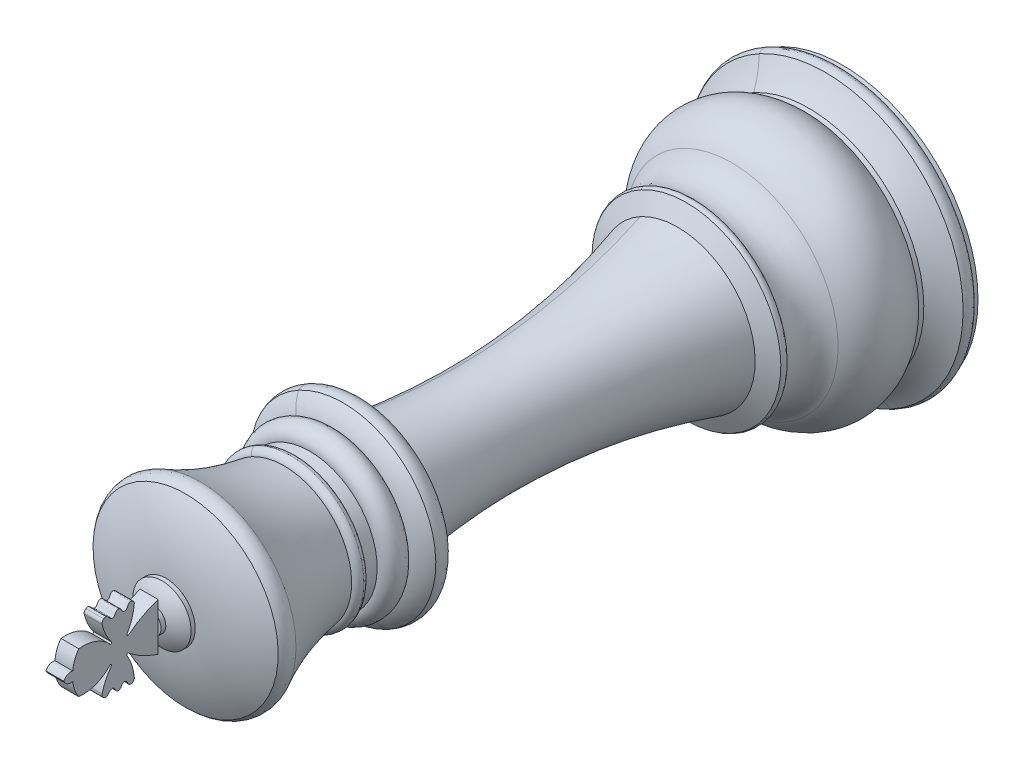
ISO-10303-21;
HEADER;
FILE_DESCRIPTION(('STEP AP214'),'2;1');
FILE_NAME('part.step','',(''),(''),'','','');
FILE_SCHEMA(('AUTOMOTIVE_DESIGN { 1 0 10303 214 1 1 1 1 }'));
ENDSEC;
DATA;
#1=APPLICATION_CONTEXT('core data for automotive mechanical design processes');
#2=APPLICATION_PROTOCOL_DEFINITION('international standard','automotive_design',2000,#1);
#3=PRODUCT_CONTEXT('',#1,'mechanical');
#4=PRODUCT('Part','Part','',(#3));
#5=PRODUCT_RELATED_PRODUCT_CATEGORY('part','',(#4));
#6=PRODUCT_DEFINITION_FORMATION('','',#4);
#7=PRODUCT_DEFINITION_CONTEXT('part definition',#1,'design');
#8=PRODUCT_DEFINITION('design','',#6,#7);
#9=PRODUCT_DEFINITION_SHAPE('','',#8);
#10=(LENGTH_UNIT() NAMED_UNIT(*) SI_UNIT(.MILLI.,.METRE.));
#11=(NAMED_UNIT(*) PLANE_ANGLE_UNIT() SI_UNIT($,.RADIAN.));
#12=(NAMED_UNIT(*) SI_UNIT($,.STERADIAN.) SOLID_ANGLE_UNIT());
#13=UNCERTAINTY_MEASURE_WITH_UNIT(LENGTH_MEASURE(1.E-05),#10,'distance_accuracy_value','');
#14=(GEOMETRIC_REPRESENTATION_CONTEXT(3) GLOBAL_UNCERTAINTY_ASSIGNED_CONTEXT((#13)) GLOBAL_UNIT_ASSIGNED_CONTEXT((#10,
#11,#12)) REPRESENTATION_CONTEXT('',''));
#15=CARTESIAN_POINT('',(0.,0.,0.));
#16=DIRECTION('',(0.,0.,1.));
#17=DIRECTION('',(1.,0.,0.));
#18=AXIS2_PLACEMENT_3D('',#15,#16,#17);
#19=CARTESIAN_POINT('',(0.,0.,1.354602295));
#20=DIRECTION('',(0.,0.,1.));
#21=DIRECTION('',(1.,0.,0.));
#22=AXIS2_PLACEMENT_3D('',#19,#20,#21);
#23=PLANE('',#22);
#24=CARTESIAN_POINT('',(0.,0.,1.35460229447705));
#25=DIRECTION('',(0.,0.,-1.));
#26=DIRECTION('',(-1.,0.,0.));
#27=AXIS2_PLACEMENT_3D('',#24,#25,#26);
#28=CIRCLE('',#27,15.1566357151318);
#29=CARTESIAN_POINT('',(-15.1566357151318,0.,1.35460229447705));
#30=VERTEX_POINT('',#29);
#31=EDGE_CURVE('E20',#30,#30,#28,.T.);
#32=ORIENTED_EDGE('',*,*,#31,.T.);
#33=EDGE_LOOP('',(#32));
#34=FACE_BOUND('',#33,.T.);
#35=ADVANCED_FACE('F17',(#34),#23,.F.);
#36=CARTESIAN_POINT('',(0.,0.,1.797175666));
#37=DIRECTION('',(0.,0.,-1.));
#38=DIRECTION('',(-1.,0.,0.));
#39=AXIS2_PLACEMENT_3D('',#36,#37,#38);
#40=CONICAL_SURFACE('',#39,15.1100276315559,0.104924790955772);
#41=CARTESIAN_POINT('',(0.,0.,1.79717566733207));
#42=DIRECTION('',(0.,0.,1.));
#43=DIRECTION('',(0.479425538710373,-0.877582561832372,0.));
#44=AXIS2_PLACEMENT_3D('',#41,#42,#43);
#45=CIRCLE('',#44,15.1100276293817);
#46=CARTESIAN_POINT('',(-7.2441331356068,13.2602967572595,1.79717566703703));
#47=VERTEX_POINT('',#46);
#48=CARTESIAN_POINT('',(7.24413313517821,-13.2602967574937,1.79717566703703));
#49=VERTEX_POINT('',#48);
#50=EDGE_CURVE('E769',#47,#49,#45,.F.);
#51=ORIENTED_EDGE('',*,*,#50,.T.);
#52=CARTESIAN_POINT('',(0.,0.,1.79717566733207));
#53=DIRECTION('',(0.,0.,1.));
#54=DIRECTION('',(-0.479425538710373,0.877582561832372,0.));
#55=AXIS2_PLACEMENT_3D('',#52,#53,#54);
#56=CIRCLE('',#55,15.1100276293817);
#57=EDGE_CURVE('E776',#49,#47,#56,.F.);
#58=ORIENTED_EDGE('',*,*,#57,.T.);
#59=EDGE_LOOP('',(#51,#58));
#60=FACE_BOUND('',#59,.T.);
#61=ORIENTED_EDGE('',*,*,#31,.F.);
#62=EDGE_LOOP('',(#61));
#63=FACE_BOUND('',#62,.T.);
#64=ADVANCED_FACE('F783',(#60,#63),#40,.T.);
#65=CARTESIAN_POINT('',(-7.2441331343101,13.260296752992,1.7971756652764));
#66=CARTESIAN_POINT('',(-7.52505918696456,13.7745284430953,2.11190860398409));
#67=CARTESIAN_POINT('',(-7.58974609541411,13.8929370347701,2.76321921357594));
#68=CARTESIAN_POINT('',(-7.39188477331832,13.5307543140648,3.28483696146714));
#69=(BOUNDED_CURVE() B_SPLINE_CURVE(3,(#65,#66,#67,#68),.UNSPECIFIED.,.F.,
.F.) B_SPLINE_CURVE_WITH_KNOTS((4,4),(0.,1.),
.UNSPECIFIED.) CURVE() GEOMETRIC_REPRESENTATION_ITEM() RATIONAL_B_SPLINE_CURVE((1.,
0.761368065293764,0.761368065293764,1.)) REPRESENTATION_ITEM(''));
#70=CARTESIAN_POINT('',(0.,0.,2.670053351));
#71=DIRECTION('',(0.,0.,1.));
#72=AXIS1_PLACEMENT('',#70,#71);
#73=SURFACE_OF_REVOLUTION('',#69,#72);
#74=CARTESIAN_POINT('',(0.,0.,3.28483696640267));
#75=DIRECTION('',(0.,0.,1.));
#76=DIRECTION('',(-0.479425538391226,0.877582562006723,0.));
#77=AXIS2_PLACEMENT_3D('',#74,#75,#76);
#78=CIRCLE('',#77,15.4182123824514);
#79=CARTESIAN_POINT('',(7.39188477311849,-13.5307543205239,3.28483696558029));
#80=VERTEX_POINT('',#79);
#81=CARTESIAN_POINT('',(-7.39188477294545,13.5307543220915,3.28483696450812));
#82=VERTEX_POINT('',#81);
#83=EDGE_CURVE('E741',#80,#82,#78,.F.);
#84=ORIENTED_EDGE('',*,*,#83,.T.);
#85=CARTESIAN_POINT('',(-7.019359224,12.84885087,2.670053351));
#86=DIRECTION('',(-0.877582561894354,-0.479425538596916,0.));
#87=DIRECTION('',(0.479425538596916,-0.877582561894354,0.));
#88=AXIS2_PLACEMENT_3D('',#85,#86,#87);
#89=CIRCLE('',#88,0.990821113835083);
#90=EDGE_CURVE('E748',#82,#47,#89,.T.);
#91=ORIENTED_EDGE('',*,*,#90,.T.);
#92=ORIENTED_EDGE('',*,*,#57,.F.);
#93=CARTESIAN_POINT('',(7.019359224,-12.84885087,2.670053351));
#94=DIRECTION('',(-0.877582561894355,-0.479425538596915,0.));
#95=DIRECTION('',(0.479425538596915,-0.877582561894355,0.));
#96=AXIS2_PLACEMENT_3D('',#93,#94,#95);
#97=CIRCLE('',#96,0.990821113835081);
#98=EDGE_CURVE('E764',#49,#80,#97,.T.);
#99=ORIENTED_EDGE('',*,*,#98,.T.);
#100=EDGE_LOOP('',(#84,#91,#92,#99));
#101=FACE_BOUND('',#100,.T.);
#102=ADVANCED_FACE('F781',(#101),#73,.T.);
#103=CARTESIAN_POINT('',(7.2441331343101,-13.260296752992,1.7971756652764));
#104=CARTESIAN_POINT('',(7.52505918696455,-13.7745284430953,2.11190860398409));
#105=CARTESIAN_POINT('',(7.58974609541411,-13.8929370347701,2.76321921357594));
#106=CARTESIAN_POINT('',(7.39188477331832,-13.5307543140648,3.28483696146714));
#107=(BOUNDED_CURVE() B_SPLINE_CURVE(3,(#103,#104,#105,#106),.UNSPECIFIED.,.F.,
.F.) B_SPLINE_CURVE_WITH_KNOTS((4,4),(0.,1.),
.UNSPECIFIED.) CURVE() GEOMETRIC_REPRESENTATION_ITEM() RATIONAL_B_SPLINE_CURVE((1.,
0.761368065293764,0.761368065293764,1.)) REPRESENTATION_ITEM(''));
#108=CARTESIAN_POINT('',(0.,0.,2.670053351));
#109=DIRECTION('',(0.,0.,1.));
#110=AXIS1_PLACEMENT('',#108,#109);
#111=SURFACE_OF_REVOLUTION('',#107,#110);
#112=CARTESIAN_POINT('',(0.,0.,3.28483696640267));
#113=DIRECTION('',(0.,0.,1.));
#114=DIRECTION('',(0.479425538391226,-0.877582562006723,0.));
#115=AXIS2_PLACEMENT_3D('',#112,#113,#114);
#116=CIRCLE('',#115,15.4182123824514);
#117=EDGE_CURVE('E747',#82,#80,#116,.F.);
#118=ORIENTED_EDGE('',*,*,#117,.T.);
#119=ORIENTED_EDGE('',*,*,#98,.F.);
#120=ORIENTED_EDGE('',*,*,#50,.F.);
#121=ORIENTED_EDGE('',*,*,#90,.F.);
#122=EDGE_LOOP('',(#118,#119,#120,#121));
#123=FACE_BOUND('',#122,.T.);
#124=ADVANCED_FACE('F730',(#123),#111,.T.);
#125=CARTESIAN_POINT('',(-6.1690136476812,11.2923037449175,5.13249146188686));
#126=CARTESIAN_POINT('',(-6.53502423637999,11.9622816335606,4.40234199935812));
#127=CARTESIAN_POINT('',(-6.94518095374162,12.7130684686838,3.78263000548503));
#128=CARTESIAN_POINT('',(-7.39188477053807,13.5307543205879,3.28483696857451));
#129=(BOUNDED_CURVE() B_SPLINE_CURVE(3,(#125,#126,#127,#128),.UNSPECIFIED.,.F.,
.F.) B_SPLINE_CURVE_WITH_KNOTS((4,4),(0.,1.),
.UNSPECIFIED.) CURVE() GEOMETRIC_REPRESENTATION_ITEM() RATIONAL_B_SPLINE_CURVE((1.,
0.993824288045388,0.993824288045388,1.)) REPRESENTATION_ITEM(''));
#130=CARTESIAN_POINT('',(0.,0.,13.51313411));
#131=DIRECTION('',(0.,0.,1.));
#132=AXIS1_PLACEMENT('',#130,#131);
#133=SURFACE_OF_REVOLUTION('',#129,#132);
#134=CARTESIAN_POINT('',(0.,0.,5.13249145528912));
#135=DIRECTION('',(0.,0.,-1.));
#136=DIRECTION('',(0.479425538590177,-0.877582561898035,0.));
#137=AXIS2_PLACEMENT_3D('',#134,#135,#136);
#138=CIRCLE('',#137,12.8675115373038);
#139=CARTESIAN_POINT('',(6.16901364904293,-11.2923037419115,5.13249145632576));
#140=VERTEX_POINT('',#139);
#141=CARTESIAN_POINT('',(-6.16901364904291,11.2923037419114,5.13249145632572));
#142=VERTEX_POINT('',#141);
#143=EDGE_CURVE('E704',#140,#142,#138,.T.);
#144=ORIENTED_EDGE('',*,*,#143,.T.);
#145=CARTESIAN_POINT('',(-10.01172508,18.3263398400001,13.5131341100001));
#146=DIRECTION('',(-0.877582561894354,-0.479425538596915,0.));
#147=DIRECTION('',(0.479425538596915,-0.877582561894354,0.));
#148=AXIS2_PLACEMENT_3D('',#145,#146,#147);
#149=CIRCLE('',#148,11.5965195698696);
#150=EDGE_CURVE('E707',#142,#82,#149,.F.);
#151=ORIENTED_EDGE('',*,*,#150,.T.);
#152=ORIENTED_EDGE('',*,*,#83,.F.);
#153=CARTESIAN_POINT('',(10.0117250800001,-18.3263398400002,13.5131341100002));
#154=DIRECTION('',(-0.877582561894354,-0.479425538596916,0.));
#155=DIRECTION('',(0.479425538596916,-0.877582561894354,0.));
#156=AXIS2_PLACEMENT_3D('',#153,#154,#155);
#157=CIRCLE('',#156,11.5965195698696);
#158=EDGE_CURVE('E753',#80,#140,#157,.F.);
#159=ORIENTED_EDGE('',*,*,#158,.T.);
#160=EDGE_LOOP('',(#144,#151,#152,#159));
#161=FACE_BOUND('',#160,.T.);
#162=ADVANCED_FACE('F725',(#161),#133,.F.);
#163=CARTESIAN_POINT('',(6.1690136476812,-11.2923037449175,5.13249146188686));
#164=CARTESIAN_POINT('',(13.2256590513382,-24.2094065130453,-8.94471288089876));
#165=CARTESIAN_POINT('',(20.4392379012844,-37.413774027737,4.7820649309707));
#166=CARTESIAN_POINT('',(14.36446461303,-26.2939761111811,20.727681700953));
#167=CARTESIAN_POINT('',(8.28969132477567,-15.1741781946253,36.6732984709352));
#168=CARTESIAN_POINT('',(0.249248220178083,-0.456245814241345,25.1169490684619));
#169=CARTESIAN_POINT('',(5.22960124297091,-9.57272087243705,7.59834647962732));
#170=(BOUNDED_CURVE() B_SPLINE_CURVE(3,(#163,#164,#165,#166,#167,#168,#169),.UNSPECIFIED.,.F.,
.F.) B_SPLINE_CURVE_WITH_KNOTS((4,3,4),(0.,0.5,1.),
.UNSPECIFIED.) CURVE() GEOMETRIC_REPRESENTATION_ITEM() RATIONAL_B_SPLINE_CURVE((1.,
0.378704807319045,0.378704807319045,1.,0.378704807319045,0.378704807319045,1.)) REPRESENTATION_ITEM(''));
#171=CARTESIAN_POINT('',(0.,0.,13.51313411));
#172=DIRECTION('',(0.,0.,1.));
#173=AXIS1_PLACEMENT('',#171,#172);
#174=SURFACE_OF_REVOLUTION('',#170,#173);
#175=CARTESIAN_POINT('',(0.,0.,5.13249145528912));
#176=DIRECTION('',(0.,0.,-1.));
#177=DIRECTION('',(-0.479425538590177,0.877582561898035,0.));
#178=AXIS2_PLACEMENT_3D('',#175,#176,#177);
#179=CIRCLE('',#178,12.8675115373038);
#180=EDGE_CURVE('E703',#142,#140,#179,.T.);
#181=ORIENTED_EDGE('',*,*,#180,.T.);
#182=ORIENTED_EDGE('',*,*,#158,.F.);
#183=ORIENTED_EDGE('',*,*,#117,.F.);
#184=ORIENTED_EDGE('',*,*,#150,.F.);
#185=EDGE_LOOP('',(#181,#182,#183,#184));
#186=FACE_BOUND('',#185,.T.);
#187=ADVANCED_FACE('F722',(#186),#174,.F.);
#188=CARTESIAN_POINT('',(0.,0.,5.591001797));
#189=DIRECTION('',(0.,0.,-1.));
#190=DIRECTION('',(-1.,0.,0.));
#191=AXIS2_PLACEMENT_3D('',#188,#189,#190);
#192=CONICAL_SURFACE('',#191,12.7502225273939,0.250434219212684);
#193=CARTESIAN_POINT('',(0.,0.,5.59100179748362));
#194=DIRECTION('',(0.,0.,1.));
#195=DIRECTION('',(0.47942553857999,-0.8775825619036,0.));
#196=AXIS2_PLACEMENT_3D('',#193,#194,#195);
#197=CIRCLE('',#196,12.7502225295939);
#198=CARTESIAN_POINT('',(6.11278230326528,-11.189372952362,5.59100179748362));
#199=VERTEX_POINT('',#198);
#200=EDGE_CURVE('E697',#199,#199,#197,.F.);
#201=ORIENTED_EDGE('',*,*,#200,.T.);
#202=EDGE_LOOP('',(#201));
#203=FACE_BOUND('',#202,.T.);
#204=ORIENTED_EDGE('',*,*,#143,.F.);
#205=ORIENTED_EDGE('',*,*,#180,.F.);
#206=EDGE_LOOP('',(#204,#205));
#207=FACE_BOUND('',#206,.T.);
#208=ADVANCED_FACE('F690',(#203,#207),#192,.T.);
#209=CARTESIAN_POINT('',(6.11278230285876,-11.1893729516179,5.5910017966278));
#210=CARTESIAN_POINT('',(7.33650937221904,-13.4293903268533,8.16723127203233));
#211=CARTESIAN_POINT('',(7.15512609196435,-13.0973704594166,11.7740313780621));
#212=CARTESIAN_POINT('',(5.7017417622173,-10.4369682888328,13.7645283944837));
#213=(BOUNDED_CURVE() B_SPLINE_CURVE(3,(#209,#210,#211,#212),.UNSPECIFIED.,.F.,
.F.) B_SPLINE_CURVE_WITH_KNOTS((4,4),(0.,1.),
.UNSPECIFIED.) CURVE() GEOMETRIC_REPRESENTATION_ITEM() RATIONAL_B_SPLINE_CURVE((1.,
0.755381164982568,0.755381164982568,1.)) REPRESENTATION_ITEM(''));
#214=CARTESIAN_POINT('',(0.,0.,9.327180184));
#215=DIRECTION('',(0.,0.,1.));
#216=AXIS1_PLACEMENT('',#214,#215);
#217=SURFACE_OF_REVOLUTION('',#213,#216);
#218=CARTESIAN_POINT('',(0.,0.,13.764528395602));
#219=DIRECTION('',(0.,0.,1.));
#220=DIRECTION('',(0.47942553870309,-0.877582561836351,0.));
#221=AXIS2_PLACEMENT_3D('',#218,#219,#220);
#222=CIRCLE('',#221,11.8928619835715);
#223=CARTESIAN_POINT('',(5.70174176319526,-10.4369682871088,13.764528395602));
#224=VERTEX_POINT('',#223);
#225=EDGE_CURVE('E668',#224,#224,#222,.F.);
#226=ORIENTED_EDGE('',*,*,#225,.T.);
#227=EDGE_LOOP('',(#226));
#228=FACE_BOUND('',#227,.T.);
#229=ORIENTED_EDGE('',*,*,#200,.F.);
#230=EDGE_LOOP('',(#229));
#231=FACE_BOUND('',#230,.T.);
#232=ADVANCED_FACE('F686',(#228,#231),#217,.T.);
#233=CARTESIAN_POINT('',(4.97733615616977,-9.11095271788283,17.99266295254));
#234=CARTESIAN_POINT('',(4.3434799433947,-7.95068670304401,14.0889790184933));
#235=CARTESIAN_POINT('',(5.90270968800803,-10.8048376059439,11.5573067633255));
#236=CARTESIAN_POINT('',(7.5614943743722,-13.8412226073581,13.7968465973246));
#237=CARTESIAN_POINT('',(9.22027906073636,-16.8776076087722,16.0363864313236));
#238=CARTESIAN_POINT('',(8.75141823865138,-16.0193636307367,20.0401753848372));
#239=CARTESIAN_POINT('',(6.78443727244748,-12.4188291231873,20.4324461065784));
#240=(BOUNDED_CURVE() B_SPLINE_CURVE(3,(#233,#234,#235,#236,#237,#238,#239),.UNSPECIFIED.,.F.,
.F.) B_SPLINE_CURVE_WITH_KNOTS((4,3,4),(0.,0.5,1.),
.UNSPECIFIED.) CURVE() GEOMETRIC_REPRESENTATION_ITEM() RATIONAL_B_SPLINE_CURVE((1.,
0.552443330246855,0.552443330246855,1.,0.552443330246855,0.552443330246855,1.)) REPRESENTATION_ITEM(''));
#241=CARTESIAN_POINT('',(0.,0.,16.8326277));
#242=DIRECTION('',(0.,0.,1.));
#243=AXIS1_PLACEMENT('',#241,#242);
#244=SURFACE_OF_REVOLUTION('',#240,#243);
#245=CARTESIAN_POINT('',(0.,0.,17.9926629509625));
#246=DIRECTION('',(0.,0.,1.));
#247=DIRECTION('',(0.479425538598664,-0.877582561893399,0.));
#248=AXIS2_PLACEMENT_3D('',#245,#246,#247);
#249=CIRCLE('',#248,10.3818752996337);
#250=CARTESIAN_POINT('',(-4.97733615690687,9.11095272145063,17.9926629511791));
#251=VERTEX_POINT('',#250);
#252=CARTESIAN_POINT('',(4.97733615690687,-9.11095272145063,17.9926629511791));
#253=VERTEX_POINT('',#252);
#254=EDGE_CURVE('E656',#251,#253,#249,.F.);
#255=ORIENTED_EDGE('',*,*,#254,.T.);
#256=CARTESIAN_POINT('',(0.,0.,17.9926629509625));
#257=DIRECTION('',(0.,0.,1.));
#258=DIRECTION('',(-0.479425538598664,0.877582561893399,0.));
#259=AXIS2_PLACEMENT_3D('',#256,#257,#258);
#260=CIRCLE('',#259,10.3818752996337);
#261=EDGE_CURVE('E662',#253,#251,#260,.F.);
#262=ORIENTED_EDGE('',*,*,#261,.T.);
#263=EDGE_LOOP('',(#255,#262));
#264=FACE_BOUND('',#263,.T.);
#265=ORIENTED_EDGE('',*,*,#225,.F.);
#266=EDGE_LOOP('',(#265));
#267=FACE_BOUND('',#266,.T.);
#268=ADVANCED_FACE('F683',(#264,#267),#244,.F.);
#269=CARTESIAN_POINT('',(-4.97733615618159,9.11095272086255,17.9926629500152));
#270=CARTESIAN_POINT('',(-5.15170699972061,9.43013640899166,18.1563099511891));
#271=CARTESIAN_POINT('',(-5.19390152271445,9.50737296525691,18.5453059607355));
#272=CARTESIAN_POINT('',(-5.07028608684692,9.28109642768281,18.8495787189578));
#273=(BOUNDED_CURVE() B_SPLINE_CURVE(3,(#269,#270,#271,#272),.UNSPECIFIED.,.F.,
.F.) B_SPLINE_CURVE_WITH_KNOTS((4,4),(0.,1.),
.UNSPECIFIED.) CURVE() GEOMETRIC_REPRESENTATION_ITEM() RATIONAL_B_SPLINE_CURVE((1.,
0.734296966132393,0.734296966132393,1.)) REPRESENTATION_ITEM(''));
#274=CARTESIAN_POINT('',(0.,0.,18.49409921));
#275=DIRECTION('',(0.,0.,1.));
#276=AXIS1_PLACEMENT('',#274,#275);
#277=SURFACE_OF_REVOLUTION('',#273,#276);
#278=CARTESIAN_POINT('',(0.,0.,18.8495787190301));
#279=DIRECTION('',(0.,0.,-1.));
#280=DIRECTION('',(0.479425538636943,-0.877582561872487,0.));
#281=AXIS2_PLACEMENT_3D('',#278,#279,#280);
#282=CIRCLE('',#281,10.5757530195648);
#283=CARTESIAN_POINT('',(5.07028608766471,-9.2810964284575,18.849578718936));
#284=VERTEX_POINT('',#283);
#285=CARTESIAN_POINT('',(-5.07028608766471,9.2810964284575,18.849578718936));
#286=VERTEX_POINT('',#285);
#287=EDGE_CURVE('E650',#284,#286,#282,.T.);
#288=ORIENTED_EDGE('',*,*,#287,.T.);
#289=CARTESIAN_POINT('',(-4.869169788,8.912955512,18.49409921));
#290=DIRECTION('',(-0.877582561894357,-0.479425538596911,0.));
#291=DIRECTION('',(0.479425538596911,-0.877582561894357,0.));
#292=AXIS2_PLACEMENT_3D('',#289,#290,#291);
#293=CIRCLE('',#292,0.549855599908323);
#294=EDGE_CURVE('E644',#286,#251,#293,.T.);
#295=ORIENTED_EDGE('',*,*,#294,.T.);
#296=ORIENTED_EDGE('',*,*,#261,.F.);
#297=CARTESIAN_POINT('',(4.869169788,-8.912955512,18.49409921));
#298=DIRECTION('',(-0.877582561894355,-0.479425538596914,0.));
#299=DIRECTION('',(0.479425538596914,-0.877582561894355,0.));
#300=AXIS2_PLACEMENT_3D('',#297,#298,#299);
#301=CIRCLE('',#300,0.549855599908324);
#302=EDGE_CURVE('E651',#253,#284,#301,.T.);
#303=ORIENTED_EDGE('',*,*,#302,.T.);
#304=EDGE_LOOP('',(#288,#295,#296,#303));
#305=FACE_BOUND('',#304,.T.);
#306=ADVANCED_FACE('F633',(#305),#277,.T.);
#307=CARTESIAN_POINT('',(4.9773361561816,-9.11095272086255,17.9926629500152));
#308=CARTESIAN_POINT('',(5.15170699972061,-9.43013640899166,18.1563099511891));
#309=CARTESIAN_POINT('',(5.19390152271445,-9.50737296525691,18.5453059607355));
#310=CARTESIAN_POINT('',(5.07028608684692,-9.28109642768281,18.8495787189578));
#311=(BOUNDED_CURVE() B_SPLINE_CURVE(3,(#307,#308,#309,#310),.UNSPECIFIED.,.F.,
.F.) B_SPLINE_CURVE_WITH_KNOTS((4,4),(0.,1.),
.UNSPECIFIED.) CURVE() GEOMETRIC_REPRESENTATION_ITEM() RATIONAL_B_SPLINE_CURVE((1.,
0.734296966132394,0.734296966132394,1.)) REPRESENTATION_ITEM(''));
#312=CARTESIAN_POINT('',(0.,0.,18.49409921));
#313=DIRECTION('',(0.,0.,1.));
#314=AXIS1_PLACEMENT('',#312,#313);
#315=SURFACE_OF_REVOLUTION('',#311,#314);
#316=CARTESIAN_POINT('',(0.,0.,18.8495787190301));
#317=DIRECTION('',(0.,0.,-1.));
#318=DIRECTION('',(-0.479425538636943,0.877582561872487,0.));
#319=AXIS2_PLACEMENT_3D('',#316,#317,#318);
#320=CIRCLE('',#319,10.5757530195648);
#321=EDGE_CURVE('E1514',#286,#284,#320,.T.);
#322=ORIENTED_EDGE('',*,*,#321,.T.);
#323=ORIENTED_EDGE('',*,*,#302,.F.);
#324=ORIENTED_EDGE('',*,*,#254,.F.);
#325=ORIENTED_EDGE('',*,*,#294,.F.);
#326=EDGE_LOOP('',(#322,#323,#324,#325));
#327=FACE_BOUND('',#326,.T.);
#328=ADVANCED_FACE('F628',(#327),#315,.T.);
#329=CARTESIAN_POINT('',(0.,0.,19.83197376));
#330=DIRECTION('',(0.,0.,-1.));
#331=DIRECTION('',(-1.,0.,0.));
#332=AXIS2_PLACEMENT_3D('',#329,#330,#331);
#333=CONICAL_SURFACE('',#332,8.68253356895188,1.09214185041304);
#334=CARTESIAN_POINT('',(0.,0.,19.8319737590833));
#335=DIRECTION('',(0.,0.,1.));
#336=DIRECTION('',(0.479425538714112,-0.877582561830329,0.));
#337=AXIS2_PLACEMENT_3D('',#334,#335,#336);
#338=CIRCLE('',#337,8.68253356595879);
#339=CARTESIAN_POINT('',(-4.16262833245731,7.61964005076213,19.8319737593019));
#340=VERTEX_POINT('',#339);
#341=CARTESIAN_POINT('',(4.16262833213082,-7.61964005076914,19.8319737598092));
#342=VERTEX_POINT('',#341);
#343=EDGE_CURVE('E609',#340,#342,#338,.F.);
#344=ORIENTED_EDGE('',*,*,#343,.T.);
#345=CARTESIAN_POINT('',(0.,0.,19.8319737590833));
#346=DIRECTION('',(0.,0.,1.));
#347=DIRECTION('',(-0.479425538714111,0.87758256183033,0.));
#348=AXIS2_PLACEMENT_3D('',#345,#346,#347);
#349=CIRCLE('',#348,8.6825335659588);
#350=EDGE_CURVE('E616',#342,#340,#349,.F.);
#351=ORIENTED_EDGE('',*,*,#350,.T.);
#352=EDGE_LOOP('',(#344,#351));
#353=FACE_BOUND('',#352,.T.);
#354=ORIENTED_EDGE('',*,*,#287,.F.);
#355=ORIENTED_EDGE('',*,*,#321,.F.);
#356=EDGE_LOOP('',(#354,#355));
#357=FACE_BOUND('',#356,.T.);
#358=ADVANCED_FACE('F624',(#353,#357),#333,.T.);
#359=CARTESIAN_POINT('',(-3.2434529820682,5.93710085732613,55.611800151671));
#360=CARTESIAN_POINT('',(-2.19524521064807,4.01836940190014,43.6446885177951));
#361=CARTESIAN_POINT('',(-2.50731857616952,4.58961586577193,31.4969184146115));
#362=CARTESIAN_POINT('',(-4.16262833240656,7.61964005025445,19.8319737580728));
#363=(BOUNDED_CURVE() B_SPLINE_CURVE(3,(#359,#360,#361,#362),.UNSPECIFIED.,.F.,
.F.) B_SPLINE_CURVE_WITH_KNOTS((4,4),(0.,1.),
.UNSPECIFIED.) CURVE() GEOMETRIC_REPRESENTATION_ITEM() RATIONAL_B_SPLINE_CURVE((1.,
0.981794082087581,0.981794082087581,1.)) REPRESENTATION_ITEM(''));
#364=CARTESIAN_POINT('',(0.,0.,41.73924645));
#365=DIRECTION('',(0.,0.,1.));
#366=AXIS1_PLACEMENT('',#364,#365);
#367=SURFACE_OF_REVOLUTION('',#363,#366);
#368=CARTESIAN_POINT('',(0.,0.,55.6118001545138));
#369=DIRECTION('',(0.,0.,1.));
#370=DIRECTION('',(-0.479425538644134,0.877582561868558,0.));
#371=AXIS2_PLACEMENT_3D('',#368,#369,#370);
#372=CIRCLE('',#371,6.76529037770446);
#373=CARTESIAN_POINT('',(3.24345298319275,-5.93710086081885,55.6118001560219));
#374=VERTEX_POINT('',#373);
#375=CARTESIAN_POINT('',(-3.24345298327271,5.93710086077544,55.6118001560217));
#376=VERTEX_POINT('',#375);
#377=EDGE_CURVE('E581',#374,#376,#372,.F.);
#378=ORIENTED_EDGE('',*,*,#377,.T.);
#379=CARTESIAN_POINT('',(-39.6467493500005,72.572887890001,41.7392464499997));
#380=DIRECTION('',(-0.877582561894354,-0.479425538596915,0.));
#381=DIRECTION('',(0.479425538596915,-0.877582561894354,0.));
#382=AXIS2_PLACEMENT_3D('',#379,#380,#381);
#383=CIRCLE('',#382,77.1879255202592);
#384=EDGE_CURVE('E588',#376,#340,#383,.F.);
#385=ORIENTED_EDGE('',*,*,#384,.T.);
#386=ORIENTED_EDGE('',*,*,#350,.F.);
#387=CARTESIAN_POINT('',(39.6467493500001,-72.5728878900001,41.73924645));
#388=DIRECTION('',(-0.877582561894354,-0.479425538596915,0.));
#389=DIRECTION('',(0.479425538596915,-0.877582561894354,0.));
#390=AXIS2_PLACEMENT_3D('',#387,#388,#389);
#391=CIRCLE('',#390,77.1879255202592);
#392=EDGE_CURVE('E604',#342,#374,#391,.F.);
#393=ORIENTED_EDGE('',*,*,#392,.T.);
#394=EDGE_LOOP('',(#378,#385,#386,#393));
#395=FACE_BOUND('',#394,.T.);
#396=ADVANCED_FACE('F621',(#395),#367,.F.);
#397=CARTESIAN_POINT('',(3.2434529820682,-5.93710085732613,55.611800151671));
#398=CARTESIAN_POINT('',(-7.46461213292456,13.6638808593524,-66.6393547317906));
#399=CARTESIAN_POINT('',(49.4929317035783,-90.5962037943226,-103.10686028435));
#400=CARTESIAN_POINT('',(73.5122262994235,-134.563227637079,10.6216775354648));
#401=CARTESIAN_POINT('',(97.5315208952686,-178.530251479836,124.35021535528));
#402=CARTESIAN_POINT('',(46.1873922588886,-84.5454544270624,187.396582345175));
#403=CARTESIAN_POINT('',(10.1687480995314,-18.613768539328,88.4022588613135));
#404=(BOUNDED_CURVE() B_SPLINE_CURVE(3,(#397,#398,#399,#400,#401,#402,#403),.UNSPECIFIED.,.F.,
.F.) B_SPLINE_CURVE_WITH_KNOTS((4,3,4),(0.,0.5,1.),
.UNSPECIFIED.) CURVE() GEOMETRIC_REPRESENTATION_ITEM() RATIONAL_B_SPLINE_CURVE((1.,
0.411234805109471,0.411234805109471,1.,0.411234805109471,0.411234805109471,1.)) REPRESENTATION_ITEM(''));
#405=CARTESIAN_POINT('',(0.,0.,41.73924645));
#406=DIRECTION('',(0.,0.,1.));
#407=AXIS1_PLACEMENT('',#405,#406);
#408=SURFACE_OF_REVOLUTION('',#404,#407);
#409=CARTESIAN_POINT('',(0.,0.,55.6118001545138));
#410=DIRECTION('',(0.,0.,1.));
#411=DIRECTION('',(0.479425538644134,-0.877582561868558,0.));
#412=AXIS2_PLACEMENT_3D('',#409,#410,#411);
#413=CIRCLE('',#412,6.76529037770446);
#414=EDGE_CURVE('E587',#376,#374,#413,.F.);
#415=ORIENTED_EDGE('',*,*,#414,.T.);
#416=ORIENTED_EDGE('',*,*,#392,.F.);
#417=ORIENTED_EDGE('',*,*,#343,.F.);
#418=ORIENTED_EDGE('',*,*,#384,.F.);
#419=EDGE_LOOP('',(#415,#416,#417,#418));
#420=FACE_BOUND('',#419,.T.);
#421=ADVANCED_FACE('F570',(#420),#408,.F.);
#422=CARTESIAN_POINT('',(-3.24345298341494,5.93710086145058,55.6118001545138));
#423=CARTESIAN_POINT('',(-16.9103763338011,30.9542362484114,52.1415501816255));
#424=CARTESIAN_POINT('',(-19.2789990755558,35.2899710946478,80.4306915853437));
#425=CARTESIAN_POINT('',(-5.85718013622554,10.7214963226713,86.828293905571));
#426=CARTESIAN_POINT('',(7.56463880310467,-13.8469784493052,93.2258962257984));
#427=CARTESIAN_POINT('',(11.322147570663,-20.7250521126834,65.5987768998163));
#428=CARTESIAN_POINT('',(-1.71084542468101,3.13168154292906,56.3423280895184));
#429=(BOUNDED_CURVE() B_SPLINE_CURVE(3,(#422,#423,#424,#425,#426,#427,#428),.UNSPECIFIED.,.F.,
.F.) B_SPLINE_CURVE_WITH_KNOTS((4,3,4),(0.,0.5,1.),
.UNSPECIFIED.) CURVE() GEOMETRIC_REPRESENTATION_ITEM() RATIONAL_B_SPLINE_CURVE((1.,
0.367826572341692,0.367826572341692,1.,0.367826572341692,0.367826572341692,1.)) REPRESENTATION_ITEM(''));
#430=CARTESIAN_POINT('',(0.,0.,71.3612736));
#431=DIRECTION('',(0.,0.,1.));
#432=AXIS1_PLACEMENT('',#430,#431);
#433=SURFACE_OF_REVOLUTION('',#429,#432);
#434=CARTESIAN_POINT('',(0.,0.,55.5540510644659));
#435=DIRECTION('',(0.,0.,1.));
#436=DIRECTION('',(-0.479425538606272,0.877582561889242,0.));
#437=AXIS2_PLACEMENT_3D('',#434,#435,#436);
#438=CIRCLE('',#437,10.04394857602);
#439=CARTESIAN_POINT('',(4.8153254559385,-8.8143941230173,55.5540510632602));
#440=VERTEX_POINT('',#439);
#441=CARTESIAN_POINT('',(-4.81532545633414,8.8143941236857,55.5540510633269));
#442=VERTEX_POINT('',#441);
#443=EDGE_CURVE('E541',#440,#442,#438,.F.);
#444=ORIENTED_EDGE('',*,*,#443,.T.);
#445=CARTESIAN_POINT('',(-4.16262833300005,7.6196400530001,71.3612736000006));
#446=DIRECTION('',(-0.877582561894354,-0.479425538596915,0.));
#447=DIRECTION('',(0.479425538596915,-0.877582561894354,0.));
#448=AXIS2_PLACEMENT_3D('',#445,#446,#447);
#449=CIRCLE('',#448,15.8657409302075);
#450=EDGE_CURVE('E547',#442,#376,#449,.T.);
#451=ORIENTED_EDGE('',*,*,#450,.T.);
#452=ORIENTED_EDGE('',*,*,#377,.F.);
#453=CARTESIAN_POINT('',(4.1626283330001,-7.61964005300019,71.3612736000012));
#454=DIRECTION('',(-0.877582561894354,-0.479425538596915,0.));
#455=DIRECTION('',(0.479425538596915,-0.877582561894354,0.));
#456=AXIS2_PLACEMENT_3D('',#453,#454,#455);
#457=CIRCLE('',#456,15.8657409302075);
#458=EDGE_CURVE('E593',#374,#440,#457,.T.);
#459=ORIENTED_EDGE('',*,*,#458,.T.);
#460=EDGE_LOOP('',(#444,#451,#452,#459));
#461=FACE_BOUND('',#460,.T.);
#462=ADVANCED_FACE('F565',(#461),#433,.T.);
#463=CARTESIAN_POINT('',(3.24345298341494,-5.93710086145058,55.6118001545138));
#464=CARTESIAN_POINT('',(16.9103763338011,-30.9542362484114,52.1415501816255));
#465=CARTESIAN_POINT('',(19.2789990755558,-35.2899710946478,80.4306915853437));
#466=CARTESIAN_POINT('',(5.85718013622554,-10.7214963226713,86.828293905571));
#467=CARTESIAN_POINT('',(-7.56463880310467,13.8469784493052,93.2258962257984));
#468=CARTESIAN_POINT('',(-11.322147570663,20.7250521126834,65.5987768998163));
#469=CARTESIAN_POINT('',(1.71084542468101,-3.13168154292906,56.3423280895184));
#470=(BOUNDED_CURVE() B_SPLINE_CURVE(3,(#463,#464,#465,#466,#467,#468,#469),.UNSPECIFIED.,.F.,
.F.) B_SPLINE_CURVE_WITH_KNOTS((4,3,4),(0.,0.5,1.),
.UNSPECIFIED.) CURVE() GEOMETRIC_REPRESENTATION_ITEM() RATIONAL_B_SPLINE_CURVE((1.,
0.367826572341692,0.367826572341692,1.,0.367826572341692,0.367826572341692,1.)) REPRESENTATION_ITEM(''));
#471=CARTESIAN_POINT('',(0.,0.,71.3612736));
#472=DIRECTION('',(0.,0.,1.));
#473=AXIS1_PLACEMENT('',#471,#472);
#474=SURFACE_OF_REVOLUTION('',#470,#473);
#475=CARTESIAN_POINT('',(0.,0.,55.5540510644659));
#476=DIRECTION('',(0.,0.,1.));
#477=DIRECTION('',(0.479425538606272,-0.877582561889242,0.));
#478=AXIS2_PLACEMENT_3D('',#475,#476,#477);
#479=CIRCLE('',#478,10.04394857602);
#480=EDGE_CURVE('E535',#442,#440,#479,.F.);
#481=ORIENTED_EDGE('',*,*,#480,.T.);
#482=ORIENTED_EDGE('',*,*,#458,.F.);
#483=ORIENTED_EDGE('',*,*,#414,.F.);
#484=ORIENTED_EDGE('',*,*,#450,.F.);
#485=EDGE_LOOP('',(#481,#482,#483,#484));
#486=FACE_BOUND('',#485,.T.);
#487=ADVANCED_FACE('F562',(#486),#474,.T.);
#488=CARTESIAN_POINT('',(-4.8153254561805,8.81439412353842,55.5540510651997));
#489=CARTESIAN_POINT('',(-5.0572730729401,9.25727626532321,56.0111078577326));
#490=CARTESIAN_POINT('',(-5.12005005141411,9.37218875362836,56.6792682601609));
#491=CARTESIAN_POINT('',(-4.97870846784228,9.11346472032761,57.2930015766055));
#492=(BOUNDED_CURVE() B_SPLINE_CURVE(3,(#488,#489,#490,#491),.UNSPECIFIED.,.F.,
.F.) B_SPLINE_CURVE_WITH_KNOTS((4,4),(0.,1.),
.UNSPECIFIED.) CURVE() GEOMETRIC_REPRESENTATION_ITEM() RATIONAL_B_SPLINE_CURVE((1.,
0.867531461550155,0.867531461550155,1.)) REPRESENTATION_ITEM(''));
#493=CARTESIAN_POINT('',(0.,0.,56.65174683));
#494=DIRECTION('',(0.,0.,1.));
#495=AXIS1_PLACEMENT('',#493,#494);
#496=SURFACE_OF_REVOLUTION('',#492,#495);
#497=CARTESIAN_POINT('',(0.,0.,57.2930015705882));
#498=DIRECTION('',(0.,0.,1.));
#499=DIRECTION('',(-0.479425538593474,0.877582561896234,0.));
#500=AXIS2_PLACEMENT_3D('',#497,#498,#499);
#501=CIRCLE('',#500,10.3847377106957);
#502=CARTESIAN_POINT('',(4.97870846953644,-9.11346472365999,57.2930015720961));
#503=VERTEX_POINT('',#502);
#504=CARTESIAN_POINT('',(-4.97870846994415,9.1134647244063,57.2930015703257));
#505=VERTEX_POINT('',#504);
#506=EDGE_CURVE('E500',#503,#505,#501,.F.);
#507=ORIENTED_EDGE('',*,*,#506,.T.);
#508=CARTESIAN_POINT('',(-4.33870449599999,7.94194530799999,56.65174683));
#509=DIRECTION('',(-0.877582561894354,-0.479425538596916,0.));
#510=DIRECTION('',(0.479425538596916,-0.877582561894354,0.));
#511=AXIS2_PLACEMENT_3D('',#508,#509,#510);
#512=CIRCLE('',#511,1.48096943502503);
#513=EDGE_CURVE('E524',#505,#442,#512,.T.);
#514=ORIENTED_EDGE('',*,*,#513,.T.);
#515=ORIENTED_EDGE('',*,*,#443,.F.);
#516=CARTESIAN_POINT('',(4.33870449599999,-7.94194530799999,56.65174683));
#517=DIRECTION('',(-0.877582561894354,-0.479425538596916,0.));
#518=DIRECTION('',(0.479425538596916,-0.877582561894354,0.));
#519=AXIS2_PLACEMENT_3D('',#516,#517,#518);
#520=CIRCLE('',#519,1.48096943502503);
#521=EDGE_CURVE('E530',#440,#503,#520,.T.);
#522=ORIENTED_EDGE('',*,*,#521,.T.);
#523=EDGE_LOOP('',(#507,#514,#515,#522));
#524=FACE_BOUND('',#523,.T.);
#525=ADVANCED_FACE('F513',(#524),#496,.T.);
#526=CARTESIAN_POINT('',(4.8153254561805,-8.81439412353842,55.5540510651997));
#527=CARTESIAN_POINT('',(5.42798099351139,-9.9358525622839,56.7114023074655));
#528=CARTESIAN_POINT('',(5.09451076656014,-9.32543940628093,58.2889545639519));
#529=CARTESIAN_POINT('',(4.27163521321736,-7.81917580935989,58.1260940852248));
#530=CARTESIAN_POINT('',(3.44875965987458,-6.31291221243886,57.9632336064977));
#531=CARTESIAN_POINT('',(3.26348818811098,-5.9737750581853,56.2830139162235));
#532=CARTESIAN_POINT('',(3.9695683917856,-7.26624620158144,55.3866619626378));
#533=(BOUNDED_CURVE() B_SPLINE_CURVE(3,(#526,#527,#528,#529,#530,#531,#532),.UNSPECIFIED.,.F.,
.F.) B_SPLINE_CURVE_WITH_KNOTS((4,3,4),(0.,0.5,1.),
.UNSPECIFIED.) CURVE() GEOMETRIC_REPRESENTATION_ITEM() RATIONAL_B_SPLINE_CURVE((1.,
0.54346705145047,0.54346705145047,1.,0.54346705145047,0.54346705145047,1.)) REPRESENTATION_ITEM(''));
#534=CARTESIAN_POINT('',(0.,0.,56.65174683));
#535=DIRECTION('',(0.,0.,1.));
#536=AXIS1_PLACEMENT('',#534,#535);
#537=SURFACE_OF_REVOLUTION('',#533,#536);
#538=CARTESIAN_POINT('',(0.,0.,57.2930015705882));
#539=DIRECTION('',(0.,0.,1.));
#540=DIRECTION('',(0.479425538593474,-0.877582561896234,0.));
#541=AXIS2_PLACEMENT_3D('',#538,#539,#540);
#542=CIRCLE('',#541,10.3847377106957);
#543=EDGE_CURVE('E493',#505,#503,#542,.F.);
#544=ORIENTED_EDGE('',*,*,#543,.T.);
#545=ORIENTED_EDGE('',*,*,#521,.F.);
#546=ORIENTED_EDGE('',*,*,#480,.F.);
#547=ORIENTED_EDGE('',*,*,#513,.F.);
#548=EDGE_LOOP('',(#544,#545,#546,#547));
#549=FACE_BOUND('',#548,.T.);
#550=ADVANCED_FACE('F508',(#549),#537,.T.);
#551=CARTESIAN_POINT('',(-4.97870846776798,9.11346472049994,57.2930015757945));
#552=CARTESIAN_POINT('',(-2.8596221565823,5.23450324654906,62.0193192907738));
#553=CARTESIAN_POINT('',(-0.329544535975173,0.603227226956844,58.2743309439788));
#554=CARTESIAN_POINT('',(-1.76878810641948,3.23774491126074,52.5417187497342));
#555=CARTESIAN_POINT('',(-3.2080316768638,5.87226259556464,46.8091065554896));
#556=CARTESIAN_POINT('',(-6.12484023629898,11.2114448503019,49.0137173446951));
#557=CARTESIAN_POINT('',(-5.4693556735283,10.0115884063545,55.338717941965));
#558=(BOUNDED_CURVE() B_SPLINE_CURVE(3,(#551,#552,#553,#554,#555,#556,#557),.UNSPECIFIED.,.F.,
.F.) B_SPLINE_CURVE_WITH_KNOTS((4,3,4),(0.,0.5,1.),
.UNSPECIFIED.) CURVE() GEOMETRIC_REPRESENTATION_ITEM() RATIONAL_B_SPLINE_CURVE((1.,
0.422901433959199,0.422901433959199,1.,0.422901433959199,0.422901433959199,1.)) REPRESENTATION_ITEM(''));
#559=CARTESIAN_POINT('',(0.,0.,54.46347797));
#560=DIRECTION('',(0.,0.,1.));
#561=AXIS1_PLACEMENT('',#559,#560);
#562=SURFACE_OF_REVOLUTION('',#558,#561);
#563=CARTESIAN_POINT('',(0.,0.,58.4448468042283));
#564=DIRECTION('',(0.,0.,1.));
#565=DIRECTION('',(-0.479425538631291,0.877582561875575,0.));
#566=AXIS2_PLACEMENT_3D('',#563,#564,#565);
#567=CIRCLE('',#566,8.50329200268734);
#568=CARTESIAN_POINT('',(4.07669534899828,-7.46234078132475,58.4448468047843));
#569=VERTEX_POINT('',#568);
#570=CARTESIAN_POINT('',(-4.07669534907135,7.46234078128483,58.4448468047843));
#571=VERTEX_POINT('',#570);
#572=EDGE_CURVE('E466',#569,#571,#567,.F.);
#573=ORIENTED_EDGE('',*,*,#572,.T.);
#574=CARTESIAN_POINT('',(-3.52816777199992,6.45826778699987,54.4634779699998));
#575=DIRECTION('',(-0.877582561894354,-0.479425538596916,0.));
#576=DIRECTION('',(0.479425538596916,-0.877582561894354,0.));
#577=AXIS2_PLACEMENT_3D('',#574,#575,#576);
#578=CIRCLE('',#577,4.14250442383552);
#579=EDGE_CURVE('E473',#571,#505,#578,.T.);
#580=ORIENTED_EDGE('',*,*,#579,.T.);
#581=ORIENTED_EDGE('',*,*,#506,.F.);
#582=CARTESIAN_POINT('',(3.52816777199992,-6.45826778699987,54.4634779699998));
#583=DIRECTION('',(-0.877582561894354,-0.479425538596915,0.));
#584=DIRECTION('',(0.479425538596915,-0.877582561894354,0.));
#585=AXIS2_PLACEMENT_3D('',#582,#583,#584);
#586=CIRCLE('',#585,4.14250442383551);
#587=EDGE_CURVE('E488',#503,#569,#586,.T.);
#588=ORIENTED_EDGE('',*,*,#587,.T.);
#589=EDGE_LOOP('',(#573,#580,#581,#588));
#590=FACE_BOUND('',#589,.T.);
#591=ADVANCED_FACE('F505',(#590),#562,.T.);
#592=CARTESIAN_POINT('',(4.97870846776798,-9.11346472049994,57.2930015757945));
#593=CARTESIAN_POINT('',(4.73196675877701,-8.66180705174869,57.843323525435));
#594=CARTESIAN_POINT('',(4.4238809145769,-8.09785969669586,58.236740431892));
#595=CARTESIAN_POINT('',(4.07669534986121,-7.46234078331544,58.4448468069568));
#596=(BOUNDED_CURVE() B_SPLINE_CURVE(3,(#592,#593,#594,#595),.UNSPECIFIED.,.F.,
.F.) B_SPLINE_CURVE_WITH_KNOTS((4,4),(0.,1.),
.UNSPECIFIED.) CURVE() GEOMETRIC_REPRESENTATION_ITEM() RATIONAL_B_SPLINE_CURVE((1.,
0.975932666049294,0.975932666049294,1.)) REPRESENTATION_ITEM(''));
#597=CARTESIAN_POINT('',(0.,0.,54.46347797));
#598=DIRECTION('',(0.,0.,1.));
#599=AXIS1_PLACEMENT('',#597,#598);
#600=SURFACE_OF_REVOLUTION('',#596,#599);
#601=CARTESIAN_POINT('',(0.,0.,58.4448468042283));
#602=DIRECTION('',(0.,0.,1.));
#603=DIRECTION('',(0.479425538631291,-0.877582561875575,0.));
#604=AXIS2_PLACEMENT_3D('',#601,#602,#603);
#605=CIRCLE('',#604,8.50329200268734);
#606=EDGE_CURVE('E472',#571,#569,#605,.F.);
#607=ORIENTED_EDGE('',*,*,#606,.T.);
#608=ORIENTED_EDGE('',*,*,#587,.F.);
#609=ORIENTED_EDGE('',*,*,#543,.F.);
#610=ORIENTED_EDGE('',*,*,#579,.F.);
#611=EDGE_LOOP('',(#607,#608,#609,#610));
#612=FACE_BOUND('',#611,.T.);
#613=ADVANCED_FACE('F457',(#612),#600,.T.);
#614=CARTESIAN_POINT('',(4.07669535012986,-7.46234078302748,58.44484680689));
#615=CARTESIAN_POINT('',(4.48391100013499,-8.20774403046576,59.1212858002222));
#616=CARTESIAN_POINT('',(4.45897343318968,-8.16209612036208,60.2058662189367));
#617=CARTESIAN_POINT('',(4.02259163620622,-7.36330459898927,60.7979163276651));
#618=CARTESIAN_POINT('',(3.58620983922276,-6.56451307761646,61.3899664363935));
#619=CARTESIAN_POINT('',(3.10076980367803,-5.67592105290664,60.9978280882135));
#620=CARTESIAN_POINT('',(2.96939711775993,-5.43544496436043,59.947146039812));
#621=(BOUNDED_CURVE() B_SPLINE_CURVE(3,(#614,#615,#616,#617,#618,#619,#620),.UNSPECIFIED.,.F.,
.F.) B_SPLINE_CURVE_WITH_KNOTS((4,3,4),(0.,0.5,1.),
.UNSPECIFIED.) CURVE() GEOMETRIC_REPRESENTATION_ITEM() RATIONAL_B_SPLINE_CURVE((1.,
0.723188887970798,0.723188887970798,1.,0.723188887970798,0.723188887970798,1.)) REPRESENTATION_ITEM(''));
#622=CARTESIAN_POINT('',(0.,0.,59.5807046));
#623=DIRECTION('',(0.,0.,1.));
#624=AXIS1_PLACEMENT('',#622,#623);
#625=SURFACE_OF_REVOLUTION('',#621,#624);
#626=CARTESIAN_POINT('',(0.,0.,61.0321264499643));
#627=DIRECTION('',(0.,0.,-1.));
#628=DIRECTION('',(-0.479425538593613,0.877582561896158,0.));
#629=AXIS2_PLACEMENT_3D('',#626,#627,#628);
#630=CIRCLE('',#629,7.5560311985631);
#631=CARTESIAN_POINT('',(-3.62255432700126,6.63104121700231,61.0321264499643));
#632=VERTEX_POINT('',#631);
#633=EDGE_CURVE('E465',#632,#632,#630,.T.);
#634=ORIENTED_EDGE('',*,*,#633,.T.);
#635=EDGE_LOOP('',(#634));
#636=FACE_BOUND('',#635,.T.);
#637=ORIENTED_EDGE('',*,*,#572,.F.);
#638=ORIENTED_EDGE('',*,*,#606,.F.);
#639=EDGE_LOOP('',(#637,#638));
#640=FACE_BOUND('',#639,.T.);
#641=ADVANCED_FACE('F452',(#636,#640),#625,.T.);
#642=CARTESIAN_POINT('',(0.,0.,62.54855878));
#643=DIRECTION('',(0.,0.,-1.));
#644=DIRECTION('',(-1.,0.,0.));
#645=AXIS2_PLACEMENT_3D('',#642,#643,#644);
#646=CONICAL_SURFACE('',#645,7.44450961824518,0.073409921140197);
#647=CARTESIAN_POINT('',(0.,0.,62.5485587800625));
#648=DIRECTION('',(0.,0.,1.));
#649=DIRECTION('',(0.479425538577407,-0.877582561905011,0.));
#650=AXIS2_PLACEMENT_3D('',#647,#648,#649);
#651=CIRCLE('',#650,7.44450961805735);
#652=CARTESIAN_POINT('',(3.56908803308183,-6.53317182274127,62.5485587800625));
#653=VERTEX_POINT('',#652);
#654=EDGE_CURVE('E430',#653,#653,#651,.F.);
#655=ORIENTED_EDGE('',*,*,#654,.T.);
#656=EDGE_LOOP('',(#655));
#657=FACE_BOUND('',#656,.T.);
#658=ORIENTED_EDGE('',*,*,#633,.F.);
#659=EDGE_LOOP('',(#658));
#660=FACE_BOUND('',#659,.T.);
#661=ADVANCED_FACE('F448',(#657,#660),#646,.T.);
#662=CARTESIAN_POINT('',(3.56908803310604,-6.53317182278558,62.5485587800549));
#663=CARTESIAN_POINT('',(3.88665080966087,-7.11446658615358,62.4483792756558));
#664=CARTESIAN_POINT('',(4.06046213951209,-7.43262609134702,63.0117173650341));
#665=CARTESIAN_POINT('',(3.8851949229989,-7.11180160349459,63.5730895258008));
#666=CARTESIAN_POINT('',(3.70992770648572,-6.79097711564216,64.1344616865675));
#667=CARTESIAN_POINT('',(3.39262891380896,-6.21016557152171,64.0307067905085));
#668=CARTESIAN_POINT('',(3.3081305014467,-6.05549226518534,63.3843927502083));
#669=(BOUNDED_CURVE() B_SPLINE_CURVE(3,(#662,#663,#664,#665,#666,#667,#668),.UNSPECIFIED.,.F.,
.F.) B_SPLINE_CURVE_WITH_KNOTS((4,3,4),(0.,0.5,1.),
.UNSPECIFIED.) CURVE() GEOMETRIC_REPRESENTATION_ITEM() RATIONAL_B_SPLINE_CURVE((1.,
0.60622609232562,0.60622609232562,1.,0.60622609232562,0.60622609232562,1.)) REPRESENTATION_ITEM(''));
#670=CARTESIAN_POINT('',(0.,0.,63.20873132));
#671=DIRECTION('',(0.,0.,1.));
#672=AXIS1_PLACEMENT('',#670,#671);
#673=SURFACE_OF_REVOLUTION('',#669,#672);
#674=CARTESIAN_POINT('',(0.,0.,63.1860468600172));
#675=DIRECTION('',(0.,0.,1.));
#676=DIRECTION('',(0.479425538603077,-0.877582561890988,0.));
#677=AXIS2_PLACEMENT_3D('',#674,#675,#676);
#678=CIRCLE('',#677,8.21164974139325);
#679=CARTESIAN_POINT('',(-3.9368746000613,7.20640061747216,63.1860468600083));
#680=VERTEX_POINT('',#679);
#681=CARTESIAN_POINT('',(3.93687460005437,-7.20640061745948,63.1860468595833));
#682=VERTEX_POINT('',#681);
#683=EDGE_CURVE('E418',#680,#682,#678,.F.);
#684=ORIENTED_EDGE('',*,*,#683,.T.);
#685=CARTESIAN_POINT('',(0.,0.,63.1860468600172));
#686=DIRECTION('',(0.,0.,1.));
#687=DIRECTION('',(-0.479425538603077,0.877582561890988,0.));
#688=AXIS2_PLACEMENT_3D('',#685,#686,#687);
#689=CIRCLE('',#688,8.21164974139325);
#690=EDGE_CURVE('E424',#682,#680,#689,.F.);
#691=ORIENTED_EDGE('',*,*,#690,.T.);
#692=EDGE_LOOP('',(#684,#691));
#693=FACE_BOUND('',#692,.T.);
#694=ORIENTED_EDGE('',*,*,#654,.F.);
#695=EDGE_LOOP('',(#694));
#696=FACE_BOUND('',#695,.T.);
#697=ADVANCED_FACE('F445',(#693,#696),#673,.T.);
#698=CARTESIAN_POINT('',(-3.93687460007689,7.20640061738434,63.1860468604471));
#699=CARTESIAN_POINT('',(-3.92777775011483,7.1897489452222,63.5626385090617));
#700=CARTESIAN_POINT('',(-3.80722879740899,6.96908556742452,63.8436312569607));
#701=CARTESIAN_POINT('',(-3.62879641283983,6.64246727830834,63.9041595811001));
#702=(BOUNDED_CURVE() B_SPLINE_CURVE(3,(#698,#699,#700,#701),.UNSPECIFIED.,.F.,
.F.) B_SPLINE_CURVE_WITH_KNOTS((4,4),(0.,1.),
.UNSPECIFIED.) CURVE() GEOMETRIC_REPRESENTATION_ITEM() RATIONAL_B_SPLINE_CURVE((1.,
0.851875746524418,0.851875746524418,1.)) REPRESENTATION_ITEM(''));
#703=CARTESIAN_POINT('',(0.,0.,63.14746923));
#704=DIRECTION('',(0.,0.,1.));
#705=AXIS1_PLACEMENT('',#703,#704);
#706=SURFACE_OF_REVOLUTION('',#702,#705);
#707=CARTESIAN_POINT('',(0.,0.,63.9041595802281));
#708=DIRECTION('',(0.,0.,1.));
#709=DIRECTION('',(-0.47942553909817,0.877582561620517,0.));
#710=AXIS2_PLACEMENT_3D('',#707,#708,#709);
#711=CIRCLE('',#710,7.5690511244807);
#712=CARTESIAN_POINT('',(3.6287964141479,-6.64246727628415,63.9041595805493));
#713=VERTEX_POINT('',#712);
#714=CARTESIAN_POINT('',(-3.62879641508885,6.64246727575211,63.9041595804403));
#715=VERTEX_POINT('',#714);
#716=EDGE_CURVE('E383',#713,#715,#711,.F.);
#717=ORIENTED_EDGE('',*,*,#716,.T.);
#718=CARTESIAN_POINT('',(-3.56979729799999,6.53447012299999,63.14746923));
#719=DIRECTION('',(-0.877582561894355,-0.479425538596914,0.));
#720=DIRECTION('',(0.479425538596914,-0.877582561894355,0.));
#721=AXIS2_PLACEMENT_3D('',#718,#719,#720);
#722=CIRCLE('',#721,0.766631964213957);
#723=EDGE_CURVE('E407',#715,#680,#722,.T.);
#724=ORIENTED_EDGE('',*,*,#723,.T.);
#725=ORIENTED_EDGE('',*,*,#690,.F.);
#726=CARTESIAN_POINT('',(3.569797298,-6.53447012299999,63.14746923));
#727=DIRECTION('',(-0.877582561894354,-0.479425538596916,0.));
#728=DIRECTION('',(0.479425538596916,-0.877582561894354,0.));
#729=AXIS2_PLACEMENT_3D('',#726,#727,#728);
#730=CIRCLE('',#729,0.766631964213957);
#731=EDGE_CURVE('E413',#682,#713,#730,.T.);
#732=ORIENTED_EDGE('',*,*,#731,.T.);
#733=EDGE_LOOP('',(#717,#724,#725,#732));
#734=FACE_BOUND('',#733,.T.);
#735=ADVANCED_FACE('F396',(#734),#706,.T.);
#736=CARTESIAN_POINT('',(3.93687460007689,-7.20640061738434,63.1860468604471));
#737=CARTESIAN_POINT('',(3.91594889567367,-7.1680963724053,64.05232975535));
#738=CARTESIAN_POINT('',(3.51740457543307,-6.43856588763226,64.2999158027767));
#739=CARTESIAN_POINT('',(3.27265549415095,-5.99055569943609,63.5986769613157));
#740=CARTESIAN_POINT('',(3.02790641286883,-5.54254551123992,62.8974381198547));
#741=CARTESIAN_POINT('',(3.26329783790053,-5.97342662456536,62.1823972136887));
#742=CARTESIAN_POINT('',(3.66496188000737,-6.70866772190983,62.4069805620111));
#743=(BOUNDED_CURVE() B_SPLINE_CURVE(3,(#736,#737,#738,#739,#740,#741,#742),.UNSPECIFIED.,.F.,
.F.) B_SPLINE_CURVE_WITH_KNOTS((4,3,4),(0.,0.5,1.),
.UNSPECIFIED.) CURVE() GEOMETRIC_REPRESENTATION_ITEM() RATIONAL_B_SPLINE_CURVE((1.,
0.555537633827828,0.555537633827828,1.,0.555537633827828,0.555537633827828,1.)) REPRESENTATION_ITEM(''));
#744=CARTESIAN_POINT('',(0.,0.,63.14746923));
#745=DIRECTION('',(0.,0.,1.));
#746=AXIS1_PLACEMENT('',#744,#745);
#747=SURFACE_OF_REVOLUTION('',#743,#746);
#748=CARTESIAN_POINT('',(0.,0.,63.9041595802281));
#749=DIRECTION('',(0.,0.,1.));
#750=DIRECTION('',(0.47942553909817,-0.877582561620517,0.));
#751=AXIS2_PLACEMENT_3D('',#748,#749,#750);
#752=CIRCLE('',#751,7.5690511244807);
#753=EDGE_CURVE('E378',#715,#713,#752,.F.);
#754=ORIENTED_EDGE('',*,*,#753,.T.);
#755=ORIENTED_EDGE('',*,*,#731,.F.);
#756=ORIENTED_EDGE('',*,*,#683,.F.);
#757=ORIENTED_EDGE('',*,*,#723,.F.);
#758=EDGE_LOOP('',(#754,#755,#756,#757));
#759=FACE_BOUND('',#758,.T.);
#760=ADVANCED_FACE('F391',(#759),#747,.T.);
#761=CARTESIAN_POINT('',(5.12749904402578,-9.38582403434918,73.261877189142));
#762=CARTESIAN_POINT('',(-5.7163604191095,10.4637275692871,31.8899403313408));
#763=CARTESIAN_POINT('',(13.0766387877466,-23.9366267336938,5.68555232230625));
#764=CARTESIAN_POINT('',(27.259539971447,-49.8982532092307,42.401630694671));
#765=CARTESIAN_POINT('',(41.4424411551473,-75.8598796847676,79.1177090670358));
#766=CARTESIAN_POINT('',(25.169385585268,-46.0722512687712,111.845617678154));
#767=CARTESIAN_POINT('',(8.09517307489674,-14.8181149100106,80.9444627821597));
#768=(BOUNDED_CURVE() B_SPLINE_CURVE(3,(#761,#762,#763,#764,#765,#766,#767),.UNSPECIFIED.,.F.,
.F.) B_SPLINE_CURVE_WITH_KNOTS((4,3,4),(0.,0.5,1.),
.UNSPECIFIED.) CURVE() GEOMETRIC_REPRESENTATION_ITEM() RATIONAL_B_SPLINE_CURVE((1.,
0.392558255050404,0.392558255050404,1.,0.392558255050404,0.392558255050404,1.)) REPRESENTATION_ITEM(''));
#769=CARTESIAN_POINT('',(0.,0.,59.8904233));
#770=DIRECTION('',(0.,0.,1.));
#771=AXIS1_PLACEMENT('',#769,#770);
#772=SURFACE_OF_REVOLUTION('',#768,#771);
#773=CARTESIAN_POINT('',(0.,0.,73.2618771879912));
#774=DIRECTION('',(0.,0.,1.));
#775=DIRECTION('',(0.479425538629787,-0.877582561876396,0.));
#776=AXIS2_PLACEMENT_3D('',#773,#774,#775);
#777=CIRCLE('',#776,10.6950894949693);
#778=CARTESIAN_POINT('',(5.12749904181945,-9.38582403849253,73.2618771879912));
#779=VERTEX_POINT('',#778);
#780=EDGE_CURVE('E368',#779,#779,#777,.F.);
#781=ORIENTED_EDGE('',*,*,#780,.T.);
#782=EDGE_LOOP('',(#781));
#783=FACE_BOUND('',#782,.T.);
#784=ORIENTED_EDGE('',*,*,#716,.F.);
#785=ORIENTED_EDGE('',*,*,#753,.F.);
#786=EDGE_LOOP('',(#784,#785));
#787=FACE_BOUND('',#786,.T.);
#788=ADVANCED_FACE('F388',(#783,#787),#772,.F.);
#789=CARTESIAN_POINT('',(5.12749904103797,-9.38582403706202,73.2618771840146));
#790=CARTESIAN_POINT('',(5.24297928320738,-9.59720920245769,73.849505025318));
#791=CARTESIAN_POINT('',(5.18434319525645,-9.48987656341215,74.4726963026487));
#792=CARTESIAN_POINT('',(4.97095010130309,-9.09926312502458,74.925697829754));
#793=(BOUNDED_CURVE() B_SPLINE_CURVE(3,(#789,#790,#791,#792),.UNSPECIFIED.,.F.,
.F.) B_SPLINE_CURVE_WITH_KNOTS((4,4),(0.,1.),
.UNSPECIFIED.) CURVE() GEOMETRIC_REPRESENTATION_ITEM() RATIONAL_B_SPLINE_CURVE((1.,
0.889946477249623,0.889946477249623,1.)) REPRESENTATION_ITEM(''));
#794=CARTESIAN_POINT('',(0.,0.,73.84610944));
#795=DIRECTION('',(0.,0.,1.));
#796=AXIS1_PLACEMENT('',#794,#795);
#797=SURFACE_OF_REVOLUTION('',#793,#796);
#798=CARTESIAN_POINT('',(0.,0.,74.9256978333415));
#799=DIRECTION('',(0.,0.,1.));
#800=DIRECTION('',(0.479425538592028,-0.877582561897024,0.));
#801=AXIS2_PLACEMENT_3D('',#798,#799,#800);
#802=CIRCLE('',#801,10.3685550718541);
#803=CARTESIAN_POINT('',(4.97095009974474,-9.09926312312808,74.9256978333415));
#804=VERTEX_POINT('',#803);
#805=EDGE_CURVE('E363',#804,#804,#802,.F.);
#806=ORIENTED_EDGE('',*,*,#805,.T.);
#807=EDGE_LOOP('',(#806));
#808=FACE_BOUND('',#807,.T.);
#809=ORIENTED_EDGE('',*,*,#780,.F.);
#810=EDGE_LOOP('',(#809));
#811=FACE_BOUND('',#810,.T.);
#812=ADVANCED_FACE('F352',(#808,#811),#797,.T.);
#813=CARTESIAN_POINT('',(4.97095010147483,-9.09926312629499,74.9256978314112));
#814=CARTESIAN_POINT('',(3.88462972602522,-7.11076701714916,76.1377184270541));
#815=CARTESIAN_POINT('',(2.69791849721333,-4.93850668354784,76.8277939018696));
#816=CARTESIAN_POINT('',(1.46765645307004,-2.68652711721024,76.9628716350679));
#817=(BOUNDED_CURVE() B_SPLINE_CURVE(3,(#813,#814,#815,#816),.UNSPECIFIED.,.F.,
.F.) B_SPLINE_CURVE_WITH_KNOTS((4,4),(0.,1.),
.UNSPECIFIED.) CURVE() GEOMETRIC_REPRESENTATION_ITEM() RATIONAL_B_SPLINE_CURVE((1.,
0.98403429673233,0.98403429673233,1.)) REPRESENTATION_ITEM(''));
#818=CARTESIAN_POINT('',(0.,0.,59.55125184));
#819=DIRECTION('',(0.,0.,1.));
#820=AXIS1_PLACEMENT('',#818,#819);
#821=SURFACE_OF_REVOLUTION('',#817,#820);
#822=CARTESIAN_POINT('',(0.,0.,76.96287164));
#823=DIRECTION('',(0.,0.,1.));
#824=DIRECTION('',(0.479425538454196,-0.877582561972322,0.));
#825=AXIS2_PLACEMENT_3D('',#822,#823,#824);
#826=CIRCLE('',#825,3.06128133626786);
#827=CARTESIAN_POINT('',(1.467656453,-2.686527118,76.96287164));
#828=VERTEX_POINT('',#827);
#829=EDGE_CURVE('E361',#828,#828,#826,.F.);
#830=ORIENTED_EDGE('',*,*,#829,.T.);
#831=EDGE_LOOP('',(#830));
#832=FACE_BOUND('',#831,.T.);
#833=ORIENTED_EDGE('',*,*,#805,.F.);
#834=EDGE_LOOP('',(#833));
#835=FACE_BOUND('',#834,.T.);
#836=ADVANCED_FACE('F347',(#832,#835),#821,.T.);
#837=CARTESIAN_POINT('',(0.,0.,76.96287164));
#838=DIRECTION('',(0.,0.,1.));
#839=DIRECTION('',(1.,0.,0.));
#840=AXIS2_PLACEMENT_3D('',#837,#838,#839);
#841=CYLINDRICAL_SURFACE('',#840,3.06128133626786);
#842=CARTESIAN_POINT('',(0.,0.,77.11340297));
#843=DIRECTION('',(0.,0.,1.));
#844=DIRECTION('',(1.,0.,0.));
#845=AXIS2_PLACEMENT_3D('',#842,#843,#844);
#846=CIRCLE('',#845,3.06128133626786);
#847=CARTESIAN_POINT('',(3.06128133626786,0.,77.11340297));
#848=VERTEX_POINT('',#847);
#849=EDGE_CURVE('E943',#848,#848,#846,.F.);
#850=ORIENTED_EDGE('',*,*,#849,.T.);
#851=EDGE_LOOP('',(#850));
#852=FACE_BOUND('',#851,.T.);
#853=ORIENTED_EDGE('',*,*,#829,.F.);
#854=EDGE_LOOP('',(#853));
#855=FACE_BOUND('',#854,.T.);
#856=ADVANCED_FACE('F343',(#852,#855),#841,.T.);
#857=CARTESIAN_POINT('',(0.,0.,77.11340297));
#858=DIRECTION('',(0.,0.,1.));
#859=DIRECTION('',(1.,0.,0.));
#860=AXIS2_PLACEMENT_3D('',#857,#858,#859);
#861=PLANE('',#860);
#862=ORIENTED_EDGE('',*,*,#849,.F.);
#863=EDGE_LOOP('',(#862));
#864=FACE_BOUND('',#863,.T.);
#865=CARTESIAN_POINT('',(0.,0.,77.11340297));
#866=DIRECTION('',(0.,0.,1.));
#867=DIRECTION('',(1.,0.,0.));
#868=AXIS2_PLACEMENT_3D('',#865,#866,#867);
#869=CIRCLE('',#868,3.26183654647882);
#870=CARTESIAN_POINT('',(3.26183654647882,0.,77.11340297));
#871=VERTEX_POINT('',#870);
#872=EDGE_CURVE('E183',#871,#871,#869,.F.);
#873=ORIENTED_EDGE('',*,*,#872,.T.);
#874=EDGE_LOOP('',(#873));
#875=FACE_BOUND('',#874,.T.);
#876=ADVANCED_FACE('F339',(#864,#875),#861,.F.);
#877=CARTESIAN_POINT('',(0.,0.,77.11340297));
#878=DIRECTION('',(0.,0.,1.));
#879=DIRECTION('',(1.,0.,0.));
#880=AXIS2_PLACEMENT_3D('',#877,#878,#879);
#881=CYLINDRICAL_SURFACE('',#880,3.26183654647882);
#882=CARTESIAN_POINT('',(0.,0.,77.5725248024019));
#883=DIRECTION('',(0.,0.,1.));
#884=DIRECTION('',(0.,1.,0.));
#885=AXIS2_PLACEMENT_3D('',#882,#883,#884);
#886=CIRCLE('',#885,3.26183654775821);
#887=CARTESIAN_POINT('',(0.,3.26183654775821,77.5725248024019));
#888=VERTEX_POINT('',#887);
#889=EDGE_CURVE('E182',#888,#888,#886,.F.);
#890=ORIENTED_EDGE('',*,*,#889,.T.);
#891=EDGE_LOOP('',(#890));
#892=FACE_BOUND('',#891,.T.);
#893=ORIENTED_EDGE('',*,*,#872,.F.);
#894=EDGE_LOOP('',(#893));
#895=FACE_BOUND('',#894,.T.);
#896=ADVANCED_FACE('F336',(#892,#895),#881,.T.);
#897=CARTESIAN_POINT('',(0.,0.,79.00981211));
#898=DIRECTION('',(0.,0.,1.));
#899=DIRECTION('',(1.,0.,0.));
#900=AXIS2_PLACEMENT_3D('',#897,#898,#899);
#901=PLANE('',#900);
#902=DIRECTION('',(0.,1.,0.));
#903=VECTOR('',#902,1.);
#904=CARTESIAN_POINT('',(1.,0.,79.00981211));
#905=LINE('',#904,#903);
#906=CARTESIAN_POINT('',(1.,-0.879198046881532,79.00981211));
#907=VERTEX_POINT('',#906);
#908=CARTESIAN_POINT('',(1.,0.879198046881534,79.00981211));
#909=VERTEX_POINT('',#908);
#910=EDGE_CURVE('E169',#907,#909,#905,.T.);
#911=ORIENTED_EDGE('',*,*,#910,.F.);
#912=CARTESIAN_POINT('',(0.,0.,79.00981211));
#913=DIRECTION('',(0.,0.,1.));
#914=DIRECTION('',(1.,0.,0.));
#915=AXIS2_PLACEMENT_3D('',#912,#913,#914);
#916=CIRCLE('',#915,1.33153640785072);
#917=EDGE_CURVE('E185',#907,#909,#916,.T.);
#918=ORIENTED_EDGE('',*,*,#917,.T.);
#919=EDGE_LOOP('',(#911,#918));
#920=FACE_BOUND('',#919,.T.);
#921=ADVANCED_FACE('F187',(#920),#901,.T.);
#922=CARTESIAN_POINT('',(0.,3.26183654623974,77.5725248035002));
#923=CARTESIAN_POINT('',(0.,2.67925850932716,77.9938788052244));
#924=CARTESIAN_POINT('',(0.,2.02816984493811,78.2988704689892));
#925=CARTESIAN_POINT('',(0.,1.33153640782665,78.4767418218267));
#926=(BOUNDED_CURVE() B_SPLINE_CURVE(3,(#922,#923,#924,#925),.UNSPECIFIED.,.F.,
.F.) B_SPLINE_CURVE_WITH_KNOTS((4,4),(0.,1.),
.UNSPECIFIED.) CURVE() GEOMETRIC_REPRESENTATION_ITEM() RATIONAL_B_SPLINE_CURVE((1.,
0.988242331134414,0.988242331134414,1.)) REPRESENTATION_ITEM(''));
#927=CARTESIAN_POINT('',(0.,0.,40.1822072));
#928=DIRECTION('',(0.,0.,1.));
#929=AXIS1_PLACEMENT('',#927,#928);
#930=SURFACE_OF_REVOLUTION('',#926,#929);
#931=CARTESIAN_POINT('',(0.,0.,78.47674182));
#932=DIRECTION('',(0.,0.,1.));
#933=DIRECTION('',(-0.479425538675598,0.877582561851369,0.));
#934=AXIS2_PLACEMENT_3D('',#931,#932,#933);
#935=CIRCLE('',#934,1.33153640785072);
#936=CARTESIAN_POINT('',(-0.6383725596,1.168533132,78.47674182));
#937=VERTEX_POINT('',#936);
#938=EDGE_CURVE('E311',#937,#937,#935,.F.);
#939=ORIENTED_EDGE('',*,*,#938,.T.);
#940=EDGE_LOOP('',(#939));
#941=FACE_BOUND('',#940,.T.);
#942=ORIENTED_EDGE('',*,*,#889,.F.);
#943=EDGE_LOOP('',(#942));
#944=FACE_BOUND('',#943,.T.);
#945=ADVANCED_FACE('F327',(#941,#944),#930,.T.);
#946=CARTESIAN_POINT('',(0.,0.,79.00981211));
#947=DIRECTION('',(0.,0.,1.));
#948=DIRECTION('',(1.,0.,0.));
#949=AXIS2_PLACEMENT_3D('',#946,#947,#948);
#950=PLANE('',#949);
#951=DIRECTION('',(0.,1.,0.));
#952=VECTOR('',#951,1.);
#953=CARTESIAN_POINT('',(-1.,0.,79.00981211));
#954=LINE('',#953,#952);
#955=CARTESIAN_POINT('',(-1.,0.879198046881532,79.00981211));
#956=VERTEX_POINT('',#955);
#957=CARTESIAN_POINT('',(-1.,-0.879198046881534,79.00981211));
#958=VERTEX_POINT('',#957);
#959=EDGE_CURVE('E191',#956,#958,#954,.F.);
#960=ORIENTED_EDGE('',*,*,#959,.F.);
#961=CARTESIAN_POINT('',(0.,0.,79.00981211));
#962=DIRECTION('',(0.,0.,1.));
#963=DIRECTION('',(1.,0.,0.));
#964=AXIS2_PLACEMENT_3D('',#961,#962,#963);
#965=CIRCLE('',#964,1.33153640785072);
#966=EDGE_CURVE('E199',#956,#958,#965,.T.);
#967=ORIENTED_EDGE('',*,*,#966,.T.);
#968=EDGE_LOOP('',(#960,#967));
#969=FACE_BOUND('',#968,.T.);
#970=ADVANCED_FACE('F331',(#969),#950,.T.);
#971=CARTESIAN_POINT('',(-1.,0.9759251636,82.39658588));
#972=DIRECTION('',(1.,0.,0.));
#973=DIRECTION('',(0.,0.,-1.));
#974=AXIS2_PLACEMENT_3D('',#971,#972,#973);
#975=CYLINDRICAL_SURFACE('',#974,0.12090890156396);
#976=CARTESIAN_POINT('',(-1.,0.9759251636,82.39658588));
#977=DIRECTION('',(1.,0.,0.));
#978=DIRECTION('',(0.,0.,-1.));
#979=AXIS2_PLACEMENT_3D('',#976,#977,#978);
#980=CIRCLE('',#979,0.12090890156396);
#981=CARTESIAN_POINT('',(-1.,1.050347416,82.49187644));
#982=VERTEX_POINT('',#981);
#983=CARTESIAN_POINT('',(-1.,0.881396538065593,82.3211982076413));
#984=VERTEX_POINT('',#983);
#985=EDGE_CURVE('E934',#982,#984,#980,.T.);
#986=ORIENTED_EDGE('',*,*,#985,.F.);
#987=DIRECTION('',(1.,0.,0.));
#988=VECTOR('',#987,1.);
#989=CARTESIAN_POINT('',(0.,1.050347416,82.49187644));
#990=LINE('',#989,#988);
#991=CARTESIAN_POINT('',(1.,1.050347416,82.49187644));
#992=VERTEX_POINT('',#991);
#993=EDGE_CURVE('E303',#982,#992,#990,.T.);
#994=ORIENTED_EDGE('',*,*,#993,.T.);
#995=CARTESIAN_POINT('',(1.,0.9759251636,82.39658588));
#996=DIRECTION('',(1.,0.,0.));
#997=DIRECTION('',(0.,0.,-1.));
#998=AXIS2_PLACEMENT_3D('',#995,#996,#997);
#999=CIRCLE('',#998,0.12090890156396);
#1000=CARTESIAN_POINT('',(1.,0.881396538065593,82.3211982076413));
#1001=VERTEX_POINT('',#1000);
#1002=EDGE_CURVE('E190',#1001,#992,#999,.F.);
#1003=ORIENTED_EDGE('',*,*,#1002,.F.);
#1004=DIRECTION('',(-1.,0.,0.));
#1005=VECTOR('',#1004,1.);
#1006=CARTESIAN_POINT('',(0.,0.881396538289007,82.3211982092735));
#1007=LINE('',#1006,#1005);
#1008=EDGE_CURVE('E203',#1001,#984,#1007,.T.);
#1009=ORIENTED_EDGE('',*,*,#1008,.T.);
#1010=EDGE_LOOP('',(#986,#994,#1003,#1009));
#1011=FACE_BOUND('',#1010,.T.);
#1012=ADVANCED_FACE('F1177',(#1011),#975,.F.);
#1013=CARTESIAN_POINT('',(-1.,3.467978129,84.87067584));
#1014=DIRECTION('',(1.,0.,0.));
#1015=DIRECTION('',(0.,0.,-1.));
#1016=AXIS2_PLACEMENT_3D('',#1013,#1014,#1015);
#1017=CYLINDRICAL_SURFACE('',#1016,0.417896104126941);
#1018=CARTESIAN_POINT('',(-1.,3.467978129,84.87067584));
#1019=DIRECTION('',(1.,0.,0.));
#1020=DIRECTION('',(0.,0.,-1.));
#1021=AXIS2_PLACEMENT_3D('',#1018,#1019,#1020);
#1022=CIRCLE('',#1021,0.417896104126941);
#1023=CARTESIAN_POINT('',(-1.,3.37057418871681,85.2770618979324));
#1024=VERTEX_POINT('',#1023);
#1025=CARTESIAN_POINT('',(-1.,3.820601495,85.09493889));
#1026=VERTEX_POINT('',#1025);
#1027=EDGE_CURVE('E878',#1024,#1026,#1022,.F.);
#1028=ORIENTED_EDGE('',*,*,#1027,.F.);
#1029=DIRECTION('',(1.,0.,0.));
#1030=VECTOR('',#1029,1.);
#1031=CARTESIAN_POINT('',(0.,3.370574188,85.2770619));
#1032=LINE('',#1031,#1030);
#1033=CARTESIAN_POINT('',(1.,3.37057418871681,85.2770618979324));
#1034=VERTEX_POINT('',#1033);
#1035=EDGE_CURVE('E294',#1024,#1034,#1032,.T.);
#1036=ORIENTED_EDGE('',*,*,#1035,.T.);
#1037=CARTESIAN_POINT('',(1.,3.467978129,84.87067584));
#1038=DIRECTION('',(1.,0.,0.));
#1039=DIRECTION('',(0.,0.,-1.));
#1040=AXIS2_PLACEMENT_3D('',#1037,#1038,#1039);
#1041=CIRCLE('',#1040,0.417896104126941);
#1042=CARTESIAN_POINT('',(1.,3.820601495,85.09493889));
#1043=VERTEX_POINT('',#1042);
#1044=EDGE_CURVE('E930',#1043,#1034,#1041,.T.);
#1045=ORIENTED_EDGE('',*,*,#1044,.F.);
#1046=DIRECTION('',(1.,0.,0.));
#1047=VECTOR('',#1046,1.);
#1048=CARTESIAN_POINT('',(-1.,3.820601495,85.09493889));
#1049=LINE('',#1048,#1047);
#1050=EDGE_CURVE('E296',#1043,#1026,#1049,.F.);
#1051=ORIENTED_EDGE('',*,*,#1050,.T.);
#1052=EDGE_LOOP('',(#1028,#1036,#1045,#1051));
#1053=FACE_BOUND('',#1052,.T.);
#1054=ADVANCED_FACE('F936',(#1053),#1017,.T.);
#1055=CARTESIAN_POINT('',(-1.,1.110570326,84.34753069));
#1056=DIRECTION('',(1.,0.,0.));
#1057=DIRECTION('',(0.,0.,-1.));
#1058=AXIS2_PLACEMENT_3D('',#1055,#1056,#1057);
#1059=CYLINDRICAL_SURFACE('',#1058,0.12280097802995);
#1060=CARTESIAN_POINT('',(-1.,1.110570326,84.34753069));
#1061=DIRECTION('',(1.,0.,0.));
#1062=DIRECTION('',(0.,0.,-1.));
#1063=AXIS2_PLACEMENT_3D('',#1060,#1061,#1062);
#1064=CIRCLE('',#1063,0.12280097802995);
#1065=CARTESIAN_POINT('',(-1.,1.103732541,84.47014115));
#1066=VERTEX_POINT('',#1065);
#1067=CARTESIAN_POINT('',(-1.,1.20658818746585,84.2709758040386));
#1068=VERTEX_POINT('',#1067);
#1069=EDGE_CURVE('E879',#1066,#1068,#1064,.T.);
#1070=ORIENTED_EDGE('',*,*,#1069,.F.);
#1071=DIRECTION('',(1.,0.,0.));
#1072=VECTOR('',#1071,1.);
#1073=CARTESIAN_POINT('',(0.,1.103732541,84.47014115));
#1074=LINE('',#1073,#1072);
#1075=CARTESIAN_POINT('',(1.,1.103732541,84.47014115));
#1076=VERTEX_POINT('',#1075);
#1077=EDGE_CURVE('E887',#1066,#1076,#1074,.T.);
#1078=ORIENTED_EDGE('',*,*,#1077,.T.);
#1079=CARTESIAN_POINT('',(1.,1.110570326,84.34753069));
#1080=DIRECTION('',(1.,0.,0.));
#1081=DIRECTION('',(0.,0.,-1.));
#1082=AXIS2_PLACEMENT_3D('',#1079,#1080,#1081);
#1083=CIRCLE('',#1082,0.12280097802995);
#1084=CARTESIAN_POINT('',(1.,1.20658818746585,84.2709758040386));
#1085=VERTEX_POINT('',#1084);
#1086=EDGE_CURVE('E884',#1085,#1076,#1083,.F.);
#1087=ORIENTED_EDGE('',*,*,#1086,.F.);
#1088=DIRECTION('',(-1.,0.,0.));
#1089=VECTOR('',#1088,1.);
#1090=CARTESIAN_POINT('',(0.,1.2065881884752,84.2709758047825));
#1091=LINE('',#1090,#1089);
#1092=EDGE_CURVE('E305',#1085,#1068,#1091,.T.);
#1093=ORIENTED_EDGE('',*,*,#1092,.T.);
#1094=EDGE_LOOP('',(#1070,#1078,#1087,#1093));
#1095=FACE_BOUND('',#1094,.T.);
#1096=ADVANCED_FACE('F886',(#1095),#1059,.F.);
#1097=CARTESIAN_POINT('',(-1.,-0.317904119,88.76932969));
#1098=DIRECTION('',(1.,0.,0.));
#1099=DIRECTION('',(0.,0.,-1.));
#1100=AXIS2_PLACEMENT_3D('',#1097,#1098,#1099);
#1101=CYLINDRICAL_SURFACE('',#1100,0.851859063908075);
#1102=CARTESIAN_POINT('',(-1.,-0.317904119,88.76932969));
#1103=DIRECTION('',(1.,0.,0.));
#1104=DIRECTION('',(0.,0.,-1.));
#1105=AXIS2_PLACEMENT_3D('',#1102,#1103,#1104);
#1106=CIRCLE('',#1105,0.851859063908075);
#1107=CARTESIAN_POINT('',(-1.,7.26211923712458E-10,89.5596466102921));
#1108=VERTEX_POINT('',#1107);
#1109=CARTESIAN_POINT('',(-1.,0.508257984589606,88.5616760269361));
#1110=VERTEX_POINT('',#1109);
#1111=EDGE_CURVE('E1479',#1108,#1110,#1106,.F.);
#1112=ORIENTED_EDGE('',*,*,#1111,.F.);
#1113=DIRECTION('',(1.,0.,0.));
#1114=VECTOR('',#1113,1.);
#1115=CARTESIAN_POINT('',(0.,0.,89.55964661));
#1116=LINE('',#1115,#1114);
#1117=CARTESIAN_POINT('',(1.,7.26214254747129E-10,89.5596466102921));
#1118=VERTEX_POINT('',#1117);
#1119=EDGE_CURVE('E322',#1108,#1118,#1116,.T.);
#1120=ORIENTED_EDGE('',*,*,#1119,.T.);
#1121=CARTESIAN_POINT('',(1.,-0.317904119,88.76932969));
#1122=DIRECTION('',(1.,0.,0.));
#1123=DIRECTION('',(0.,0.,-1.));
#1124=AXIS2_PLACEMENT_3D('',#1121,#1122,#1123);
#1125=CIRCLE('',#1124,0.851859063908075);
#1126=CARTESIAN_POINT('',(1.,0.508257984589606,88.5616760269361));
#1127=VERTEX_POINT('',#1126);
#1128=EDGE_CURVE('E883',#1127,#1118,#1125,.T.);
#1129=ORIENTED_EDGE('',*,*,#1128,.F.);
#1130=DIRECTION('',(-1.,0.,0.));
#1131=VECTOR('',#1130,1.);
#1132=CARTESIAN_POINT('',(0.,0.508257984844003,88.561676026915));
#1133=LINE('',#1132,#1131);
#1134=EDGE_CURVE('E890',#1127,#1110,#1133,.T.);
#1135=ORIENTED_EDGE('',*,*,#1134,.T.);
#1136=EDGE_LOOP('',(#1112,#1120,#1129,#1135));
#1137=FACE_BOUND('',#1136,.T.);
#1138=ADVANCED_FACE('F1196',(#1137),#1101,.T.);
#1139=CARTESIAN_POINT('',(-1.,0.317904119,88.76932969));
#1140=DIRECTION('',(1.,0.,0.));
#1141=DIRECTION('',(0.,0.,-1.));
#1142=AXIS2_PLACEMENT_3D('',#1139,#1140,#1141);
#1143=CYLINDRICAL_SURFACE('',#1142,0.851859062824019);
#1144=CARTESIAN_POINT('',(-1.,0.317904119,88.76932969));
#1145=DIRECTION('',(1.,0.,0.));
#1146=DIRECTION('',(0.,0.,-1.));
#1147=AXIS2_PLACEMENT_3D('',#1144,#1145,#1146);
#1148=CIRCLE('',#1147,0.851859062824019);
#1149=CARTESIAN_POINT('',(-1.,-0.508257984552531,88.5616760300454));
#1150=VERTEX_POINT('',#1149);
#1151=EDGE_CURVE('E1474',#1150,#1108,#1148,.F.);
#1152=ORIENTED_EDGE('',*,*,#1151,.F.);
#1153=DIRECTION('',(1.,0.,0.));
#1154=VECTOR('',#1153,1.);
#1155=CARTESIAN_POINT('',(0.,-0.5082579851,88.56167603));
#1156=LINE('',#1155,#1154);
#1157=CARTESIAN_POINT('',(1.,-0.508257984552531,88.5616760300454));
#1158=VERTEX_POINT('',#1157);
#1159=EDGE_CURVE('E893',#1150,#1158,#1156,.T.);
#1160=ORIENTED_EDGE('',*,*,#1159,.T.);
#1161=CARTESIAN_POINT('',(1.,0.317904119,88.76932969));
#1162=DIRECTION('',(1.,0.,0.));
#1163=DIRECTION('',(0.,0.,-1.));
#1164=AXIS2_PLACEMENT_3D('',#1161,#1162,#1163);
#1165=CIRCLE('',#1164,0.851859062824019);
#1166=EDGE_CURVE('E1477',#1118,#1158,#1165,.T.);
#1167=ORIENTED_EDGE('',*,*,#1166,.F.);
#1168=ORIENTED_EDGE('',*,*,#1119,.F.);
#1169=EDGE_LOOP('',(#1152,#1160,#1167,#1168));
#1170=FACE_BOUND('',#1169,.T.);
#1171=ADVANCED_FACE('F1203',(#1170),#1143,.T.);
#1172=CARTESIAN_POINT('',(-1.,-1.110570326,84.34753069));
#1173=DIRECTION('',(1.,0.,0.));
#1174=DIRECTION('',(0.,0.,-1.));
#1175=AXIS2_PLACEMENT_3D('',#1172,#1173,#1174);
#1176=CYLINDRICAL_SURFACE('',#1175,0.122800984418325);
#1177=CARTESIAN_POINT('',(-1.,-1.110570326,84.34753069));
#1178=DIRECTION('',(1.,0.,0.));
#1179=DIRECTION('',(0.,0.,-1.));
#1180=AXIS2_PLACEMENT_3D('',#1177,#1178,#1179);
#1181=CIRCLE('',#1180,0.122800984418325);
#1182=CARTESIAN_POINT('',(-1.,-1.206588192,84.2709758));
#1183=VERTEX_POINT('',#1182);
#1184=CARTESIAN_POINT('',(-1.,-1.10373254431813,84.4701411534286));
#1185=VERTEX_POINT('',#1184);
#1186=EDGE_CURVE('E1471',#1183,#1185,#1181,.T.);
#1187=ORIENTED_EDGE('',*,*,#1186,.F.);
#1188=DIRECTION('',(1.,0.,0.));
#1189=VECTOR('',#1188,1.);
#1190=CARTESIAN_POINT('',(0.,-1.206588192,84.2709758));
#1191=LINE('',#1190,#1189);
#1192=CARTESIAN_POINT('',(1.,-1.206588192,84.2709758));
#1193=VERTEX_POINT('',#1192);
#1194=EDGE_CURVE('E904',#1183,#1193,#1191,.T.);
#1195=ORIENTED_EDGE('',*,*,#1194,.T.);
#1196=CARTESIAN_POINT('',(1.,-1.110570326,84.34753069));
#1197=DIRECTION('',(1.,0.,0.));
#1198=DIRECTION('',(0.,0.,-1.));
#1199=AXIS2_PLACEMENT_3D('',#1196,#1197,#1198);
#1200=CIRCLE('',#1199,0.122800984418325);
#1201=CARTESIAN_POINT('',(1.,-1.10373254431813,84.4701411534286));
#1202=VERTEX_POINT('',#1201);
#1203=EDGE_CURVE('E915',#1202,#1193,#1200,.F.);
#1204=ORIENTED_EDGE('',*,*,#1203,.F.);
#1205=DIRECTION('',(-1.,0.,0.));
#1206=VECTOR('',#1205,1.);
#1207=CARTESIAN_POINT('',(0.,-1.10373254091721,84.4701411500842));
#1208=LINE('',#1207,#1206);
#1209=EDGE_CURVE('E898',#1202,#1185,#1208,.T.);
#1210=ORIENTED_EDGE('',*,*,#1209,.T.);
#1211=EDGE_LOOP('',(#1187,#1195,#1204,#1210));
#1212=FACE_BOUND('',#1211,.T.);
#1213=ADVANCED_FACE('F1211',(#1212),#1176,.F.);
#1214=CARTESIAN_POINT('',(-1.,-3.467978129,84.87067584));
#1215=DIRECTION('',(1.,0.,0.));
#1216=DIRECTION('',(0.,0.,-1.));
#1217=AXIS2_PLACEMENT_3D('',#1214,#1215,#1216);
#1218=CYLINDRICAL_SURFACE('',#1217,0.417896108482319);
#1219=CARTESIAN_POINT('',(-1.,-3.467978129,84.87067584));
#1220=DIRECTION('',(1.,0.,0.));
#1221=DIRECTION('',(0.,0.,-1.));
#1222=AXIS2_PLACEMENT_3D('',#1219,#1220,#1221);
#1223=CIRCLE('',#1222,0.417896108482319);
#1224=CARTESIAN_POINT('',(-1.,-3.82060149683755,85.0949388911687));
#1225=VERTEX_POINT('',#1224);
#1226=CARTESIAN_POINT('',(-1.,-3.37057418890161,85.2770618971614));
#1227=VERTEX_POINT('',#1226);
#1228=EDGE_CURVE('E314',#1225,#1227,#1223,.F.);
#1229=ORIENTED_EDGE('',*,*,#1228,.F.);
#1230=DIRECTION('',(1.,0.,0.));
#1231=VECTOR('',#1230,1.);
#1232=CARTESIAN_POINT('',(-1.,-3.820601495,85.09493889));
#1233=LINE('',#1232,#1231);
#1234=CARTESIAN_POINT('',(1.,-3.82060149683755,85.0949388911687));
#1235=VERTEX_POINT('',#1234);
#1236=EDGE_CURVE('E221',#1225,#1235,#1233,.T.);
#1237=ORIENTED_EDGE('',*,*,#1236,.T.);
#1238=CARTESIAN_POINT('',(1.,-3.467978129,84.87067584));
#1239=DIRECTION('',(1.,0.,0.));
#1240=DIRECTION('',(0.,0.,-1.));
#1241=AXIS2_PLACEMENT_3D('',#1238,#1239,#1240);
#1242=CIRCLE('',#1241,0.417896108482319);
#1243=CARTESIAN_POINT('',(1.,-3.37057418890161,85.2770618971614));
#1244=VERTEX_POINT('',#1243);
#1245=EDGE_CURVE('E910',#1244,#1235,#1242,.T.);
#1246=ORIENTED_EDGE('',*,*,#1245,.F.);
#1247=DIRECTION('',(-1.,0.,0.));
#1248=VECTOR('',#1247,1.);
#1249=CARTESIAN_POINT('',(0.,-3.37057418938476,85.2770618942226));
#1250=LINE('',#1249,#1248);
#1251=EDGE_CURVE('E901',#1244,#1227,#1250,.T.);
#1252=ORIENTED_EDGE('',*,*,#1251,.T.);
#1253=EDGE_LOOP('',(#1229,#1237,#1246,#1252));
#1254=FACE_BOUND('',#1253,.T.);
#1255=ADVANCED_FACE('F908',(#1254),#1218,.T.);
#1256=CARTESIAN_POINT('',(0.,0.,78.47674182));
#1257=DIRECTION('',(0.,0.,1.));
#1258=DIRECTION('',(1.,0.,0.));
#1259=AXIS2_PLACEMENT_3D('',#1256,#1257,#1258);
#1260=CYLINDRICAL_SURFACE('',#1259,1.33153640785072);
#1261=ORIENTED_EDGE('',*,*,#966,.F.);
#1262=CARTESIAN_POINT('',(0.,0.,79.00981211));
#1263=DIRECTION('',(0.,0.,1.));
#1264=DIRECTION('',(1.,0.,0.));
#1265=AXIS2_PLACEMENT_3D('',#1262,#1263,#1264);
#1266=CIRCLE('',#1265,1.33153640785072);
#1267=EDGE_CURVE('E195',#956,#909,#1266,.F.);
#1268=ORIENTED_EDGE('',*,*,#1267,.T.);
#1269=ORIENTED_EDGE('',*,*,#917,.F.);
#1270=CARTESIAN_POINT('',(0.,0.,79.00981211));
#1271=DIRECTION('',(0.,0.,1.));
#1272=DIRECTION('',(1.,0.,0.));
#1273=AXIS2_PLACEMENT_3D('',#1270,#1271,#1272);
#1274=CIRCLE('',#1273,1.33153640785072);
#1275=EDGE_CURVE('E209',#907,#958,#1274,.F.);
#1276=ORIENTED_EDGE('',*,*,#1275,.T.);
#1277=EDGE_LOOP('',(#1261,#1268,#1269,#1276));
#1278=FACE_BOUND('',#1277,.T.);
#1279=ORIENTED_EDGE('',*,*,#938,.F.);
#1280=EDGE_LOOP('',(#1279));
#1281=FACE_BOUND('',#1280,.T.);
#1282=ADVANCED_FACE('F196',(#1278,#1281),#1260,.T.);
#1283=CARTESIAN_POINT('',(0.,0.,79.00981211));
#1284=DIRECTION('',(0.,0.,1.));
#1285=DIRECTION('',(1.,0.,0.));
#1286=AXIS2_PLACEMENT_3D('',#1283,#1284,#1285);
#1287=PLANE('',#1286);
#1288=ORIENTED_EDGE('',*,*,#1267,.F.);
#1289=DIRECTION('',(0.,1.,0.));
#1290=VECTOR('',#1289,1.);
#1291=CARTESIAN_POINT('',(-1.,0.,79.00981211));
#1292=LINE('',#1291,#1290);
#1293=CARTESIAN_POINT('',(-1.,2.660397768,79.00981211));
#1294=VERTEX_POINT('',#1293);
#1295=EDGE_CURVE('E824',#956,#1294,#1292,.T.);
#1296=ORIENTED_EDGE('',*,*,#1295,.T.);
#1297=DIRECTION('',(1.,0.,0.));
#1298=VECTOR('',#1297,1.);
#1299=CARTESIAN_POINT('',(0.,2.660397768,79.00981211));
#1300=LINE('',#1299,#1298);
#1301=CARTESIAN_POINT('',(1.,2.660397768,79.00981211));
#1302=VERTEX_POINT('',#1301);
#1303=EDGE_CURVE('E206',#1294,#1302,#1300,.T.);
#1304=ORIENTED_EDGE('',*,*,#1303,.T.);
#1305=DIRECTION('',(0.,1.,0.));
#1306=VECTOR('',#1305,1.);
#1307=CARTESIAN_POINT('',(1.,0.,79.00981211));
#1308=LINE('',#1307,#1306);
#1309=EDGE_CURVE('E174',#1302,#909,#1308,.F.);
#1310=ORIENTED_EDGE('',*,*,#1309,.T.);
#1311=EDGE_LOOP('',(#1288,#1296,#1304,#1310));
#1312=FACE_BOUND('',#1311,.T.);
#1313=ADVANCED_FACE('F205',(#1312),#1287,.F.);
#1314=CARTESIAN_POINT('',(-1.,-7.315990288,75.78368726));
#1315=DIRECTION('',(1.,0.,0.));
#1316=DIRECTION('',(0.,0.,-1.));
#1317=AXIS2_PLACEMENT_3D('',#1314,#1315,#1316);
#1318=CYLINDRICAL_SURFACE('',#1317,10.4850465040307);
#1319=CARTESIAN_POINT('',(-1.,-7.315990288,75.78368726));
#1320=DIRECTION('',(1.,0.,0.));
#1321=DIRECTION('',(0.,0.,-1.));
#1322=AXIS2_PLACEMENT_3D('',#1319,#1320,#1321);
#1323=CIRCLE('',#1322,10.4850465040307);
#1324=EDGE_CURVE('E821',#1294,#984,#1323,.T.);
#1325=ORIENTED_EDGE('',*,*,#1324,.T.);
#1326=ORIENTED_EDGE('',*,*,#1008,.F.);
#1327=CARTESIAN_POINT('',(1.,-7.315990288,75.78368726));
#1328=DIRECTION('',(1.,0.,0.));
#1329=DIRECTION('',(0.,0.,-1.));
#1330=AXIS2_PLACEMENT_3D('',#1327,#1328,#1329);
#1331=CIRCLE('',#1330,10.4850465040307);
#1332=EDGE_CURVE('E207',#1001,#1302,#1331,.F.);
#1333=ORIENTED_EDGE('',*,*,#1332,.T.);
#1334=ORIENTED_EDGE('',*,*,#1303,.F.);
#1335=EDGE_LOOP('',(#1325,#1326,#1333,#1334));
#1336=FACE_BOUND('',#1335,.T.);
#1337=ADVANCED_FACE('F1238',(#1336),#1318,.T.);
#1338=CARTESIAN_POINT('',(-1.,4.054647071,87.46472991));
#1339=DIRECTION('',(1.,0.,0.));
#1340=DIRECTION('',(0.,0.,-1.));
#1341=AXIS2_PLACEMENT_3D('',#1338,#1339,#1340);
#1342=CYLINDRICAL_SURFACE('',#1341,5.80991291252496);
#1343=CARTESIAN_POINT('',(-1.,4.054647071,87.46472991));
#1344=DIRECTION('',(1.,0.,0.));
#1345=DIRECTION('',(0.,0.,-1.));
#1346=AXIS2_PLACEMENT_3D('',#1343,#1344,#1345);
#1347=CIRCLE('',#1346,5.80991291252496);
#1348=CARTESIAN_POINT('',(-1.,3.54749971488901,81.6769937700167));
#1349=VERTEX_POINT('',#1348);
#1350=EDGE_CURVE('E817',#982,#1349,#1347,.T.);
#1351=ORIENTED_EDGE('',*,*,#1350,.T.);
#1352=DIRECTION('',(1.,0.,0.));
#1353=VECTOR('',#1352,1.);
#1354=CARTESIAN_POINT('',(-1.,3.547499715,81.67699377));
#1355=LINE('',#1354,#1353);
#1356=CARTESIAN_POINT('',(1.,3.54749971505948,81.6769937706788));
#1357=VERTEX_POINT('',#1356);
#1358=EDGE_CURVE('E302',#1349,#1357,#1355,.T.);
#1359=ORIENTED_EDGE('',*,*,#1358,.T.);
#1360=CARTESIAN_POINT('',(1.,4.054647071,87.46472991));
#1361=DIRECTION('',(1.,0.,0.));
#1362=DIRECTION('',(0.,0.,-1.));
#1363=AXIS2_PLACEMENT_3D('',#1360,#1361,#1362);
#1364=CIRCLE('',#1363,5.80991291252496);
#1365=EDGE_CURVE('E211',#1357,#992,#1364,.F.);
#1366=ORIENTED_EDGE('',*,*,#1365,.T.);
#1367=ORIENTED_EDGE('',*,*,#993,.F.);
#1368=EDGE_LOOP('',(#1351,#1359,#1366,#1367));
#1369=FACE_BOUND('',#1368,.T.);
#1370=ADVANCED_FACE('F283',(#1369),#1342,.T.);
#1371=CARTESIAN_POINT('',(-1.,3.820601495,85.09493889));
#1372=CARTESIAN_POINT('',(-1.,3.876642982,85.00682123));
#1373=CARTESIAN_POINT('',(-1.,3.908988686,84.93016829));
#1374=CARTESIAN_POINT('',(-1.,3.918057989,84.8644279));
#1375=CARTESIAN_POINT('',(-1.,3.887503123,84.7306848));
#1376=CARTESIAN_POINT('',(-1.,3.756186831,84.61914591));
#1377=CARTESIAN_POINT('',(-1.,3.65693922,84.54878875));
#1378=CARTESIAN_POINT('',(-1.,3.49607139,84.38972241));
#1379=CARTESIAN_POINT('',(-1.,3.406397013,84.19929832));
#1380=CARTESIAN_POINT('',(-1.,3.389200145,84.13024564));
#1381=CARTESIAN_POINT('',(-1.,3.398671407,84.01049403));
#1382=CARTESIAN_POINT('',(-1.,3.480385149,83.92124163));
#1383=CARTESIAN_POINT('',(-1.,3.534276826,83.88644673));
#1384=CARTESIAN_POINT('',(-1.,3.664703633,83.81984001));
#1385=CARTESIAN_POINT('',(-1.,3.79181548,83.75452138));
#1386=CARTESIAN_POINT('',(-1.,3.849806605,83.71175283));
#1387=CARTESIAN_POINT('',(-1.,3.931559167,83.59989668));
#1388=CARTESIAN_POINT('',(-1.,3.951868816,83.45143178));
#1389=CARTESIAN_POINT('',(-1.,3.946190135,83.37728713));
#1390=CARTESIAN_POINT('',(-1.,3.900380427,83.24166684));
#1391=CARTESIAN_POINT('',(-1.,3.795310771,83.15721887));
#1392=CARTESIAN_POINT('',(-1.,3.727019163,83.12833982));
#1393=CARTESIAN_POINT('',(-1.,3.595968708,83.06889648));
#1394=CARTESIAN_POINT('',(-1.,3.487403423,82.97680299));
#1395=CARTESIAN_POINT('',(-1.,3.448613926,82.92494775));
#1396=CARTESIAN_POINT('',(-1.,3.409028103,82.8195611));
#1397=CARTESIAN_POINT('',(-1.,3.421252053,82.70767589));
#1398=CARTESIAN_POINT('',(-1.,3.436460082,82.65995426));
#1399=CARTESIAN_POINT('',(-1.,3.491662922,82.55516005));
#1400=CARTESIAN_POINT('',(-1.,3.581114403,82.48216097));
#1401=CARTESIAN_POINT('',(-1.,3.640808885,82.45200449));
#1402=CARTESIAN_POINT('',(-1.,3.758990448,82.4017694));
#1403=CARTESIAN_POINT('',(-1.,3.873073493,82.3392941));
#1404=CARTESIAN_POINT('',(-1.,3.920184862,82.30509953));
#1405=CARTESIAN_POINT('',(-1.,4.005749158,82.20853378));
#1406=CARTESIAN_POINT('',(-1.,4.028277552,82.07851179));
#1407=CARTESIAN_POINT('',(-1.,4.016769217,81.99714982));
#1408=CARTESIAN_POINT('',(-1.,3.953877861,81.8273757));
#1409=CARTESIAN_POINT('',(-1.,3.827367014,81.70954705));
#1410=CARTESIAN_POINT('',(-1.,3.746207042,81.6719748));
#1411=CARTESIAN_POINT('',(-1.,3.652917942,81.66112371));
#1412=CARTESIAN_POINT('',(-1.,3.547499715,81.67699377));
#1413=B_SPLINE_CURVE_WITH_KNOTS('',5,(#1371,#1372,#1373,#1374,#1375,#1376,#1377,#1378,#1379,
#1380,#1381,#1382,#1383,#1384,#1385,#1386,#1387,#1388,#1389,#1390,#1391,#1392,#1393,#1394,#1395,
#1396,#1397,#1398,#1399,#1400,#1401,#1402,#1403,#1404,#1405,#1406,#1407,#1408,#1409,#1410,#1411,
#1412),.UNSPECIFIED.,.F.,.F.,(6,3,3,3,3,3,3,3,3,3,3,3,3,6),(0.2035079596,0.6271481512,
1.205797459,1.529417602,1.829103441,2.189659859,2.513817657,2.878229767,3.179699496,3.414562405,
3.752221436,4.030053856,4.393370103,4.829696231),.UNSPECIFIED.);
#1414=DIRECTION('',(1.,0.,0.));
#1415=VECTOR('',#1414,1.);
#1416=SURFACE_OF_LINEAR_EXTRUSION('',#1413,#1415);
#1417=CARTESIAN_POINT('',(-1.,3.54749971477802,81.6769937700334));
#1418=CARTESIAN_POINT('',(-1.,3.57153379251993,81.6733382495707));
#1419=CARTESIAN_POINT('',(-1.,3.59595720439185,81.6712464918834));
#1420=CARTESIAN_POINT('',(-1.,3.64494721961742,81.6709732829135));
#1421=CARTESIAN_POINT('',(-1.,3.66951383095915,81.6728146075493));
#1422=CARTESIAN_POINT('',(-1.,3.71333630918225,81.680462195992));
#1423=CARTESIAN_POINT('',(-1.,3.73272604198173,81.6854624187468));
#1424=CARTESIAN_POINT('',(-1.,3.77029930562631,81.6986907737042));
#1425=CARTESIAN_POINT('',(-1.,3.78848690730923,81.706907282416));
#1426=CARTESIAN_POINT('',(-1.,3.82319448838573,81.7263228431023));
#1427=CARTESIAN_POINT('',(-1.,3.83971382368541,81.7375230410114));
#1428=CARTESIAN_POINT('',(-1.,3.87075996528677,81.7624149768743));
#1429=CARTESIAN_POINT('',(-1.,3.88528469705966,81.776109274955));
#1430=CARTESIAN_POINT('',(-1.,3.9128995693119,81.8062123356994));
#1431=CARTESIAN_POINT('',(-1.,3.92587486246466,81.8227256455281));
#1432=CARTESIAN_POINT('',(-1.,3.94941424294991,81.8573953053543));
#1433=CARTESIAN_POINT('',(-1.,3.9599762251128,81.8755530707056));
#1434=CARTESIAN_POINT('',(-1.,3.98039646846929,81.9167650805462));
#1435=CARTESIAN_POINT('',(-1.,3.98972077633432,81.9400858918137));
#1436=CARTESIAN_POINT('',(-1.,4.0043331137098,81.9879712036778));
#1437=CARTESIAN_POINT('',(-1.,4.00962514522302,82.0125344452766));
#1438=CARTESIAN_POINT('',(-1.,4.01449058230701,82.0549908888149));
#1439=CARTESIAN_POINT('',(-1.,4.01528060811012,82.0727431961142));
#1440=CARTESIAN_POINT('',(-1.,4.01400721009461,82.1081353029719));
#1441=CARTESIAN_POINT('',(-1.,4.01194943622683,82.1257752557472));
#1442=CARTESIAN_POINT('',(-1.,4.0046220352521,82.1605634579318));
#1443=CARTESIAN_POINT('',(-1.,3.99932363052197,82.1777058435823));
#1444=CARTESIAN_POINT('',(-1.,3.98546164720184,82.2106237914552));
#1445=CARTESIAN_POINT('',(-1.,3.97689764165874,82.226399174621));
#1446=CARTESIAN_POINT('',(-1.,3.9582417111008,82.2541889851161));
#1447=CARTESIAN_POINT('',(-1.,3.94847620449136,82.2664269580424));
#1448=CARTESIAN_POINT('',(-1.,3.92730177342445,82.2894039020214));
#1449=CARTESIAN_POINT('',(-1.,3.91588983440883,82.3001400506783));
#1450=CARTESIAN_POINT('',(-1.,3.8878590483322,82.3236142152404));
#1451=CARTESIAN_POINT('',(-1.,3.87078505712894,82.3358001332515));
#1452=CARTESIAN_POINT('',(-1.,3.83546038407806,82.358285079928));
#1453=CARTESIAN_POINT('',(-1.,3.81720848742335,82.3685821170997));
#1454=CARTESIAN_POINT('',(-1.,3.77988888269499,82.388148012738));
#1455=CARTESIAN_POINT('',(-1.,3.76081385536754,82.3974025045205));
#1456=CARTESIAN_POINT('',(-1.,3.72252987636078,82.4155720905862));
#1457=CARTESIAN_POINT('',(-1.,3.70332100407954,82.4244873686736));
#1458=CARTESIAN_POINT('',(-1.,3.65806940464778,82.4463798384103));
#1459=CARTESIAN_POINT('',(-1.,3.63214312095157,82.4596341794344));
#1460=CARTESIAN_POINT('',(-1.,3.59494406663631,82.4821343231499));
#1461=CARTESIAN_POINT('',(-1.,3.58287686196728,82.4900293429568));
#1462=CARTESIAN_POINT('',(-1.,3.55952567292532,82.5068949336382));
#1463=CARTESIAN_POINT('',(-1.,3.5482411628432,82.51586477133));
#1464=CARTESIAN_POINT('',(-1.,3.52256016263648,82.5386750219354));
#1465=CARTESIAN_POINT('',(-1.,3.50863686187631,82.5530615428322));
#1466=CARTESIAN_POINT('',(-1.,3.48334489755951,82.5840084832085));
#1467=CARTESIAN_POINT('',(-1.,3.47198396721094,82.6005752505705));
#1468=CARTESIAN_POINT('',(-1.,3.45225871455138,82.6354637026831));
#1469=CARTESIAN_POINT('',(-1.,3.44390159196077,82.6537894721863));
#1470=CARTESIAN_POINT('',(-1.,3.43060883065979,82.6916438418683));
#1471=CARTESIAN_POINT('',(-1.,3.42567105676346,82.7111716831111));
#1472=CARTESIAN_POINT('',(-1.,3.4198239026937,82.7495318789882));
#1473=CARTESIAN_POINT('',(-1.,3.41867320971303,82.7683267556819));
#1474=CARTESIAN_POINT('',(-1.,3.42001007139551,82.805772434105));
#1475=CARTESIAN_POINT('',(-1.,3.42249149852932,82.8244234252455));
#1476=CARTESIAN_POINT('',(-1.,3.43058167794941,82.8587112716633));
#1477=CARTESIAN_POINT('',(-1.,3.4357878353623,82.874444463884));
#1478=CARTESIAN_POINT('',(-1.,3.4487929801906,82.9048079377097));
#1479=CARTESIAN_POINT('',(-1.,3.45659442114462,82.9194371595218));
#1480=CARTESIAN_POINT('',(-1.,3.47634790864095,82.9503389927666));
#1481=CARTESIAN_POINT('',(-1.,3.48883510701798,82.9662676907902));
#1482=CARTESIAN_POINT('',(-1.,3.5162510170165,82.9958903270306));
#1483=CARTESIAN_POINT('',(-1.,3.5311867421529,83.0095776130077));
#1484=CARTESIAN_POINT('',(-1.,3.56098503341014,83.033522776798));
#1485=CARTESIAN_POINT('',(-1.,3.57568272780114,83.0439911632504));
#1486=CARTESIAN_POINT('',(-1.,3.60592081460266,83.0636395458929));
#1487=CARTESIAN_POINT('',(-1.,3.62146212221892,83.0728181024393));
#1488=CARTESIAN_POINT('',(-1.,3.65309097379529,83.0904420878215));
#1489=CARTESIAN_POINT('',(-1.,3.66918168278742,83.0988816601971));
#1490=CARTESIAN_POINT('',(-1.,3.70143802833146,83.1156085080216));
#1491=CARTESIAN_POINT('',(-1.,3.71760366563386,83.1238957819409));
#1492=CARTESIAN_POINT('',(-1.,3.75352806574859,83.1431757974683));
#1493=CARTESIAN_POINT('',(-1.,3.77320208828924,83.1543355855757));
#1494=CARTESIAN_POINT('',(-1.,3.8108279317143,83.179128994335));
#1495=CARTESIAN_POINT('',(-1.,3.82879214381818,83.1927423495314));
#1496=CARTESIAN_POINT('',(-1.,3.85741110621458,83.2195959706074));
#1497=CARTESIAN_POINT('',(-1.,3.8687686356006,83.2320717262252));
#1498=CARTESIAN_POINT('',(-1.,3.88912912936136,83.2588547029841));
#1499=CARTESIAN_POINT('',(-1.,3.89812828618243,83.2731648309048));
#1500=CARTESIAN_POINT('',(-1.,3.91353042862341,83.3030354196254));
#1501=CARTESIAN_POINT('',(-1.,3.91994308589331,83.3185909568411));
#1502=CARTESIAN_POINT('',(-1.,3.93034497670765,83.3504891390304));
#1503=CARTESIAN_POINT('',(-1.,3.93433218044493,83.3668324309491));
#1504=CARTESIAN_POINT('',(-1.,3.94034181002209,83.4015538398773));
#1505=CARTESIAN_POINT('',(-1.,3.94212837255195,83.4199722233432));
#1506=CARTESIAN_POINT('',(-1.,3.94313276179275,83.4568923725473));
#1507=CARTESIAN_POINT('',(-1.,3.94234740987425,83.475394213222));
#1508=CARTESIAN_POINT('',(-1.,3.93781587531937,83.5156591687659));
#1509=CARTESIAN_POINT('',(-1.,3.93352920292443,83.5373650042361));
#1510=CARTESIAN_POINT('',(-1.,3.92111920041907,83.5796287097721));
#1511=CARTESIAN_POINT('',(-1.,3.9130041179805,83.6001889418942));
#1512=CARTESIAN_POINT('',(-1.,3.89351175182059,83.6379517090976));
#1513=CARTESIAN_POINT('',(-1.,3.88239472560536,83.6552876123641));
#1514=CARTESIAN_POINT('',(-1.,3.8571438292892,83.687565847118));
#1515=CARTESIAN_POINT('',(-1.,3.84301109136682,83.7025090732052));
#1516=CARTESIAN_POINT('',(-1.,3.80869595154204,83.7334922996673));
#1517=CARTESIAN_POINT('',(-1.,3.7878925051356,83.7488257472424));
#1518=CARTESIAN_POINT('',(-1.,3.74452001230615,83.7768979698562));
#1519=CARTESIAN_POINT('',(-1.,3.72194017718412,83.7896188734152));
#1520=CARTESIAN_POINT('',(-1.,3.6635251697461,83.8207466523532));
#1521=CARTESIAN_POINT('',(-1.,3.62729535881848,83.8383859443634));
#1522=CARTESIAN_POINT('',(-1.,3.57434388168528,83.8671864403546));
#1523=CARTESIAN_POINT('',(-1.,3.55698698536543,83.877135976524));
#1524=CARTESIAN_POINT('',(-1.,3.52328437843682,83.8985966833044));
#1525=CARTESIAN_POINT('',(-1.,3.50693590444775,83.9101032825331));
#1526=CARTESIAN_POINT('',(-1.,3.4805487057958,83.9319456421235));
#1527=CARTESIAN_POINT('',(-1.,3.47003317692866,83.9416920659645));
#1528=CARTESIAN_POINT('',(-1.,3.450605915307,83.9626876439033));
#1529=CARTESIAN_POINT('',(-1.,3.44169176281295,83.9739344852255));
#1530=CARTESIAN_POINT('',(-1.,3.42748275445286,83.9958893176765));
#1531=CARTESIAN_POINT('',(-1.,3.42183012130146,84.0063632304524));
#1532=CARTESIAN_POINT('',(-1.,3.41242013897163,84.0281324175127));
#1533=CARTESIAN_POINT('',(-1.,3.40866226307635,84.0394274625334));
#1534=CARTESIAN_POINT('',(-1.,3.40312627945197,84.0624444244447));
#1535=CARTESIAN_POINT('',(-1.,3.40134154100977,84.0741647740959));
#1536=CARTESIAN_POINT('',(-1.,3.39956687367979,84.0977529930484));
#1537=CARTESIAN_POINT('',(-1.,3.39958110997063,84.1096211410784));
#1538=CARTESIAN_POINT('',(-1.,3.40158798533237,84.1400093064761));
#1539=CARTESIAN_POINT('',(-1.,3.40470746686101,84.1584516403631));
#1540=CARTESIAN_POINT('',(-1.,3.41370465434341,84.19463596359));
#1541=CARTESIAN_POINT('',(-1.,3.41958912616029,84.2123761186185));
#1542=CARTESIAN_POINT('',(-1.,3.43888873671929,84.2609987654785));
#1543=CARTESIAN_POINT('',(-1.,3.45455424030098,84.2909763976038));
#1544=CARTESIAN_POINT('',(-1.,3.48989117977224,84.3483976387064));
#1545=CARTESIAN_POINT('',(-1.,3.50956978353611,84.3758365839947));
#1546=CARTESIAN_POINT('',(-1.,3.5541972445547,84.4315630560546));
#1547=CARTESIAN_POINT('',(-1.,3.57949393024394,84.4595691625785));
#1548=CARTESIAN_POINT('',(-1.,3.63228737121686,84.5132780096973));
#1549=CARTESIAN_POINT('',(-1.,3.65978104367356,84.5389838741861));
#1550=CARTESIAN_POINT('',(-1.,3.70657114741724,84.5811436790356));
#1551=CARTESIAN_POINT('',(-1.,3.72562006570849,84.5978834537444));
#1552=CARTESIAN_POINT('',(-1.,3.76357310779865,84.6316533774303));
#1553=CARTESIAN_POINT('',(-1.,3.78247666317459,84.6486842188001));
#1554=CARTESIAN_POINT('',(-1.,3.81507921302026,84.6804738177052));
#1555=CARTESIAN_POINT('',(-1.,3.82903774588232,84.6949590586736));
#1556=CARTESIAN_POINT('',(-1.,3.85484657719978,84.7256916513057));
#1557=CARTESIAN_POINT('',(-1.,3.8667085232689,84.7419284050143));
#1558=CARTESIAN_POINT('',(-1.,3.88258600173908,84.7700607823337));
#1559=CARTESIAN_POINT('',(-1.,3.88786461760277,84.7812239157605));
#1560=CARTESIAN_POINT('',(-1.,3.89639786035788,84.8042968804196));
#1561=CARTESIAN_POINT('',(-1.,3.89965523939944,84.8162056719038));
#1562=CARTESIAN_POINT('',(-1.,3.9039659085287,84.8404135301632));
#1563=CARTESIAN_POINT('',(-1.,3.90501871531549,84.852712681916));
#1564=CARTESIAN_POINT('',(-1.,3.90511234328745,84.8773250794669));
#1565=CARTESIAN_POINT('',(-1.,3.90414892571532,84.8896383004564));
#1566=CARTESIAN_POINT('',(-1.,3.89954818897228,84.9211911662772));
#1567=CARTESIAN_POINT('',(-1.,3.89467057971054,84.9402407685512));
#1568=CARTESIAN_POINT('',(-1.,3.88223804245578,84.9774764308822));
#1569=CARTESIAN_POINT('',(-1.,3.87466941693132,84.9956575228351));
#1570=CARTESIAN_POINT('',(-1.,3.85950135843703,85.0275763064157));
#1571=CARTESIAN_POINT('',(-1.,3.85221811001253,85.0414686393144));
#1572=CARTESIAN_POINT('',(-1.,3.83690985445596,85.0686145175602));
#1573=CARTESIAN_POINT('',(-1.,3.82889517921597,85.0818738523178));
#1574=CARTESIAN_POINT('',(-1.,3.82060149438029,85.0949388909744));
#1575=B_SPLINE_CURVE_WITH_KNOTS('',3,(#1417,#1418,#1419,#1420,#1421,#1422,#1423,#1424,#1425,
#1426,#1427,#1428,#1429,#1430,#1431,#1432,#1433,#1434,#1435,#1436,#1437,#1438,#1439,#1440,#1441,
#1442,#1443,#1444,#1445,#1446,#1447,#1448,#1449,#1450,#1451,#1452,#1453,#1454,#1455,#1456,#1457,
#1458,#1459,#1460,#1461,#1462,#1463,#1464,#1465,#1466,#1467,#1468,#1469,#1470,#1471,#1472,#1473,
#1474,#1475,#1476,#1477,#1478,#1479,#1480,#1481,#1482,#1483,#1484,#1485,#1486,#1487,#1488,#1489,
#1490,#1491,#1492,#1493,#1494,#1495,#1496,#1497,#1498,#1499,#1500,#1501,#1502,#1503,#1504,#1505,
#1506,#1507,#1508,#1509,#1510,#1511,#1512,#1513,#1514,#1515,#1516,#1517,#1518,#1519,#1520,#1521,
#1522,#1523,#1524,#1525,#1526,#1527,#1528,#1529,#1530,#1531,#1532,#1533,#1534,#1535,#1536,#1537,
#1538,#1539,#1540,#1541,#1542,#1543,#1544,#1545,#1546,#1547,#1548,#1549,#1550,#1551,#1552,#1553,
#1554,#1555,#1556,#1557,#1558,#1559,#1560,#1561,#1562,#1563,#1564,#1565,#1566,#1567,#1568,#1569,
#1570,#1571,#1572,#1573,#1574),.UNSPECIFIED.,.F.,.F.,(4,2,2,2,2,2,2,2,2,2,2,2,2,2,2,2,2,2,2,2,2,
2,2,2,2,2,2,2,2,2,2,2,2,2,2,2,2,2,2,2,2,2,2,2,2,2,2,2,2,2,2,2,2,2,2,2,2,2,2,2,2,2,2,2,2,2,2,2,2,
2,2,2,2,2,2,2,2,2,4),(0.,0.073118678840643,0.146661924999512,0.206449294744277,
0.266022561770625,0.325618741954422,0.385276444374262,0.448056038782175,0.510890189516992,
0.585913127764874,0.660861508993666,0.713981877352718,0.76699700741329,0.820489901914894,
0.873989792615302,0.920778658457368,0.96765430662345,1.03039342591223,1.09319831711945,
1.15678365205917,1.22033402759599,1.30752886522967,1.35073770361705,1.39391723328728,
1.45371046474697,1.5136818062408,1.57379594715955,1.63387251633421,1.69003826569,
1.74610937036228,1.79557890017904,1.84509533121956,1.90547852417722,1.96603780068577,
2.02008434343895,2.07419073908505,2.12869307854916,2.18319596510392,2.25098518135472,
2.31823820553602,2.3686055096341,2.41905363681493,2.46931133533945,2.51961103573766,
2.57493184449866,2.63032105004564,2.6963650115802,2.76226733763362,2.82367466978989,
2.88505898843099,2.96223248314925,3.03991749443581,3.16076316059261,3.22074581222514,
3.2805560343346,3.32344968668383,3.36627796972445,3.4018169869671,3.43734611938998,
3.47275549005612,3.5082468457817,3.56403661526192,3.61996361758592,3.72086966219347,
3.82195754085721,3.93496467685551,4.04781593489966,4.12390210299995,4.20020542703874,
4.2604914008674,4.32043113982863,4.35731515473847,4.39414883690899,4.43099059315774,
4.46790988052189,4.52656483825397,4.5855227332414,4.63254955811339,4.67899252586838),.UNSPECIFIED.);
#1576=EDGE_CURVE('E809',#1349,#1026,#1575,.T.);
#1577=ORIENTED_EDGE('',*,*,#1576,.T.);
#1578=ORIENTED_EDGE('',*,*,#1050,.F.);
#1579=CARTESIAN_POINT('',(1.,3.8206014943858,85.0949388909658));
#1580=CARTESIAN_POINT('',(1.,3.82740432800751,85.08423109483));
#1581=CARTESIAN_POINT('',(1.,3.83401329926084,85.073392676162));
#1582=CARTESIAN_POINT('',(1.,3.84673325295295,85.0513797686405));
#1583=CARTESIAN_POINT('',(1.,3.85284247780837,85.0402042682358));
#1584=CARTESIAN_POINT('',(1.,3.86453892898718,85.0172512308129));
#1585=CARTESIAN_POINT('',(1.,3.87011077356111,85.005465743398));
#1586=CARTESIAN_POINT('',(1.,3.88034427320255,84.9815199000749));
#1587=CARTESIAN_POINT('',(1.,3.885007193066,84.9693600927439));
#1588=CARTESIAN_POINT('',(1.,3.89349801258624,84.9435306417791));
#1589=CARTESIAN_POINT('',(1.,3.89721434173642,84.9298230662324));
#1590=CARTESIAN_POINT('',(1.,3.90267772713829,84.9020697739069));
#1591=CARTESIAN_POINT('',(1.,3.90443546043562,84.8880263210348));
#1592=CARTESIAN_POINT('',(1.,3.90534076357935,84.8619781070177));
#1593=CARTESIAN_POINT('',(1.,3.9048448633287,84.8499883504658));
#1594=CARTESIAN_POINT('',(1.,3.90178770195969,84.8262819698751));
#1595=CARTESIAN_POINT('',(1.,3.89922930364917,84.8145649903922));
#1596=CARTESIAN_POINT('',(1.,3.89212954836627,84.7917836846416));
#1597=CARTESIAN_POINT('',(1.,3.88759225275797,84.7807180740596));
#1598=CARTESIAN_POINT('',(1.,3.87690312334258,84.7593968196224));
#1599=CARTESIAN_POINT('',(1.,3.87074886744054,84.7491424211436));
#1600=CARTESIAN_POINT('',(1.,3.85069935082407,84.719718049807));
#1601=CARTESIAN_POINT('',(1.,3.8351488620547,84.7017118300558));
#1602=CARTESIAN_POINT('',(1.,3.80223618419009,84.6674010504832));
#1603=CARTESIAN_POINT('',(1.,3.78486293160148,84.6511082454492));
#1604=CARTESIAN_POINT('',(1.,3.74936438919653,84.6188662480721));
#1605=CARTESIAN_POINT('',(1.,3.7312320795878,84.602924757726));
#1606=CARTESIAN_POINT('',(1.,3.69512072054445,84.5708711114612));
#1607=CARTESIAN_POINT('',(0.999999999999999,3.67714167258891,84.554758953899));
#1608=CARTESIAN_POINT('',(0.999999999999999,3.63714544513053,84.5176159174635));
#1609=CARTESIAN_POINT('',(1.,3.61529798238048,84.4963981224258));
#1610=CARTESIAN_POINT('',(1.,3.57313965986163,84.4523886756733));
#1611=CARTESIAN_POINT('',(1.,3.55283160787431,84.4295942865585));
#1612=CARTESIAN_POINT('',(1.,3.51467730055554,84.3824372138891));
#1613=CARTESIAN_POINT('',(1.,3.49680584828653,84.3580951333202));
#1614=CARTESIAN_POINT('',(1.,3.46413394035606,84.3074547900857));
#1615=CARTESIAN_POINT('',(1.,3.4493249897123,84.2811622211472));
#1616=CARTESIAN_POINT('',(1.,3.42955397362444,84.2380323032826));
#1617=CARTESIAN_POINT('',(1.,3.42307531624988,84.221894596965));
#1618=CARTESIAN_POINT('',(1.,3.41213148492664,84.1889251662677));
#1619=CARTESIAN_POINT('',(1.,3.40766576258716,84.1720936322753));
#1620=CARTESIAN_POINT('',(1.,3.40203148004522,84.1410722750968));
#1621=CARTESIAN_POINT('',(1.,3.40040631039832,84.12696865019));
#1622=CARTESIAN_POINT('',(1.,3.39945439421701,84.098692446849));
#1623=CARTESIAN_POINT('',(1.,3.40012133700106,84.0845201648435));
#1624=CARTESIAN_POINT('',(1.,3.4038308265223,84.0588136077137));
#1625=CARTESIAN_POINT('',(1.,3.40647241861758,84.0472228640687));
#1626=CARTESIAN_POINT('',(1.,3.41372002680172,84.0246761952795));
#1627=CARTESIAN_POINT('',(1.,3.41832476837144,84.0137198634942));
#1628=CARTESIAN_POINT('',(1.,3.4292876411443,83.9927822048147));
#1629=CARTESIAN_POINT('',(1.,3.43563967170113,83.9827976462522));
#1630=CARTESIAN_POINT('',(1.,3.44973913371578,83.9638740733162));
#1631=CARTESIAN_POINT('',(1.,3.45748787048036,83.9549360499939));
#1632=CARTESIAN_POINT('',(1.,3.48106607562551,83.930813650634));
#1633=CARTESIAN_POINT('',(1.,3.49812451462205,83.916849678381));
#1634=CARTESIAN_POINT('',(1.,3.53396012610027,83.891289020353));
#1635=CARTESIAN_POINT('',(1.,3.55274678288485,83.8797066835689));
#1636=CARTESIAN_POINT('',(1.,3.6085067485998,83.8478681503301));
#1637=CARTESIAN_POINT('',(1.,3.64642550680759,83.8293466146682));
#1638=CARTESIAN_POINT('',(1.,3.70242912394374,83.8001376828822));
#1639=CARTESIAN_POINT('',(1.,3.72090785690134,83.7901892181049));
#1640=CARTESIAN_POINT('',(1.,3.75708206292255,83.7689783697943));
#1641=CARTESIAN_POINT('',(1.,3.77477898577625,83.7577185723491));
#1642=CARTESIAN_POINT('',(1.,3.80811776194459,83.7334549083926));
#1643=CARTESIAN_POINT('',(1.,3.82380756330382,83.7205192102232));
#1644=CARTESIAN_POINT('',(1.,3.85285329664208,83.6922297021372));
#1645=CARTESIAN_POINT('',(1.,3.86621216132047,83.6768789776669));
#1646=CARTESIAN_POINT('',(1.,3.88991167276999,83.6438363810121));
#1647=CARTESIAN_POINT('',(1.,3.90023190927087,83.6261297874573));
#1648=CARTESIAN_POINT('',(1.,3.91748142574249,83.5891149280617));
#1649=CARTESIAN_POINT('',(1.,3.92440438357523,83.5698037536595));
#1650=CARTESIAN_POINT('',(1.,3.93460026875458,83.5317189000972));
#1651=CARTESIAN_POINT('',(1.,3.93809597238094,83.5130031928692));
#1652=CARTESIAN_POINT('',(1.,3.94238168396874,83.4752535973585));
#1653=CARTESIAN_POINT('',(1.,3.94316930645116,83.4562194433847));
#1654=CARTESIAN_POINT('',(1.,3.94193100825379,83.4151989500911));
#1655=CARTESIAN_POINT('',(1.,3.93943778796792,83.3932244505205));
#1656=CARTESIAN_POINT('',(1.,3.93050401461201,83.3500922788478));
#1657=CARTESIAN_POINT('',(1.,3.92407088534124,83.3289331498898));
#1658=CARTESIAN_POINT('',(1.,3.90894966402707,83.293298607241));
#1659=CARTESIAN_POINT('',(1.,3.90117365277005,83.2784380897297));
#1660=CARTESIAN_POINT('',(1.,3.88316859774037,83.2503386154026));
#1661=CARTESIAN_POINT('',(1.,3.8729469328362,83.2370949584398));
#1662=CARTESIAN_POINT('',(1.,3.84738493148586,83.2092043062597));
#1663=CARTESIAN_POINT('',(1.,3.83140792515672,83.1951468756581));
#1664=CARTESIAN_POINT('',(1.,3.79739408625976,83.1696746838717));
#1665=CARTESIAN_POINT('',(1.,3.77934334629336,83.1582795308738));
#1666=CARTESIAN_POINT('',(1.,3.73044923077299,83.1300440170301));
#1667=CARTESIAN_POINT('',(1.,3.6989250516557,83.1144857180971));
#1668=CARTESIAN_POINT('',(1.,3.63680151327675,83.0817976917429));
#1669=CARTESIAN_POINT('',(1.,3.60619820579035,83.0646765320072));
#1670=CARTESIAN_POINT('',(1.,3.56047241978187,83.0332028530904));
#1671=CARTESIAN_POINT('',(1.,3.54417795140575,83.020629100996));
#1672=CARTESIAN_POINT('',(1.,3.51356311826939,82.9932103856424));
#1673=CARTESIAN_POINT('',(1.,3.49924351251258,82.9783645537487));
#1674=CARTESIAN_POINT('',(1.,3.47563858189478,82.9490221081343));
#1675=CARTESIAN_POINT('',(1.,3.46591172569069,82.9348843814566));
#1676=CARTESIAN_POINT('',(1.,3.44896236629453,82.9051834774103));
#1677=CARTESIAN_POINT('',(1.,3.4417371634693,82.889621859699));
#1678=CARTESIAN_POINT('',(1.,3.43015439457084,82.8573793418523));
#1679=CARTESIAN_POINT('',(1.,3.42580919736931,82.8406939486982));
#1680=CARTESIAN_POINT('',(1.,3.42020041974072,82.8068261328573));
#1681=CARTESIAN_POINT('',(1.,3.41893802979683,82.7896435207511));
#1682=CARTESIAN_POINT('',(1.,3.41965173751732,82.7403479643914));
#1683=CARTESIAN_POINT('',(1.,3.42539042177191,82.708222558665));
#1684=CARTESIAN_POINT('',(1.,3.44109401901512,82.6610405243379));
#1685=CARTESIAN_POINT('',(1.,3.44797694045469,82.644831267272));
#1686=CARTESIAN_POINT('',(1.,3.46413416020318,82.6136251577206));
#1687=CARTESIAN_POINT('',(1.,3.47340889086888,82.5986285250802));
#1688=CARTESIAN_POINT('',(1.,3.49508497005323,82.5688205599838));
#1689=CARTESIAN_POINT('',(1.,3.50770145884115,82.5541662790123));
#1690=CARTESIAN_POINT('',(1.,3.53499613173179,82.5269993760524));
#1691=CARTESIAN_POINT('',(1.,3.54967076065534,82.514483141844));
#1692=CARTESIAN_POINT('',(1.,3.57877777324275,82.4927167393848));
#1693=CARTESIAN_POINT('',(1.,3.59305848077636,82.4832586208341));
#1694=CARTESIAN_POINT('',(1.,3.62236623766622,82.4655645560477));
#1695=CARTESIAN_POINT('',(1.,3.63739421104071,82.4573301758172));
#1696=CARTESIAN_POINT('',(1.,3.66797388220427,82.4415448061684));
#1697=CARTESIAN_POINT('',(1.,3.68352918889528,82.434001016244));
#1698=CARTESIAN_POINT('',(1.,3.71474326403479,82.4191580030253));
#1699=CARTESIAN_POINT('',(1.,3.7304019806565,82.4118586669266));
#1700=CARTESIAN_POINT('',(1.,3.77715401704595,82.3895909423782));
#1701=CARTESIAN_POINT('',(1.,3.80807026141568,82.3742323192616));
#1702=CARTESIAN_POINT('',(1.,3.86709370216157,82.3389933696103));
#1703=CARTESIAN_POINT('',(1.,3.89522914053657,82.319167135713));
#1704=CARTESIAN_POINT('',(1.,3.93237162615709,82.2843245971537));
#1705=CARTESIAN_POINT('',(1.,3.94383485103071,82.2719817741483));
#1706=CARTESIAN_POINT('',(1.,3.96456148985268,82.2455422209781));
#1707=CARTESIAN_POINT('',(1.,3.97382491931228,82.2314455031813));
#1708=CARTESIAN_POINT('',(1.,3.98964828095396,82.2017129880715));
#1709=CARTESIAN_POINT('',(1.,3.99619550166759,82.1860703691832));
#1710=CARTESIAN_POINT('',(1.,4.00634470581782,82.1538633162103));
#1711=CARTESIAN_POINT('',(1.,4.00994378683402,82.1372979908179));
#1712=CARTESIAN_POINT('',(1.,4.01719046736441,82.0821777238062));
#1713=CARTESIAN_POINT('',(1.,4.01492296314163,82.0427966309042));
#1714=CARTESIAN_POINT('',(1.,4.00239796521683,81.9800949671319));
#1715=CARTESIAN_POINT('',(1.,3.99522064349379,81.9559845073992));
#1716=CARTESIAN_POINT('',(1.,3.97705066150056,81.9091658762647));
#1717=CARTESIAN_POINT('',(1.,3.96605283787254,81.8864596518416));
#1718=CARTESIAN_POINT('',(1.,3.94040706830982,81.8429045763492));
#1719=CARTESIAN_POINT('',(1.,3.92572336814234,81.822076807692));
#1720=CARTESIAN_POINT('',(1.,3.89286439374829,81.7833965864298));
#1721=CARTESIAN_POINT('',(1.,3.87469668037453,81.7655378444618));
#1722=CARTESIAN_POINT('',(1.,3.83937641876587,81.7372792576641));
#1723=CARTESIAN_POINT('',(1.,3.82284676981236,81.7261013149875));
#1724=CARTESIAN_POINT('',(1.,3.78813565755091,81.7067382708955));
#1725=CARTESIAN_POINT('',(1.,3.76995646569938,81.6985491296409));
#1726=CARTESIAN_POINT('',(1.,3.73251320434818,81.6854087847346));
#1727=CARTESIAN_POINT('',(1.,3.71325132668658,81.6804512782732));
#1728=CARTESIAN_POINT('',(1.,3.67415314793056,81.6736203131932));
#1729=CARTESIAN_POINT('',(1.,3.65431549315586,81.6717548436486));
#1730=CARTESIAN_POINT('',(1.,3.6198715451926,81.6708724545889));
#1731=CARTESIAN_POINT('',(1.,3.60527345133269,81.6712311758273));
#1732=CARTESIAN_POINT('',(1.,3.57625288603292,81.6732176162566));
#1733=CARTESIAN_POINT('',(1.,3.56182988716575,81.6748373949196));
#1734=CARTESIAN_POINT('',(1.,3.54749971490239,81.6769937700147));
#1735=B_SPLINE_CURVE_WITH_KNOTS('',3,(#1579,#1580,#1581,#1582,#1583,#1584,#1585,#1586,#1587,
#1588,#1589,#1590,#1591,#1592,#1593,#1594,#1595,#1596,#1597,#1598,#1599,#1600,#1601,#1602,#1603,
#1604,#1605,#1606,#1607,#1608,#1609,#1610,#1611,#1612,#1613,#1614,#1615,#1616,#1617,#1618,#1619,
#1620,#1621,#1622,#1623,#1624,#1625,#1626,#1627,#1628,#1629,#1630,#1631,#1632,#1633,#1634,#1635,
#1636,#1637,#1638,#1639,#1640,#1641,#1642,#1643,#1644,#1645,#1646,#1647,#1648,#1649,#1650,#1651,
#1652,#1653,#1654,#1655,#1656,#1657,#1658,#1659,#1660,#1661,#1662,#1663,#1664,#1665,#1666,#1667,
#1668,#1669,#1670,#1671,#1672,#1673,#1674,#1675,#1676,#1677,#1678,#1679,#1680,#1681,#1682,#1683,
#1684,#1685,#1686,#1687,#1688,#1689,#1690,#1691,#1692,#1693,#1694,#1695,#1696,#1697,#1698,#1699,
#1700,#1701,#1702,#1703,#1704,#1705,#1706,#1707,#1708,#1709,#1710,#1711,#1712,#1713,#1714,#1715,
#1716,#1717,#1718,#1719,#1720,#1721,#1722,#1723,#1724,#1725,#1726,#1727,#1728,#1729,#1730,#1731,
#1732,#1733,#1734),.UNSPECIFIED.,.F.,.F.,(4,2,2,2,2,2,2,2,2,2,2,2,2,2,2,2,2,2,2,2,2,2,2,2,2,2,2,
2,2,2,2,2,2,2,2,2,2,2,2,2,2,2,2,2,2,2,2,2,2,2,2,2,2,2,2,2,2,2,2,2,2,2,2,2,2,2,2,2,2,2,2,2,2,2,2,
2,2,4),(0.,0.038065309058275,0.0762592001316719,0.115338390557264,0.154362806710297,
0.19686786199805,0.239140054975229,0.274978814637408,0.310767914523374,0.346483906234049,
0.382253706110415,0.453245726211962,0.524696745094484,0.597120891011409,0.669545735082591,
0.760858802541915,0.852334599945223,0.942778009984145,1.03296707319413,1.08504358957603,
1.13710590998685,1.1795533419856,1.22188400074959,1.25737990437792,1.29285279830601,
1.32820337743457,1.36358716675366,1.42932994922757,1.49545791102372,1.62195655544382,
1.68490391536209,1.74772917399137,1.80852294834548,1.86923967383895,1.93035538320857,
1.99158439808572,2.04850001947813,2.10546576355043,2.17148969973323,2.23738961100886,
2.2874693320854,2.33739982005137,2.40083759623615,2.46472882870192,2.57019702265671,
2.67511826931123,2.73668973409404,2.79828479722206,2.84955120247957,2.90076211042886,
2.95219155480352,3.00364085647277,3.09975255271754,3.15242890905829,3.20511479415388,
3.26287660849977,3.32053984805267,3.37184547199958,3.42321619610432,3.4750727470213,
3.52690502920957,3.63041563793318,3.73273456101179,3.78307221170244,3.83340950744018,
3.88397978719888,3.93459979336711,4.05045634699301,4.12569166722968,4.20102906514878,
4.27712758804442,4.35306279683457,4.41265678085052,4.47216991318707,4.53156662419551,
4.59111656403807,4.63486988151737,4.67834990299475),.UNSPECIFIED.);
#1736=EDGE_CURVE('E266',#1043,#1357,#1735,.T.);
#1737=ORIENTED_EDGE('',*,*,#1736,.T.);
#1738=ORIENTED_EDGE('',*,*,#1358,.F.);
#1739=EDGE_LOOP('',(#1577,#1578,#1737,#1738));
#1740=FACE_BOUND('',#1739,.T.);
#1741=ADVANCED_FACE('F276',(#1740),#1416,.F.);
#1742=CARTESIAN_POINT('',(-1.,4.770825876,79.43497006));
#1743=DIRECTION('',(1.,0.,0.));
#1744=DIRECTION('',(0.,0.,-1.));
#1745=AXIS2_PLACEMENT_3D('',#1742,#1743,#1744);
#1746=CYLINDRICAL_SURFACE('',#1745,6.0075570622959);
#1747=CARTESIAN_POINT('',(-1.,4.770825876,79.43497006));
#1748=DIRECTION('',(1.,0.,0.));
#1749=DIRECTION('',(0.,0.,-1.));
#1750=AXIS2_PLACEMENT_3D('',#1747,#1748,#1749);
#1751=CIRCLE('',#1750,6.0075570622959);
#1752=EDGE_CURVE('E816',#1024,#1068,#1751,.T.);
#1753=ORIENTED_EDGE('',*,*,#1752,.T.);
#1754=ORIENTED_EDGE('',*,*,#1092,.F.);
#1755=CARTESIAN_POINT('',(1.,4.770825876,79.43497006));
#1756=DIRECTION('',(1.,0.,0.));
#1757=DIRECTION('',(0.,0.,-1.));
#1758=AXIS2_PLACEMENT_3D('',#1755,#1756,#1757);
#1759=CIRCLE('',#1758,6.0075570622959);
#1760=EDGE_CURVE('E274',#1085,#1034,#1759,.F.);
#1761=ORIENTED_EDGE('',*,*,#1760,.T.);
#1762=ORIENTED_EDGE('',*,*,#1035,.F.);
#1763=EDGE_LOOP('',(#1753,#1754,#1761,#1762));
#1764=FACE_BOUND('',#1763,.T.);
#1765=ADVANCED_FACE('F282',(#1764),#1746,.T.);
#1766=CARTESIAN_POINT('',(-1.,-1.820173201,87.44344919));
#1767=DIRECTION('',(1.,0.,0.));
#1768=DIRECTION('',(0.,0.,-1.));
#1769=AXIS2_PLACEMENT_3D('',#1766,#1767,#1768);
#1770=CYLINDRICAL_SURFACE('',#1769,4.17010617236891);
#1771=CARTESIAN_POINT('',(-1.,-1.820173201,87.44344919));
#1772=DIRECTION('',(1.,0.,0.));
#1773=DIRECTION('',(0.,0.,-1.));
#1774=AXIS2_PLACEMENT_3D('',#1771,#1772,#1773);
#1775=CIRCLE('',#1774,4.17010617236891);
#1776=CARTESIAN_POINT('',(-1.,2.32602143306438,87.8893814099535));
#1777=VERTEX_POINT('',#1776);
#1778=EDGE_CURVE('E863',#1066,#1777,#1775,.T.);
#1779=ORIENTED_EDGE('',*,*,#1778,.T.);
#1780=DIRECTION('',(1.,0.,0.));
#1781=VECTOR('',#1780,1.);
#1782=CARTESIAN_POINT('',(0.,2.326021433,87.88938141));
#1783=LINE('',#1782,#1781);
#1784=CARTESIAN_POINT('',(1.,2.32602143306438,87.8893814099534));
#1785=VERTEX_POINT('',#1784);
#1786=EDGE_CURVE('E891',#1777,#1785,#1783,.T.);
#1787=ORIENTED_EDGE('',*,*,#1786,.T.);
#1788=CARTESIAN_POINT('',(1.,-1.820173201,87.44344919));
#1789=DIRECTION('',(1.,0.,0.));
#1790=DIRECTION('',(0.,0.,-1.));
#1791=AXIS2_PLACEMENT_3D('',#1788,#1789,#1790);
#1792=CIRCLE('',#1791,4.17010617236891);
#1793=EDGE_CURVE('E926',#1785,#1076,#1792,.F.);
#1794=ORIENTED_EDGE('',*,*,#1793,.T.);
#1795=ORIENTED_EDGE('',*,*,#1077,.F.);
#1796=EDGE_LOOP('',(#1779,#1787,#1794,#1795));
#1797=FACE_BOUND('',#1796,.T.);
#1798=ADVANCED_FACE('F1261',(#1797),#1770,.T.);
#1799=CARTESIAN_POINT('',(-1.,0.209374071,84.95994816));
#1800=DIRECTION('',(1.,0.,0.));
#1801=DIRECTION('',(0.,0.,-1.));
#1802=AXIS2_PLACEMENT_3D('',#1799,#1800,#1801);
#1803=CYLINDRICAL_SURFACE('',#1802,3.61410780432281);
#1804=CARTESIAN_POINT('',(-1.,0.209374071,84.95994816));
#1805=DIRECTION('',(1.,0.,0.));
#1806=DIRECTION('',(0.,0.,-1.));
#1807=AXIS2_PLACEMENT_3D('',#1804,#1805,#1806);
#1808=CIRCLE('',#1807,3.61410780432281);
#1809=EDGE_CURVE('E861',#1777,#1110,#1808,.T.);
#1810=ORIENTED_EDGE('',*,*,#1809,.T.);
#1811=ORIENTED_EDGE('',*,*,#1134,.F.);
#1812=CARTESIAN_POINT('',(1.,0.209374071,84.95994816));
#1813=DIRECTION('',(1.,0.,0.));
#1814=DIRECTION('',(0.,0.,-1.));
#1815=AXIS2_PLACEMENT_3D('',#1812,#1813,#1814);
#1816=CIRCLE('',#1815,3.61410780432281);
#1817=EDGE_CURVE('E922',#1127,#1785,#1816,.F.);
#1818=ORIENTED_EDGE('',*,*,#1817,.T.);
#1819=ORIENTED_EDGE('',*,*,#1786,.F.);
#1820=EDGE_LOOP('',(#1810,#1811,#1818,#1819));
#1821=FACE_BOUND('',#1820,.T.);
#1822=ADVANCED_FACE('F1267',(#1821),#1803,.T.);
#1823=CARTESIAN_POINT('',(-1.,-0.209374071,84.95994816));
#1824=DIRECTION('',(1.,0.,0.));
#1825=DIRECTION('',(0.,0.,-1.));
#1826=AXIS2_PLACEMENT_3D('',#1823,#1824,#1825);
#1827=CYLINDRICAL_SURFACE('',#1826,3.61410780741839);
#1828=CARTESIAN_POINT('',(-1.,-0.209374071,84.95994816));
#1829=DIRECTION('',(1.,0.,0.));
#1830=DIRECTION('',(0.,0.,-1.));
#1831=AXIS2_PLACEMENT_3D('',#1828,#1829,#1830);
#1832=CIRCLE('',#1831,3.61410780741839);
#1833=CARTESIAN_POINT('',(-1.,-2.32602143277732,87.8893814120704));
#1834=VERTEX_POINT('',#1833);
#1835=EDGE_CURVE('E856',#1150,#1834,#1832,.T.);
#1836=ORIENTED_EDGE('',*,*,#1835,.T.);
#1837=DIRECTION('',(1.,0.,0.));
#1838=VECTOR('',#1837,1.);
#1839=CARTESIAN_POINT('',(0.,-2.326021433,87.88938141));
#1840=LINE('',#1839,#1838);
#1841=CARTESIAN_POINT('',(1.,-2.32602143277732,87.8893814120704));
#1842=VERTEX_POINT('',#1841);
#1843=EDGE_CURVE('E899',#1834,#1842,#1840,.T.);
#1844=ORIENTED_EDGE('',*,*,#1843,.T.);
#1845=CARTESIAN_POINT('',(1.,-0.209374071,84.95994816));
#1846=DIRECTION('',(1.,0.,0.));
#1847=DIRECTION('',(0.,0.,-1.));
#1848=AXIS2_PLACEMENT_3D('',#1845,#1846,#1847);
#1849=CIRCLE('',#1848,3.61410780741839);
#1850=EDGE_CURVE('E918',#1842,#1158,#1849,.F.);
#1851=ORIENTED_EDGE('',*,*,#1850,.T.);
#1852=ORIENTED_EDGE('',*,*,#1159,.F.);
#1853=EDGE_LOOP('',(#1836,#1844,#1851,#1852));
#1854=FACE_BOUND('',#1853,.T.);
#1855=ADVANCED_FACE('F1273',(#1854),#1827,.T.);
#1856=CARTESIAN_POINT('',(-1.,1.820173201,87.44344919));
#1857=DIRECTION('',(1.,0.,0.));
#1858=DIRECTION('',(0.,0.,-1.));
#1859=AXIS2_PLACEMENT_3D('',#1856,#1857,#1858);
#1860=CYLINDRICAL_SURFACE('',#1859,4.17010617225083);
#1861=CARTESIAN_POINT('',(-1.,1.820173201,87.44344919));
#1862=DIRECTION('',(1.,0.,0.));
#1863=DIRECTION('',(0.,0.,-1.));
#1864=AXIS2_PLACEMENT_3D('',#1861,#1862,#1863);
#1865=CIRCLE('',#1864,4.17010617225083);
#1866=EDGE_CURVE('E850',#1834,#1185,#1865,.T.);
#1867=ORIENTED_EDGE('',*,*,#1866,.T.);
#1868=ORIENTED_EDGE('',*,*,#1209,.F.);
#1869=CARTESIAN_POINT('',(1.,1.820173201,87.44344919));
#1870=DIRECTION('',(1.,0.,0.));
#1871=DIRECTION('',(0.,0.,-1.));
#1872=AXIS2_PLACEMENT_3D('',#1869,#1870,#1871);
#1873=CIRCLE('',#1872,4.17010617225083);
#1874=EDGE_CURVE('E916',#1202,#1842,#1873,.F.);
#1875=ORIENTED_EDGE('',*,*,#1874,.T.);
#1876=ORIENTED_EDGE('',*,*,#1843,.F.);
#1877=EDGE_LOOP('',(#1867,#1868,#1875,#1876));
#1878=FACE_BOUND('',#1877,.T.);
#1879=ADVANCED_FACE('F1281',(#1878),#1860,.T.);
#1880=CARTESIAN_POINT('',(-1.,-4.770825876,79.43497006));
#1881=DIRECTION('',(1.,0.,0.));
#1882=DIRECTION('',(0.,0.,-1.));
#1883=AXIS2_PLACEMENT_3D('',#1880,#1881,#1882);
#1884=CYLINDRICAL_SURFACE('',#1883,6.00755705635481);
#1885=CARTESIAN_POINT('',(-1.,-4.770825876,79.43497006));
#1886=DIRECTION('',(1.,0.,0.));
#1887=DIRECTION('',(0.,0.,-1.));
#1888=AXIS2_PLACEMENT_3D('',#1885,#1886,#1887);
#1889=CIRCLE('',#1888,6.00755705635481);
#1890=EDGE_CURVE('E846',#1183,#1227,#1889,.T.);
#1891=ORIENTED_EDGE('',*,*,#1890,.T.);
#1892=ORIENTED_EDGE('',*,*,#1251,.F.);
#1893=CARTESIAN_POINT('',(1.,-4.770825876,79.43497006));
#1894=DIRECTION('',(1.,0.,0.));
#1895=DIRECTION('',(0.,0.,-1.));
#1896=AXIS2_PLACEMENT_3D('',#1893,#1894,#1895);
#1897=CIRCLE('',#1896,6.00755705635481);
#1898=EDGE_CURVE('E258',#1244,#1193,#1897,.F.);
#1899=ORIENTED_EDGE('',*,*,#1898,.T.);
#1900=ORIENTED_EDGE('',*,*,#1194,.F.);
#1901=EDGE_LOOP('',(#1891,#1892,#1899,#1900));
#1902=FACE_BOUND('',#1901,.T.);
#1903=ADVANCED_FACE('F237',(#1902),#1884,.T.);
#1904=CARTESIAN_POINT('',(-1.,-3.820601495,85.09493889));
#1905=CARTESIAN_POINT('',(-1.,-3.876642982,85.00682123));
#1906=CARTESIAN_POINT('',(-1.,-3.908988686,84.93016829));
#1907=CARTESIAN_POINT('',(-1.,-3.918057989,84.8644279));
#1908=CARTESIAN_POINT('',(-1.,-3.887503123,84.7306848));
#1909=CARTESIAN_POINT('',(-1.,-3.756186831,84.61914591));
#1910=CARTESIAN_POINT('',(-1.,-3.65693922,84.54878875));
#1911=CARTESIAN_POINT('',(-1.,-3.49607139,84.38972241));
#1912=CARTESIAN_POINT('',(-1.,-3.406397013,84.19929832));
#1913=CARTESIAN_POINT('',(-1.,-3.389200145,84.13024564));
#1914=CARTESIAN_POINT('',(-1.,-3.398671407,84.01049403));
#1915=CARTESIAN_POINT('',(-1.,-3.480385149,83.92124163));
#1916=CARTESIAN_POINT('',(-1.,-3.534276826,83.88644673));
#1917=CARTESIAN_POINT('',(-1.,-3.664703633,83.81984001));
#1918=CARTESIAN_POINT('',(-1.,-3.79181548,83.75452138));
#1919=CARTESIAN_POINT('',(-1.,-3.849806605,83.71175283));
#1920=CARTESIAN_POINT('',(-1.,-3.931559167,83.59989668));
#1921=CARTESIAN_POINT('',(-1.,-3.951868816,83.45143178));
#1922=CARTESIAN_POINT('',(-1.,-3.946190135,83.37728713));
#1923=CARTESIAN_POINT('',(-1.,-3.900380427,83.24166684));
#1924=CARTESIAN_POINT('',(-1.,-3.795310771,83.15721887));
#1925=CARTESIAN_POINT('',(-1.,-3.727019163,83.12833982));
#1926=CARTESIAN_POINT('',(-1.,-3.595968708,83.06889648));
#1927=CARTESIAN_POINT('',(-1.,-3.487403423,82.97680299));
#1928=CARTESIAN_POINT('',(-1.,-3.448613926,82.92494775));
#1929=CARTESIAN_POINT('',(-1.,-3.409028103,82.8195611));
#1930=CARTESIAN_POINT('',(-1.,-3.421252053,82.70767589));
#1931=CARTESIAN_POINT('',(-1.,-3.436460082,82.65995426));
#1932=CARTESIAN_POINT('',(-1.,-3.491662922,82.55516005));
#1933=CARTESIAN_POINT('',(-1.,-3.581114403,82.48216097));
#1934=CARTESIAN_POINT('',(-1.,-3.640808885,82.45200449));
#1935=CARTESIAN_POINT('',(-1.,-3.758990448,82.4017694));
#1936=CARTESIAN_POINT('',(-1.,-3.873073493,82.3392941));
#1937=CARTESIAN_POINT('',(-1.,-3.920184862,82.30509953));
#1938=CARTESIAN_POINT('',(-1.,-4.005749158,82.20853378));
#1939=CARTESIAN_POINT('',(-1.,-4.028277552,82.07851179));
#1940=CARTESIAN_POINT('',(-1.,-4.016769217,81.99714982));
#1941=CARTESIAN_POINT('',(-1.,-3.953877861,81.8273757));
#1942=CARTESIAN_POINT('',(-1.,-3.827367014,81.70954705));
#1943=CARTESIAN_POINT('',(-1.,-3.746207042,81.6719748));
#1944=CARTESIAN_POINT('',(-1.,-3.652917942,81.66112371));
#1945=CARTESIAN_POINT('',(-1.,-3.547499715,81.67699377));
#1946=B_SPLINE_CURVE_WITH_KNOTS('',5,(#1904,#1905,#1906,#1907,#1908,#1909,#1910,#1911,#1912,
#1913,#1914,#1915,#1916,#1917,#1918,#1919,#1920,#1921,#1922,#1923,#1924,#1925,#1926,#1927,#1928,
#1929,#1930,#1931,#1932,#1933,#1934,#1935,#1936,#1937,#1938,#1939,#1940,#1941,#1942,#1943,#1944,
#1945),.UNSPECIFIED.,.F.,.F.,(6,3,3,3,3,3,3,3,3,3,3,3,3,6),(0.2035079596,0.6271481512,
1.205797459,1.529417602,1.829103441,2.189659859,2.513817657,2.878229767,3.179699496,3.414562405,
3.752221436,4.030053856,4.393370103,4.829696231),.UNSPECIFIED.);
#1947=DIRECTION('',(1.,0.,0.));
#1948=VECTOR('',#1947,1.);
#1949=SURFACE_OF_LINEAR_EXTRUSION('',#1946,#1948);
#1950=CARTESIAN_POINT('',(-1.,-3.8206014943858,85.0949388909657));
#1951=CARTESIAN_POINT('',(-1.,-3.8274043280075,85.0842310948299));
#1952=CARTESIAN_POINT('',(-1.,-3.83401329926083,85.073392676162));
#1953=CARTESIAN_POINT('',(-1.,-3.84673325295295,85.0513797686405));
#1954=CARTESIAN_POINT('',(-1.,-3.85284247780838,85.0402042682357));
#1955=CARTESIAN_POINT('',(-1.,-3.86453892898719,85.0172512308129));
#1956=CARTESIAN_POINT('',(-1.,-3.87011077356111,85.005465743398));
#1957=CARTESIAN_POINT('',(-1.,-3.88034427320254,84.9815199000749));
#1958=CARTESIAN_POINT('',(-1.,-3.885007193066,84.9693600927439));
#1959=CARTESIAN_POINT('',(-1.,-3.89349801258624,84.9435306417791));
#1960=CARTESIAN_POINT('',(-1.,-3.89721434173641,84.9298230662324));
#1961=CARTESIAN_POINT('',(-1.,-3.90267772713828,84.9020697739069));
#1962=CARTESIAN_POINT('',(-1.,-3.90443546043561,84.8880263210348));
#1963=CARTESIAN_POINT('',(-1.,-3.90534076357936,84.8619781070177));
#1964=CARTESIAN_POINT('',(-1.,-3.9048448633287,84.8499883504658));
#1965=CARTESIAN_POINT('',(-1.,-3.90178770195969,84.8262819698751));
#1966=CARTESIAN_POINT('',(-0.999999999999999,-3.89922930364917,84.8145649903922));
#1967=CARTESIAN_POINT('',(-0.999999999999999,-3.89212954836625,84.7917836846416));
#1968=CARTESIAN_POINT('',(-1.,-3.88759225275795,84.7807180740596));
#1969=CARTESIAN_POINT('',(-1.,-3.87690312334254,84.7593968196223));
#1970=CARTESIAN_POINT('',(-1.,-3.87074886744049,84.7491424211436));
#1971=CARTESIAN_POINT('',(-1.,-3.85069935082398,84.7197180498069));
#1972=CARTESIAN_POINT('',(-1.,-3.83514886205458,84.7017118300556));
#1973=CARTESIAN_POINT('',(-1.,-3.80223618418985,84.6674010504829));
#1974=CARTESIAN_POINT('',(-1.,-3.78486293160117,84.6511082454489));
#1975=CARTESIAN_POINT('',(-1.,-3.74936438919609,84.6188662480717));
#1976=CARTESIAN_POINT('',(-1.,-3.73123207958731,84.6029247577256));
#1977=CARTESIAN_POINT('',(-1.,-3.69512072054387,84.5708711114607));
#1978=CARTESIAN_POINT('',(-1.,-3.6771416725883,84.5547589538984));
#1979=CARTESIAN_POINT('',(-1.,-3.63714544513,84.5176159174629));
#1980=CARTESIAN_POINT('',(-1.,-3.61529798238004,84.4963981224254));
#1981=CARTESIAN_POINT('',(-1.,-3.5731396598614,84.4523886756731));
#1982=CARTESIAN_POINT('',(-1.,-3.55283160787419,84.4295942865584));
#1983=CARTESIAN_POINT('',(-1.,-3.51467730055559,84.3824372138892));
#1984=CARTESIAN_POINT('',(-1.,-3.49680584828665,84.3580951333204));
#1985=CARTESIAN_POINT('',(-1.,-3.46413394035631,84.3074547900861));
#1986=CARTESIAN_POINT('',(-1.,-3.44932498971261,84.2811622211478));
#1987=CARTESIAN_POINT('',(-1.,-3.42955397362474,84.2380323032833));
#1988=CARTESIAN_POINT('',(-1.,-3.42307531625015,84.2218945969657));
#1989=CARTESIAN_POINT('',(-1.,-3.41213148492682,84.1889251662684));
#1990=CARTESIAN_POINT('',(-1.,-3.40766576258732,84.172093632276));
#1991=CARTESIAN_POINT('',(-1.,-3.40203148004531,84.1410722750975));
#1992=CARTESIAN_POINT('',(-1.,-3.40040631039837,84.1269686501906));
#1993=CARTESIAN_POINT('',(-1.,-3.39945439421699,84.0986924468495));
#1994=CARTESIAN_POINT('',(-1.,-3.40012133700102,84.084520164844));
#1995=CARTESIAN_POINT('',(-1.,-3.40383082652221,84.0588136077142));
#1996=CARTESIAN_POINT('',(-1.,-3.40647241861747,84.0472228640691));
#1997=CARTESIAN_POINT('',(-1.,-3.41372002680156,84.0246761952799));
#1998=CARTESIAN_POINT('',(-1.,-3.41832476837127,84.0137198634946));
#1999=CARTESIAN_POINT('',(-1.,-3.42928764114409,83.9927822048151));
#2000=CARTESIAN_POINT('',(-1.,-3.4356396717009,83.9827976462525));
#2001=CARTESIAN_POINT('',(-1.,-3.4497391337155,83.9638740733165));
#2002=CARTESIAN_POINT('',(-1.,-3.45748787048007,83.9549360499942));
#2003=CARTESIAN_POINT('',(-1.,-3.4810660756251,83.9308136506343));
#2004=CARTESIAN_POINT('',(-1.,-3.49812451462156,83.9168496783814));
#2005=CARTESIAN_POINT('',(-1.,-3.53396012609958,83.8912890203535));
#2006=CARTESIAN_POINT('',(-1.,-3.55274678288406,83.8797066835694));
#2007=CARTESIAN_POINT('',(-1.,-3.60850674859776,83.8478681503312));
#2008=CARTESIAN_POINT('',(-1.,-3.64642550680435,83.8293466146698));
#2009=CARTESIAN_POINT('',(-1.,-3.70242912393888,83.8001376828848));
#2010=CARTESIAN_POINT('',(-1.,-3.72090785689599,83.7901892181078));
#2011=CARTESIAN_POINT('',(-1.,-3.75708206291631,83.7689783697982));
#2012=CARTESIAN_POINT('',(-1.,-3.77477898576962,83.7577185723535));
#2013=CARTESIAN_POINT('',(-1.,-3.80811776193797,83.7334549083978));
#2014=CARTESIAN_POINT('',(-1.,-3.82380756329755,83.7205192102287));
#2015=CARTESIAN_POINT('',(-1.,-3.85285329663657,83.6922297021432));
#2016=CARTESIAN_POINT('',(-1.,-3.86621216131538,83.6768789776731));
#2017=CARTESIAN_POINT('',(-1.,-3.88991167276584,83.6438363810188));
#2018=CARTESIAN_POINT('',(-1.,-3.90023190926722,83.6261297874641));
#2019=CARTESIAN_POINT('',(-1.,-3.91748142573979,83.5891149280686));
#2020=CARTESIAN_POINT('',(-0.999999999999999,-3.92440438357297,83.5698037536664));
#2021=CARTESIAN_POINT('',(-0.999999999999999,-3.93460026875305,83.5317189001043));
#2022=CARTESIAN_POINT('',(-1.,-3.93809597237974,83.5130031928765));
#2023=CARTESIAN_POINT('',(-1.,-3.94238168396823,83.4752535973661));
#2024=CARTESIAN_POINT('',(-1.,-3.94316930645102,83.4562194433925));
#2025=CARTESIAN_POINT('',(-1.,-3.94193100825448,83.4151989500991));
#2026=CARTESIAN_POINT('',(-1.,-3.93943778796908,83.3932244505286));
#2027=CARTESIAN_POINT('',(-1.,-3.93050401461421,83.3500922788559));
#2028=CARTESIAN_POINT('',(-1.,-3.92407088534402,83.3289331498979));
#2029=CARTESIAN_POINT('',(-1.,-3.90894966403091,83.2932986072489));
#2030=CARTESIAN_POINT('',(-1.,-3.90117365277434,83.2784380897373));
#2031=CARTESIAN_POINT('',(-1.,-3.88316859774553,83.2503386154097));
#2032=CARTESIAN_POINT('',(-1.,-3.87294693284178,83.2370949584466));
#2033=CARTESIAN_POINT('',(-1.,-3.84738493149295,83.2092043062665));
#2034=CARTESIAN_POINT('',(-1.,-3.83140792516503,83.1951468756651));
#2035=CARTESIAN_POINT('',(-1.,-3.79739408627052,83.169674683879));
#2036=CARTESIAN_POINT('',(-1.,-3.77934334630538,83.1582795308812));
#2037=CARTESIAN_POINT('',(-1.,-3.7304492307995,83.1300440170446));
#2038=CARTESIAN_POINT('',(-1.,-3.69892505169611,83.1144857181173));
#2039=CARTESIAN_POINT('',(-1.,-3.63680151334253,83.0817976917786));
#2040=CARTESIAN_POINT('',(-1.,-3.60619820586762,83.0646765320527));
#2041=CARTESIAN_POINT('',(-1.,-3.56047241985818,83.0332028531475));
#2042=CARTESIAN_POINT('',(-1.,-3.5441779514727,83.0206291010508));
#2043=CARTESIAN_POINT('',(-1.,-3.51356311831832,82.9932103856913));
#2044=CARTESIAN_POINT('',(-1.,-3.49924351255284,82.9783645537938));
#2045=CARTESIAN_POINT('',(-1.,-3.47563858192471,82.9490221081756));
#2046=CARTESIAN_POINT('',(-1.,-3.46591172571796,82.9348843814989));
#2047=CARTESIAN_POINT('',(-1.,-3.44896236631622,82.9051834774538));
#2048=CARTESIAN_POINT('',(-1.,-3.4417371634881,82.8896218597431));
#2049=CARTESIAN_POINT('',(-1.,-3.43015439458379,82.8573793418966));
#2050=CARTESIAN_POINT('',(-1.,-3.42580919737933,82.8406939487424));
#2051=CARTESIAN_POINT('',(-1.,-3.42020041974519,82.8068261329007));
#2052=CARTESIAN_POINT('',(-1.,-3.41893802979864,82.7896435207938));
#2053=CARTESIAN_POINT('',(-1.,-3.4196517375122,82.7403479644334));
#2054=CARTESIAN_POINT('',(-1.,-3.42539042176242,82.7082225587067));
#2055=CARTESIAN_POINT('',(-1.,-3.44109401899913,82.6610405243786));
#2056=CARTESIAN_POINT('',(-1.,-3.44797694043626,82.6448312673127));
#2057=CARTESIAN_POINT('',(-1.,-3.46413416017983,82.6136251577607));
#2058=CARTESIAN_POINT('',(-1.,-3.47340889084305,82.5986285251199));
#2059=CARTESIAN_POINT('',(-1.,-3.49508497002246,82.5688205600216));
#2060=CARTESIAN_POINT('',(-1.,-3.50770145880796,82.554166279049));
#2061=CARTESIAN_POINT('',(-1.,-3.53499613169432,82.5269993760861));
#2062=CARTESIAN_POINT('',(-1.,-3.54967076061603,82.5144831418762));
#2063=CARTESIAN_POINT('',(-1.,-3.5787777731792,82.4927167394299));
#2064=CARTESIAN_POINT('',(-1.,-3.59305848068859,82.4832586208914));
#2065=CARTESIAN_POINT('',(-1.,-3.62236623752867,82.4655645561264));
#2066=CARTESIAN_POINT('',(-1.,-3.63739421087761,82.4573301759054));
#2067=CARTESIAN_POINT('',(-1.,-3.66797388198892,82.4415448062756));
#2068=CARTESIAN_POINT('',(-1.,-3.68352918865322,82.4340010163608));
#2069=CARTESIAN_POINT('',(-1.,-3.71474326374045,82.4191580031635));
#2070=CARTESIAN_POINT('',(-1.,-3.73040198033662,82.4118586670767));
#2071=CARTESIAN_POINT('',(-1.,-3.77715401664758,82.3895909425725));
#2072=CARTESIAN_POINT('',(-1.,-3.80807026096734,82.3742323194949));
#2073=CARTESIAN_POINT('',(-1.,-3.86709370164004,82.3389933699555));
#2074=CARTESIAN_POINT('',(-1.,-3.89522913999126,82.31916713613));
#2075=CARTESIAN_POINT('',(-1.,-3.9323716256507,82.2843245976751));
#2076=CARTESIAN_POINT('',(-1.,-3.94383485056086,82.2719817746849));
#2077=CARTESIAN_POINT('',(-1.,-3.96456148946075,82.2455422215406));
#2078=CARTESIAN_POINT('',(-1.,-3.9738249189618,82.2314455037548));
#2079=CARTESIAN_POINT('',(-1.,-3.98964828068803,82.2017129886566));
#2080=CARTESIAN_POINT('',(-1.,-3.99619550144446,82.1860703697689));
#2081=CARTESIAN_POINT('',(-1.,-4.00634470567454,82.1538633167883));
#2082=CARTESIAN_POINT('',(-1.,-4.0099437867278,82.1372979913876));
#2083=CARTESIAN_POINT('',(-1.,-4.01719046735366,82.0821777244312));
#2084=CARTESIAN_POINT('',(-1.,-4.01492296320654,82.0427966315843));
#2085=CARTESIAN_POINT('',(-1.,-4.00239796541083,81.9800949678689));
#2086=CARTESIAN_POINT('',(-1.,-3.99522064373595,81.9559845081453));
#2087=CARTESIAN_POINT('',(-1.,-3.97705066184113,81.9091658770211));
#2088=CARTESIAN_POINT('',(-1.,-3.96605283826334,81.886459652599));
#2089=CARTESIAN_POINT('',(-1.,-3.94040706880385,81.8429045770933));
#2090=CARTESIAN_POINT('',(-1.,-3.92572336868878,81.822076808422));
#2091=CARTESIAN_POINT('',(-1.,-3.89286439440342,81.783396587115));
#2092=CARTESIAN_POINT('',(-1.,-3.87469668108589,81.7655378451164));
#2093=CARTESIAN_POINT('',(-1.,-3.83937641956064,81.737279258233));
#2094=CARTESIAN_POINT('',(-1.,-3.82284677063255,81.7261013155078));
#2095=CARTESIAN_POINT('',(-1.,-3.78813565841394,81.7067382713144));
#2096=CARTESIAN_POINT('',(-1.,-3.7699564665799,81.6985491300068));
#2097=CARTESIAN_POINT('',(-1.,-3.73251320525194,81.6854087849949));
#2098=CARTESIAN_POINT('',(-1.,-3.71325132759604,81.6804512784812));
#2099=CARTESIAN_POINT('',(-1.,-3.67415314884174,81.673620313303));
#2100=CARTESIAN_POINT('',(-1.,-3.65431549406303,81.6717548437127));
#2101=CARTESIAN_POINT('',(-1.,-3.61987154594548,81.670872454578));
#2102=CARTESIAN_POINT('',(-1.,-3.60527345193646,81.6712311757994));
#2103=CARTESIAN_POINT('',(-1.,-3.57625288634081,81.6732176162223));
#2104=CARTESIAN_POINT('',(-1.,-3.56182988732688,81.6748373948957));
#2105=CARTESIAN_POINT('',(-1.,-3.54749971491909,81.6769937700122));
#2106=B_SPLINE_CURVE_WITH_KNOTS('',3,(#1950,#1951,#1952,#1953,#1954,#1955,#1956,#1957,#1958,
#1959,#1960,#1961,#1962,#1963,#1964,#1965,#1966,#1967,#1968,#1969,#1970,#1971,#1972,#1973,#1974,
#1975,#1976,#1977,#1978,#1979,#1980,#1981,#1982,#1983,#1984,#1985,#1986,#1987,#1988,#1989,#1990,
#1991,#1992,#1993,#1994,#1995,#1996,#1997,#1998,#1999,#2000,#2001,#2002,#2003,#2004,#2005,#2006,
#2007,#2008,#2009,#2010,#2011,#2012,#2013,#2014,#2015,#2016,#2017,#2018,#2019,#2020,#2021,#2022,
#2023,#2024,#2025,#2026,#2027,#2028,#2029,#2030,#2031,#2032,#2033,#2034,#2035,#2036,#2037,#2038,
#2039,#2040,#2041,#2042,#2043,#2044,#2045,#2046,#2047,#2048,#2049,#2050,#2051,#2052,#2053,#2054,
#2055,#2056,#2057,#2058,#2059,#2060,#2061,#2062,#2063,#2064,#2065,#2066,#2067,#2068,#2069,#2070,
#2071,#2072,#2073,#2074,#2075,#2076,#2077,#2078,#2079,#2080,#2081,#2082,#2083,#2084,#2085,#2086,
#2087,#2088,#2089,#2090,#2091,#2092,#2093,#2094,#2095,#2096,#2097,#2098,#2099,#2100,#2101,#2102,
#2103,#2104,#2105),.UNSPECIFIED.,.F.,.F.,(4,2,2,2,2,2,2,2,2,2,2,2,2,2,2,2,2,2,2,2,2,2,2,2,2,2,2,
2,2,2,2,2,2,2,2,2,2,2,2,2,2,2,2,2,2,2,2,2,2,2,2,2,2,2,2,2,2,2,2,2,2,2,2,2,2,2,2,2,2,2,2,2,2,2,2,
2,2,4),(0.,0.0380653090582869,0.0762592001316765,0.115338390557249,0.154362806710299,
0.196867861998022,0.239140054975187,0.274978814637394,0.310767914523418,0.346483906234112,
0.382253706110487,0.453245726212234,0.524696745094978,0.597120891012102,0.669545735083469,
0.760858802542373,0.852334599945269,0.94277800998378,1.03296707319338,1.0850435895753,
1.13710590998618,1.17955334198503,1.22188400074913,1.25737990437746,1.29285279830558,
1.32820337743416,1.36358716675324,1.42932994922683,1.49545791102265,1.62195655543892,
1.68490391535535,1.74772917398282,1.80852294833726,1.86923967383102,1.93035538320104,
1.99158439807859,2.04850001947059,2.10546576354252,2.17148969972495,2.23738961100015,
2.28746933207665,2.33739982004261,2.40083759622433,2.46472882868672,2.57019702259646,
2.67511826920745,2.73668973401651,2.79828479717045,2.8495512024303,2.90076211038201,
2.95219155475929,3.00364085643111,3.09975255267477,3.15242890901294,3.20511479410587,
3.2628766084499,3.32053984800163,3.37184547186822,3.42321619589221,3.47507274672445,
3.5269050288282,3.63041563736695,3.73273456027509,3.78307221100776,3.83340950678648,
3.88397978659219,3.93459979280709,4.05045634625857,4.12569166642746,4.20102906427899,
4.27712758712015,4.3530627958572,4.4126567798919,4.47216991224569,4.53156662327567,
4.59111656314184,4.63486988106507,4.67834990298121),.UNSPECIFIED.);
#2107=CARTESIAN_POINT('',(-1.,-3.547499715,81.67699377));
#2108=VERTEX_POINT('',#2107);
#2109=EDGE_CURVE('E243',#1225,#2108,#2106,.T.);
#2110=ORIENTED_EDGE('',*,*,#2109,.T.);
#2111=DIRECTION('',(1.,0.,0.));
#2112=VECTOR('',#2111,1.);
#2113=CARTESIAN_POINT('',(0.,-3.547499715,81.67699377));
#2114=LINE('',#2113,#2112);
#2115=CARTESIAN_POINT('',(1.,-3.54749971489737,81.6769937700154));
#2116=VERTEX_POINT('',#2115);
#2117=EDGE_CURVE('E218',#2108,#2116,#2114,.T.);
#2118=ORIENTED_EDGE('',*,*,#2117,.T.);
#2119=CARTESIAN_POINT('',(1.,-3.54749971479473,81.6769937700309));
#2120=CARTESIAN_POINT('',(1.,-3.57153379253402,81.6733382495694));
#2121=CARTESIAN_POINT('',(1.,-3.59595720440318,81.6712464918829));
#2122=CARTESIAN_POINT('',(1.,-3.64494721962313,81.6709732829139));
#2123=CARTESIAN_POINT('',(1.,-3.669513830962,81.6728146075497));
#2124=CARTESIAN_POINT('',(1.,-3.71333630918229,81.680462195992));
#2125=CARTESIAN_POINT('',(1.,-3.73272604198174,81.6854624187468));
#2126=CARTESIAN_POINT('',(1.,-3.77029930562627,81.6986907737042));
#2127=CARTESIAN_POINT('',(1.,-3.78848690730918,81.706907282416));
#2128=CARTESIAN_POINT('',(1.,-3.82319448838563,81.7263228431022));
#2129=CARTESIAN_POINT('',(1.,-3.8397138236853,81.7375230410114));
#2130=CARTESIAN_POINT('',(1.,-3.87075996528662,81.7624149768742));
#2131=CARTESIAN_POINT('',(1.,-3.8852846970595,81.7761092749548));
#2132=CARTESIAN_POINT('',(1.,-3.91289956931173,81.8062123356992));
#2133=CARTESIAN_POINT('',(1.,-3.92587486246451,81.8227256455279));
#2134=CARTESIAN_POINT('',(1.,-3.94941424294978,81.8573953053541));
#2135=CARTESIAN_POINT('',(1.,-3.95997622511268,81.8755530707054));
#2136=CARTESIAN_POINT('',(1.,-3.98039646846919,81.916765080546));
#2137=CARTESIAN_POINT('',(1.,-3.98972077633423,81.9400858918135));
#2138=CARTESIAN_POINT('',(1.,-4.00433311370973,81.9879712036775));
#2139=CARTESIAN_POINT('',(1.,-4.00962514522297,82.0125344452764));
#2140=CARTESIAN_POINT('',(1.,-4.014490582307,82.0549908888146));
#2141=CARTESIAN_POINT('',(1.,-4.01528060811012,82.0727431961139));
#2142=CARTESIAN_POINT('',(1.,-4.01400721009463,82.1081353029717));
#2143=CARTESIAN_POINT('',(1.,-4.01194943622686,82.1257752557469));
#2144=CARTESIAN_POINT('',(1.,-4.00462203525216,82.1605634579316));
#2145=CARTESIAN_POINT('',(1.,-3.99932363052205,82.177705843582));
#2146=CARTESIAN_POINT('',(1.,-3.98546164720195,82.210623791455));
#2147=CARTESIAN_POINT('',(1.,-3.97689764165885,82.2263991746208));
#2148=CARTESIAN_POINT('',(1.,-3.95824171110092,82.2541889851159));
#2149=CARTESIAN_POINT('',(1.,-3.94847620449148,82.2664269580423));
#2150=CARTESIAN_POINT('',(1.,-3.92730177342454,82.2894039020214));
#2151=CARTESIAN_POINT('',(1.,-3.9158898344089,82.3001400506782));
#2152=CARTESIAN_POINT('',(1.,-3.88785904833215,82.3236142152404));
#2153=CARTESIAN_POINT('',(1.,-3.87078505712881,82.3358001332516));
#2154=CARTESIAN_POINT('',(1.,-3.8354603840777,82.3582850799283));
#2155=CARTESIAN_POINT('',(1.,-3.81720848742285,82.3685821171));
#2156=CARTESIAN_POINT('',(1.,-3.77988888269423,82.3881480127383));
#2157=CARTESIAN_POINT('',(1.,-3.76081385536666,82.3974025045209));
#2158=CARTESIAN_POINT('',(1.,-3.72252987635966,82.4155720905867));
#2159=CARTESIAN_POINT('',(1.,-3.7033210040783,82.4244873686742));
#2160=CARTESIAN_POINT('',(1.,-3.65806940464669,82.4463798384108));
#2161=CARTESIAN_POINT('',(1.,-3.63214312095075,82.4596341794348));
#2162=CARTESIAN_POINT('',(1.,-3.59494406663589,82.4821343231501));
#2163=CARTESIAN_POINT('',(1.,-3.58287686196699,82.490029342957));
#2164=CARTESIAN_POINT('',(1.,-3.55952567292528,82.5068949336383));
#2165=CARTESIAN_POINT('',(1.,-3.54824116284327,82.5158647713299));
#2166=CARTESIAN_POINT('',(1.,-3.52256016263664,82.5386750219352));
#2167=CARTESIAN_POINT('',(1.,-3.50863686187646,82.553061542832));
#2168=CARTESIAN_POINT('',(1.,-3.48334489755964,82.5840084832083));
#2169=CARTESIAN_POINT('',(1.,-3.47198396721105,82.6005752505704));
#2170=CARTESIAN_POINT('',(1.,-3.45225871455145,82.6354637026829));
#2171=CARTESIAN_POINT('',(1.,-3.44390159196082,82.6537894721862));
#2172=CARTESIAN_POINT('',(1.,-3.43060883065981,82.6916438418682));
#2173=CARTESIAN_POINT('',(1.,-3.42567105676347,82.711171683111));
#2174=CARTESIAN_POINT('',(1.,-3.41982390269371,82.7495318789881));
#2175=CARTESIAN_POINT('',(1.,-3.41867320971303,82.7683267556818));
#2176=CARTESIAN_POINT('',(1.,-3.4200100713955,82.8057724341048));
#2177=CARTESIAN_POINT('',(1.,-3.4224914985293,82.8244234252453));
#2178=CARTESIAN_POINT('',(1.,-3.43058167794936,82.8587112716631));
#2179=CARTESIAN_POINT('',(1.,-3.43578783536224,82.8744444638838));
#2180=CARTESIAN_POINT('',(1.,-3.44879298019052,82.9048079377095));
#2181=CARTESIAN_POINT('',(1.,-3.45659442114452,82.9194371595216));
#2182=CARTESIAN_POINT('',(1.,-3.47634790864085,82.9503389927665));
#2183=CARTESIAN_POINT('',(1.,-3.48883510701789,82.9662676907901));
#2184=CARTESIAN_POINT('',(1.,-3.51625101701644,82.9958903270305));
#2185=CARTESIAN_POINT('',(1.,-3.53118674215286,83.0095776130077));
#2186=CARTESIAN_POINT('',(1.,-3.56098503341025,83.033522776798));
#2187=CARTESIAN_POINT('',(1.,-3.57568272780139,83.0439911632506));
#2188=CARTESIAN_POINT('',(1.,-3.60592081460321,83.0636395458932));
#2189=CARTESIAN_POINT('',(1.,-3.62146212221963,83.0728181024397));
#2190=CARTESIAN_POINT('',(1.,-3.65309097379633,83.090442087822));
#2191=CARTESIAN_POINT('',(1.,-3.66918168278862,83.0988816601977));
#2192=CARTESIAN_POINT('',(1.,-3.70143802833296,83.1156085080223));
#2193=CARTESIAN_POINT('',(1.,-3.71760366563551,83.1238957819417));
#2194=CARTESIAN_POINT('',(1.,-3.75352806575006,83.1431757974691));
#2195=CARTESIAN_POINT('',(1.,-3.77320208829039,83.1543355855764));
#2196=CARTESIAN_POINT('',(1.,-3.81082793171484,83.1791289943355));
#2197=CARTESIAN_POINT('',(1.,-3.82879214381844,83.1927423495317));
#2198=CARTESIAN_POINT('',(1.,-3.85741110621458,83.2195959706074));
#2199=CARTESIAN_POINT('',(1.,-3.86876863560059,83.2320717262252));
#2200=CARTESIAN_POINT('',(1.,-3.88912912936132,83.258854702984));
#2201=CARTESIAN_POINT('',(1.,-3.89812828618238,83.2731648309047));
#2202=CARTESIAN_POINT('',(1.,-3.91353042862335,83.3030354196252));
#2203=CARTESIAN_POINT('',(1.,-3.91994308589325,83.3185909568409));
#2204=CARTESIAN_POINT('',(1.,-3.93034497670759,83.3504891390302));
#2205=CARTESIAN_POINT('',(1.,-3.93433218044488,83.3668324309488));
#2206=CARTESIAN_POINT('',(1.,-3.94034181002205,83.4015538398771));
#2207=CARTESIAN_POINT('',(1.,-3.94212837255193,83.419972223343));
#2208=CARTESIAN_POINT('',(1.,-3.94313276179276,83.456892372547));
#2209=CARTESIAN_POINT('',(1.,-3.94234740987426,83.4753942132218));
#2210=CARTESIAN_POINT('',(1.,-3.9378158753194,83.5156591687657));
#2211=CARTESIAN_POINT('',(1.,-3.93352920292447,83.5373650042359));
#2212=CARTESIAN_POINT('',(1.,-3.92111920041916,83.5796287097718));
#2213=CARTESIAN_POINT('',(0.999999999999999,-3.91300411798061,83.600188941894));
#2214=CARTESIAN_POINT('',(0.999999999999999,-3.89351175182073,83.6379517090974));
#2215=CARTESIAN_POINT('',(1.,-3.88239472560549,83.6552876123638));
#2216=CARTESIAN_POINT('',(1.,-3.85714382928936,83.6875658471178));
#2217=CARTESIAN_POINT('',(1.,-3.843011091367,83.7025090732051));
#2218=CARTESIAN_POINT('',(1.,-3.80869595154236,83.7334922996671));
#2219=CARTESIAN_POINT('',(1.,-3.78789250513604,83.7488257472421));
#2220=CARTESIAN_POINT('',(1.,-3.74452001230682,83.7768979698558));
#2221=CARTESIAN_POINT('',(1.,-3.7219401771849,83.7896188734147));
#2222=CARTESIAN_POINT('',(1.,-3.6635251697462,83.8207466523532));
#2223=CARTESIAN_POINT('',(1.,-3.62729535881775,83.8383859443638));
#2224=CARTESIAN_POINT('',(1.,-3.57434388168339,83.8671864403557));
#2225=CARTESIAN_POINT('',(1.,-3.55698698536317,83.8771359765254));
#2226=CARTESIAN_POINT('',(1.,-3.52328437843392,83.8985966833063));
#2227=CARTESIAN_POINT('',(1.,-3.50693590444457,83.9101032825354));
#2228=CARTESIAN_POINT('',(1.,-3.48054870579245,83.9319456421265));
#2229=CARTESIAN_POINT('',(1.,-3.47003317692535,83.9416920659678));
#2230=CARTESIAN_POINT('',(1.,-3.45060591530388,83.9626876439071));
#2231=CARTESIAN_POINT('',(1.,-3.44169176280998,83.9739344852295));
#2232=CARTESIAN_POINT('',(1.,-3.42748275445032,83.995889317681));
#2233=CARTESIAN_POINT('',(1.,-3.42183012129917,84.006363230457));
#2234=CARTESIAN_POINT('',(1.,-3.41242013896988,84.0281324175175));
#2235=CARTESIAN_POINT('',(1.,-3.40866226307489,84.0394274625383));
#2236=CARTESIAN_POINT('',(1.,-3.40312627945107,84.0624444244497));
#2237=CARTESIAN_POINT('',(1.,-3.40134154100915,84.0741647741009));
#2238=CARTESIAN_POINT('',(1.,-3.39956687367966,84.0977529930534));
#2239=CARTESIAN_POINT('',(1.,-3.39958110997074,84.1096211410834));
#2240=CARTESIAN_POINT('',(1.,-3.40158798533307,84.1400093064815));
#2241=CARTESIAN_POINT('',(1.,-3.40470746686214,84.158451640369));
#2242=CARTESIAN_POINT('',(1.,-3.41370465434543,84.1946359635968));
#2243=CARTESIAN_POINT('',(1.,-3.41958912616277,84.2123761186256));
#2244=CARTESIAN_POINT('',(1.,-3.43888873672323,84.2609987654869));
#2245=CARTESIAN_POINT('',(1.,-3.45455424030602,84.2909763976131));
#2246=CARTESIAN_POINT('',(1.,-3.48989117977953,84.3483976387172));
#2247=CARTESIAN_POINT('',(1.,-3.50956978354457,84.3758365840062));
#2248=CARTESIAN_POINT('',(1.,-3.55419724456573,84.4315630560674));
#2249=CARTESIAN_POINT('',(1.,-3.57949393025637,84.4595691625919));
#2250=CARTESIAN_POINT('',(1.,-3.63228737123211,84.513278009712));
#2251=CARTESIAN_POINT('',(1.,-3.65978104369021,84.5389838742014));
#2252=CARTESIAN_POINT('',(1.,-3.70657114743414,84.5811436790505));
#2253=CARTESIAN_POINT('',(1.,-3.72562006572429,84.5978834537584));
#2254=CARTESIAN_POINT('',(1.,-3.76357310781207,84.6316533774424));
#2255=CARTESIAN_POINT('',(1.,-3.78247666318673,84.6486842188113));
#2256=CARTESIAN_POINT('',(1.,-3.81507921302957,84.6804738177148));
#2257=CARTESIAN_POINT('',(1.,-3.82903774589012,84.6949590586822));
#2258=CARTESIAN_POINT('',(1.,-3.85484657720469,84.7256916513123));
#2259=CARTESIAN_POINT('',(0.999999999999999,-3.86670852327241,84.7419284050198));
#2260=CARTESIAN_POINT('',(1.,-3.88258600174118,84.7700607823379));
#2261=CARTESIAN_POINT('',(1.,-3.88786461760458,84.7812239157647));
#2262=CARTESIAN_POINT('',(1.,-3.89639786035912,84.8042968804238));
#2263=CARTESIAN_POINT('',(0.999999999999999,-3.8996552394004,84.8162056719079));
#2264=CARTESIAN_POINT('',(0.999999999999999,-3.90396590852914,84.8404135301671));
#2265=CARTESIAN_POINT('',(1.,-3.9050187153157,84.8527126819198));
#2266=CARTESIAN_POINT('',(1.,-3.90511234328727,84.8773250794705));
#2267=CARTESIAN_POINT('',(1.,-3.90414892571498,84.8896383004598));
#2268=CARTESIAN_POINT('',(1.,-3.89954818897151,84.9211911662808));
#2269=CARTESIAN_POINT('',(1.,-3.89467057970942,84.9402407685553));
#2270=CARTESIAN_POINT('',(1.,-3.88223804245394,84.977476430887));
#2271=CARTESIAN_POINT('',(1.,-3.87466941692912,84.9956575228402));
#2272=CARTESIAN_POINT('',(1.,-3.85950135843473,85.0275763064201));
#2273=CARTESIAN_POINT('',(1.,-3.8522181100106,85.0414686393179));
#2274=CARTESIAN_POINT('',(1.,-3.8369098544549,85.0686145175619));
#2275=CARTESIAN_POINT('',(1.,-3.82889517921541,85.0818738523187));
#2276=CARTESIAN_POINT('',(1.,-3.82060149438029,85.0949388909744));
#2277=B_SPLINE_CURVE_WITH_KNOTS('',3,(#2119,#2120,#2121,#2122,#2123,#2124,#2125,#2126,#2127,
#2128,#2129,#2130,#2131,#2132,#2133,#2134,#2135,#2136,#2137,#2138,#2139,#2140,#2141,#2142,#2143,
#2144,#2145,#2146,#2147,#2148,#2149,#2150,#2151,#2152,#2153,#2154,#2155,#2156,#2157,#2158,#2159,
#2160,#2161,#2162,#2163,#2164,#2165,#2166,#2167,#2168,#2169,#2170,#2171,#2172,#2173,#2174,#2175,
#2176,#2177,#2178,#2179,#2180,#2181,#2182,#2183,#2184,#2185,#2186,#2187,#2188,#2189,#2190,#2191,
#2192,#2193,#2194,#2195,#2196,#2197,#2198,#2199,#2200,#2201,#2202,#2203,#2204,#2205,#2206,#2207,
#2208,#2209,#2210,#2211,#2212,#2213,#2214,#2215,#2216,#2217,#2218,#2219,#2220,#2221,#2222,#2223,
#2224,#2225,#2226,#2227,#2228,#2229,#2230,#2231,#2232,#2233,#2234,#2235,#2236,#2237,#2238,#2239,
#2240,#2241,#2242,#2243,#2244,#2245,#2246,#2247,#2248,#2249,#2250,#2251,#2252,#2253,#2254,#2255,
#2256,#2257,#2258,#2259,#2260,#2261,#2262,#2263,#2264,#2265,#2266,#2267,#2268,#2269,#2270,#2271,
#2272,#2273,#2274,#2275,#2276),.UNSPECIFIED.,.F.,.F.,(4,2,2,2,2,2,2,2,2,2,2,2,2,2,2,2,2,2,2,2,2,
2,2,2,2,2,2,2,2,2,2,2,2,2,2,2,2,2,2,2,2,2,2,2,2,2,2,2,2,2,2,2,2,2,2,2,2,2,2,2,2,2,2,2,2,2,2,2,2,
2,2,2,2,2,2,2,2,2,4),(0.,0.0731186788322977,0.146661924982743,0.206449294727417,
0.266022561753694,0.325618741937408,0.385276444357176,0.448056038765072,0.510890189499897,
0.585913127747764,0.660861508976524,0.713981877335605,0.766997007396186,0.820489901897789,
0.873989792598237,0.920778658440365,0.9676543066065,1.03039342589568,1.0931983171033,
1.15678365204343,1.22033402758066,1.30752886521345,1.3507377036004,1.39391723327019,
1.45371046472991,1.51368180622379,1.57379594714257,1.63387251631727,1.69003826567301,
1.74610937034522,1.79557890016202,1.84509533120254,1.90547852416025,1.96603780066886,
2.02008434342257,2.07419073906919,2.12869307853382,2.18319596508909,2.25098518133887,
2.31823820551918,2.36860550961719,2.41905363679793,2.46931133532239,2.51961103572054,
2.57493184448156,2.63032105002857,2.69636501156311,2.76226733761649,2.82367466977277,
2.88505898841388,2.96223248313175,3.03991749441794,3.16076316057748,3.22074581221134,
3.2805560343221,3.32344968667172,3.3662779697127,3.40181698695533,3.43734611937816,
3.47275549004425,3.50824684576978,3.56403661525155,3.61996361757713,3.72086966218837,
3.82195754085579,3.93496467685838,4.04781593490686,4.12390210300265,4.2002054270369,
4.2604914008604,4.32043113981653,4.35731515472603,4.39414883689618,4.43099059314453,
4.46790988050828,4.52656483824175,4.58552273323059,4.63254955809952,4.67899252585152),.UNSPECIFIED.);
#2278=EDGE_CURVE('E251',#2116,#1235,#2277,.T.);
#2279=ORIENTED_EDGE('',*,*,#2278,.T.);
#2280=ORIENTED_EDGE('',*,*,#1236,.F.);
#2281=EDGE_LOOP('',(#2110,#2118,#2279,#2280));
#2282=FACE_BOUND('',#2281,.T.);
#2283=ADVANCED_FACE('F231',(#2282),#1949,.T.);
#2284=CARTESIAN_POINT('',(-1.,-4.054647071,87.46472991));
#2285=DIRECTION('',(1.,0.,0.));
#2286=DIRECTION('',(0.,0.,-1.));
#2287=AXIS2_PLACEMENT_3D('',#2284,#2285,#2286);
#2288=CYLINDRICAL_SURFACE('',#2287,5.8099129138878);
#2289=CARTESIAN_POINT('',(-1.,-4.054647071,87.46472991));
#2290=DIRECTION('',(1.,0.,0.));
#2291=DIRECTION('',(0.,0.,-1.));
#2292=AXIS2_PLACEMENT_3D('',#2289,#2290,#2291);
#2293=CIRCLE('',#2292,5.8099129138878);
#2294=CARTESIAN_POINT('',(-1.,-1.05034740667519,82.4918764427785));
#2295=VERTEX_POINT('',#2294);
#2296=EDGE_CURVE('E842',#2108,#2295,#2293,.T.);
#2297=ORIENTED_EDGE('',*,*,#2296,.T.);
#2298=DIRECTION('',(-1.,0.,0.));
#2299=VECTOR('',#2298,1.);
#2300=CARTESIAN_POINT('',(0.,-1.05034741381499,82.4918764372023));
#2301=LINE('',#2300,#2299);
#2302=CARTESIAN_POINT('',(1.,-1.05034740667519,82.4918764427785));
#2303=VERTEX_POINT('',#2302);
#2304=EDGE_CURVE('E214',#2295,#2303,#2301,.F.);
#2305=ORIENTED_EDGE('',*,*,#2304,.T.);
#2306=CARTESIAN_POINT('',(1.,-4.054647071,87.46472991));
#2307=DIRECTION('',(1.,0.,0.));
#2308=DIRECTION('',(0.,0.,-1.));
#2309=AXIS2_PLACEMENT_3D('',#2306,#2307,#2308);
#2310=CIRCLE('',#2309,5.8099129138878);
#2311=EDGE_CURVE('E220',#2303,#2116,#2310,.F.);
#2312=ORIENTED_EDGE('',*,*,#2311,.T.);
#2313=ORIENTED_EDGE('',*,*,#2117,.F.);
#2314=EDGE_LOOP('',(#2297,#2305,#2312,#2313));
#2315=FACE_BOUND('',#2314,.T.);
#2316=ADVANCED_FACE('F236',(#2315),#2288,.T.);
#2317=CARTESIAN_POINT('',(1.,0.,0.));
#2318=DIRECTION('',(1.,0.,0.));
#2319=DIRECTION('',(0.,0.,-1.));
#2320=AXIS2_PLACEMENT_3D('',#2317,#2318,#2319);
#2321=PLANE('',#2320);
#2322=DIRECTION('',(0.,1.,0.));
#2323=VECTOR('',#2322,1.);
#2324=CARTESIAN_POINT('',(1.,0.,79.00981211));
#2325=LINE('',#2324,#2323);
#2326=CARTESIAN_POINT('',(1.,-2.66039776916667,79.0098121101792));
#2327=VERTEX_POINT('',#2326);
#2328=EDGE_CURVE('E178',#2327,#907,#2325,.T.);
#2329=ORIENTED_EDGE('',*,*,#2328,.T.);
#2330=ORIENTED_EDGE('',*,*,#910,.T.);
#2331=ORIENTED_EDGE('',*,*,#1309,.F.);
#2332=ORIENTED_EDGE('',*,*,#1332,.F.);
#2333=ORIENTED_EDGE('',*,*,#1002,.T.);
#2334=ORIENTED_EDGE('',*,*,#1365,.F.);
#2335=ORIENTED_EDGE('',*,*,#1736,.F.);
#2336=ORIENTED_EDGE('',*,*,#1044,.T.);
#2337=ORIENTED_EDGE('',*,*,#1760,.F.);
#2338=ORIENTED_EDGE('',*,*,#1086,.T.);
#2339=ORIENTED_EDGE('',*,*,#1793,.F.);
#2340=ORIENTED_EDGE('',*,*,#1817,.F.);
#2341=ORIENTED_EDGE('',*,*,#1128,.T.);
#2342=ORIENTED_EDGE('',*,*,#1166,.T.);
#2343=ORIENTED_EDGE('',*,*,#1850,.F.);
#2344=ORIENTED_EDGE('',*,*,#1874,.F.);
#2345=ORIENTED_EDGE('',*,*,#1203,.T.);
#2346=ORIENTED_EDGE('',*,*,#1898,.F.);
#2347=ORIENTED_EDGE('',*,*,#1245,.T.);
#2348=ORIENTED_EDGE('',*,*,#2278,.F.);
#2349=ORIENTED_EDGE('',*,*,#2311,.F.);
#2350=CARTESIAN_POINT('',(1.,-0.9759251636,82.39658588));
#2351=DIRECTION('',(1.,0.,0.));
#2352=DIRECTION('',(0.,0.,-1.));
#2353=AXIS2_PLACEMENT_3D('',#2350,#2351,#2352);
#2354=CIRCLE('',#2353,0.12090889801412);
#2355=CARTESIAN_POINT('',(1.,-0.881396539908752,82.3211982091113));
#2356=VERTEX_POINT('',#2355);
#2357=EDGE_CURVE('E841',#2303,#2356,#2354,.F.);
#2358=ORIENTED_EDGE('',*,*,#2357,.T.);
#2359=CARTESIAN_POINT('',(1.,7.315990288,75.78368726));
#2360=DIRECTION('',(1.,0.,0.));
#2361=DIRECTION('',(0.,0.,-1.));
#2362=AXIS2_PLACEMENT_3D('',#2359,#2360,#2361);
#2363=CIRCLE('',#2362,10.4850465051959);
#2364=EDGE_CURVE('E217',#2356,#2327,#2363,.T.);
#2365=ORIENTED_EDGE('',*,*,#2364,.T.);
#2366=EDGE_LOOP('',(#2329,#2330,#2331,#2332,#2333,#2334,#2335,#2336,#2337,#2338,#2339,#2340,
#2341,#2342,#2343,#2344,#2345,#2346,#2347,#2348,#2349,#2358,#2365));
#2367=FACE_BOUND('',#2366,.T.);
#2368=ADVANCED_FACE('F171',(#2367),#2321,.T.);
#2369=CARTESIAN_POINT('',(0.,0.,79.00981211));
#2370=DIRECTION('',(0.,0.,1.));
#2371=DIRECTION('',(1.,0.,0.));
#2372=AXIS2_PLACEMENT_3D('',#2369,#2370,#2371);
#2373=PLANE('',#2372);
#2374=ORIENTED_EDGE('',*,*,#1275,.F.);
#2375=ORIENTED_EDGE('',*,*,#2328,.F.);
#2376=DIRECTION('',(-1.,0.,0.));
#2377=VECTOR('',#2376,1.);
#2378=CARTESIAN_POINT('',(0.,-2.6603977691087,79.0098121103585));
#2379=LINE('',#2378,#2377);
#2380=CARTESIAN_POINT('',(-1.,-2.66039776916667,79.0098121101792));
#2381=VERTEX_POINT('',#2380);
#2382=EDGE_CURVE('E832',#2327,#2381,#2379,.T.);
#2383=ORIENTED_EDGE('',*,*,#2382,.T.);
#2384=DIRECTION('',(0.,1.,0.));
#2385=VECTOR('',#2384,1.);
#2386=CARTESIAN_POINT('',(-1.,0.,79.00981211));
#2387=LINE('',#2386,#2385);
#2388=EDGE_CURVE('E825',#2381,#958,#2387,.T.);
#2389=ORIENTED_EDGE('',*,*,#2388,.T.);
#2390=EDGE_LOOP('',(#2374,#2375,#2383,#2389));
#2391=FACE_BOUND('',#2390,.T.);
#2392=ADVANCED_FACE('F263',(#2391),#2373,.F.);
#2393=CARTESIAN_POINT('',(-1.,0.,0.));
#2394=DIRECTION('',(1.,0.,0.));
#2395=DIRECTION('',(0.,0.,-1.));
#2396=AXIS2_PLACEMENT_3D('',#2393,#2394,#2395);
#2397=PLANE('',#2396);
#2398=ORIENTED_EDGE('',*,*,#2296,.F.);
#2399=ORIENTED_EDGE('',*,*,#2109,.F.);
#2400=ORIENTED_EDGE('',*,*,#1228,.T.);
#2401=ORIENTED_EDGE('',*,*,#1890,.F.);
#2402=ORIENTED_EDGE('',*,*,#1186,.T.);
#2403=ORIENTED_EDGE('',*,*,#1866,.F.);
#2404=ORIENTED_EDGE('',*,*,#1835,.F.);
#2405=ORIENTED_EDGE('',*,*,#1151,.T.);
#2406=ORIENTED_EDGE('',*,*,#1111,.T.);
#2407=ORIENTED_EDGE('',*,*,#1809,.F.);
#2408=ORIENTED_EDGE('',*,*,#1778,.F.);
#2409=ORIENTED_EDGE('',*,*,#1069,.T.);
#2410=ORIENTED_EDGE('',*,*,#1752,.F.);
#2411=ORIENTED_EDGE('',*,*,#1027,.T.);
#2412=ORIENTED_EDGE('',*,*,#1576,.F.);
#2413=ORIENTED_EDGE('',*,*,#1350,.F.);
#2414=ORIENTED_EDGE('',*,*,#985,.T.);
#2415=ORIENTED_EDGE('',*,*,#1324,.F.);
#2416=ORIENTED_EDGE('',*,*,#1295,.F.);
#2417=ORIENTED_EDGE('',*,*,#959,.T.);
#2418=ORIENTED_EDGE('',*,*,#2388,.F.);
#2419=CARTESIAN_POINT('',(-1.,7.315990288,75.78368726));
#2420=DIRECTION('',(1.,0.,0.));
#2421=DIRECTION('',(0.,0.,-1.));
#2422=AXIS2_PLACEMENT_3D('',#2419,#2420,#2421);
#2423=CIRCLE('',#2422,10.4850465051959);
#2424=CARTESIAN_POINT('',(-1.,-0.881396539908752,82.3211982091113));
#2425=VERTEX_POINT('',#2424);
#2426=EDGE_CURVE('E26',#2381,#2425,#2423,.F.);
#2427=ORIENTED_EDGE('',*,*,#2426,.T.);
#2428=CARTESIAN_POINT('',(-1.,-0.9759251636,82.39658588));
#2429=DIRECTION('',(1.,0.,0.));
#2430=DIRECTION('',(0.,0.,-1.));
#2431=AXIS2_PLACEMENT_3D('',#2428,#2429,#2430);
#2432=CIRCLE('',#2431,0.12090889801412);
#2433=EDGE_CURVE('E34',#2425,#2295,#2432,.T.);
#2434=ORIENTED_EDGE('',*,*,#2433,.T.);
#2435=EDGE_LOOP('',(#2398,#2399,#2400,#2401,#2402,#2403,#2404,#2405,#2406,#2407,#2408,#2409,
#2410,#2411,#2412,#2413,#2414,#2415,#2416,#2417,#2418,#2427,#2434));
#2436=FACE_BOUND('',#2435,.T.);
#2437=ADVANCED_FACE('F802',(#2436),#2397,.F.);
#2438=CARTESIAN_POINT('',(-1.,-0.9759251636,82.39658588));
#2439=DIRECTION('',(1.,0.,0.));
#2440=DIRECTION('',(0.,0.,-1.));
#2441=AXIS2_PLACEMENT_3D('',#2438,#2439,#2440);
#2442=CYLINDRICAL_SURFACE('',#2441,0.12090889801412);
#2443=ORIENTED_EDGE('',*,*,#2433,.F.);
#2444=DIRECTION('',(1.,0.,0.));
#2445=VECTOR('',#2444,1.);
#2446=CARTESIAN_POINT('',(0.,-0.8813965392,82.32119821));
#2447=LINE('',#2446,#2445);
#2448=EDGE_CURVE('E11',#2425,#2356,#2447,.T.);
#2449=ORIENTED_EDGE('',*,*,#2448,.T.);
#2450=ORIENTED_EDGE('',*,*,#2357,.F.);
#2451=ORIENTED_EDGE('',*,*,#2304,.F.);
#2452=EDGE_LOOP('',(#2443,#2449,#2450,#2451));
#2453=FACE_BOUND('',#2452,.T.);
#2454=ADVANCED_FACE('F796',(#2453),#2442,.F.);
#2455=CARTESIAN_POINT('',(-1.,7.315990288,75.78368726));
#2456=DIRECTION('',(1.,0.,0.));
#2457=DIRECTION('',(0.,0.,-1.));
#2458=AXIS2_PLACEMENT_3D('',#2455,#2456,#2457);
#2459=CYLINDRICAL_SURFACE('',#2458,10.4850465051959);
#2460=ORIENTED_EDGE('',*,*,#2426,.F.);
#2461=ORIENTED_EDGE('',*,*,#2382,.F.);
#2462=ORIENTED_EDGE('',*,*,#2364,.F.);
#2463=ORIENTED_EDGE('',*,*,#2448,.F.);
#2464=EDGE_LOOP('',(#2460,#2461,#2462,#2463));
#2465=FACE_BOUND('',#2464,.T.);
#2466=ADVANCED_FACE('F794',(#2465),#2459,.T.);
#2467=CLOSED_SHELL('',(#35,#64,#102,#124,#162,#187,#208,#232,#268,#306,#328,#358,#396,#421,#462,
#487,#525,#550,#591,#613,#641,#661,#697,#735,#760,#788,#812,#836,#856,#876,#896,#921,#945,#970,
#1012,#1054,#1096,#1138,#1171,#1213,#1255,#1282,#1313,#1337,#1370,#1741,#1765,#1798,#1822,#1855,
#1879,#1903,#2283,#2316,#2368,#2392,#2437,#2454,#2466));
#2468=MANIFOLD_SOLID_BREP('B1',#2467);
#2469=ADVANCED_BREP_SHAPE_REPRESENTATION('',(#18,#2468),#14);
#2470=SHAPE_DEFINITION_REPRESENTATION(#9,#2469);
ENDSEC;
END-ISO-10303-21;
